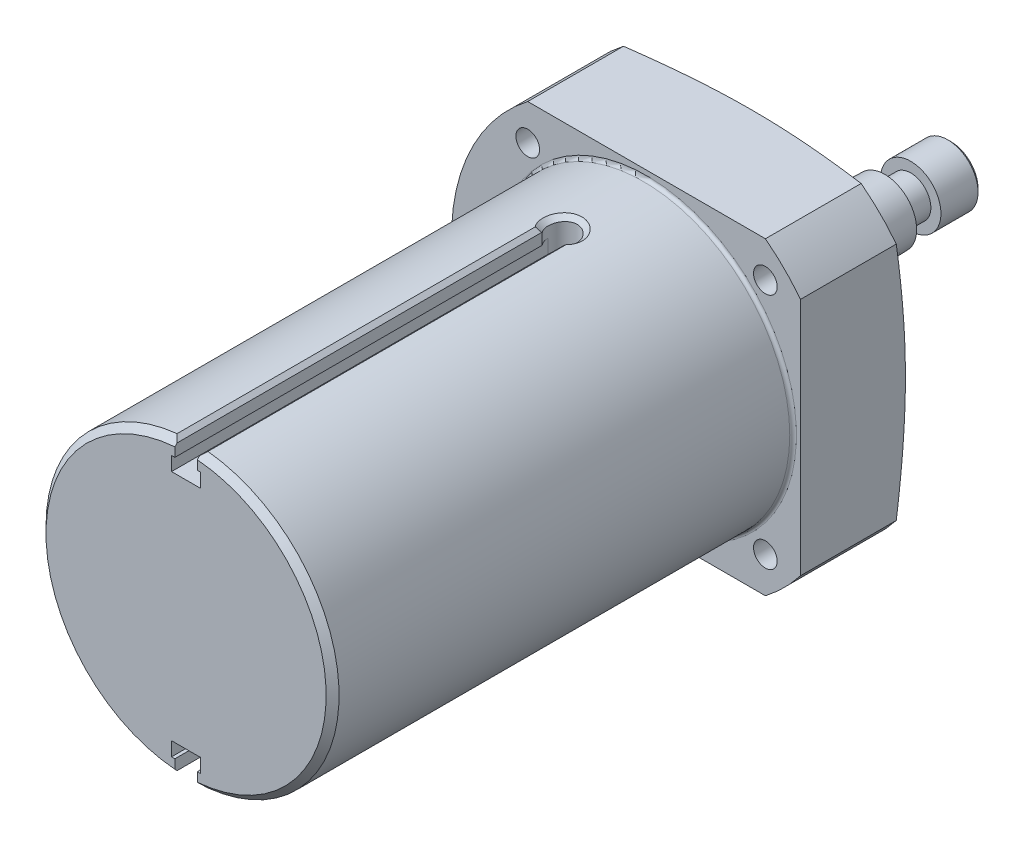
ISO-10303-21;
HEADER;
FILE_DESCRIPTION(('STEP AP214'),'2;1');
FILE_NAME('part.step','',(''),(''),'','','');
FILE_SCHEMA(('AUTOMOTIVE_DESIGN { 1 0 10303 214 1 1 1 1 }'));
ENDSEC;
DATA;
#1=APPLICATION_CONTEXT('core data for automotive mechanical design processes');
#2=APPLICATION_PROTOCOL_DEFINITION('international standard','automotive_design',2000,#1);
#3=PRODUCT_CONTEXT('',#1,'mechanical');
#4=PRODUCT('Part','Part','',(#3));
#5=PRODUCT_RELATED_PRODUCT_CATEGORY('part','',(#4));
#6=PRODUCT_DEFINITION_FORMATION('','',#4);
#7=PRODUCT_DEFINITION_CONTEXT('part definition',#1,'design');
#8=PRODUCT_DEFINITION('design','',#6,#7);
#9=PRODUCT_DEFINITION_SHAPE('','',#8);
#10=(LENGTH_UNIT() NAMED_UNIT(*) SI_UNIT(.MILLI.,.METRE.));
#11=(NAMED_UNIT(*) PLANE_ANGLE_UNIT() SI_UNIT($,.RADIAN.));
#12=(NAMED_UNIT(*) SI_UNIT($,.STERADIAN.) SOLID_ANGLE_UNIT());
#13=UNCERTAINTY_MEASURE_WITH_UNIT(LENGTH_MEASURE(1.E-05),#10,'distance_accuracy_value','');
#14=(GEOMETRIC_REPRESENTATION_CONTEXT(3) GLOBAL_UNCERTAINTY_ASSIGNED_CONTEXT((#13)) GLOBAL_UNIT_ASSIGNED_CONTEXT((#10,
#11,#12)) REPRESENTATION_CONTEXT('',''));
#15=CARTESIAN_POINT('',(0.,0.,0.));
#16=DIRECTION('',(0.,0.,1.));
#17=DIRECTION('',(1.,0.,0.));
#18=AXIS2_PLACEMENT_3D('',#15,#16,#17);
#19=CARTESIAN_POINT('',(7.52475,0.,-26.0128576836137));
#20=DIRECTION('',(0.,0.,1.));
#21=DIRECTION('',(1.,0.,0.));
#22=AXIS2_PLACEMENT_3D('',#19,#20,#21);
#23=PLANE('',#22);
#24=CARTESIAN_POINT('',(0.,0.,-26.0128576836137));
#25=DIRECTION('',(0.,0.,-1.));
#26=DIRECTION('',(-1.,0.,0.));
#27=AXIS2_PLACEMENT_3D('',#24,#25,#26);
#28=CIRCLE('',#27,7.52475);
#29=CARTESIAN_POINT('',(-7.52475,0.,-26.0128576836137));
#30=VERTEX_POINT('',#29);
#31=EDGE_CURVE('E725',#30,#30,#28,.T.);
#32=ORIENTED_EDGE('',*,*,#31,.T.);
#33=EDGE_LOOP('',(#32));
#34=FACE_BOUND('',#33,.T.);
#35=CARTESIAN_POINT('',(0.,0.,-26.0128576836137));
#36=DIRECTION('',(0.,0.,1.));
#37=DIRECTION('',(1.,0.,0.));
#38=AXIS2_PLACEMENT_3D('',#35,#36,#37);
#39=CIRCLE('',#38,4.7625);
#40=CARTESIAN_POINT('',(4.7625,0.,-26.0128576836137));
#41=VERTEX_POINT('',#40);
#42=EDGE_CURVE('E906',#41,#41,#39,.F.);
#43=ORIENTED_EDGE('',*,*,#42,.F.);
#44=EDGE_LOOP('',(#43));
#45=FACE_BOUND('',#44,.T.);
#46=ADVANCED_FACE('F37',(#34,#45),#23,.F.);
#47=CARTESIAN_POINT('',(0.,0.,0.));
#48=DIRECTION('',(0.,0.,1.));
#49=DIRECTION('',(1.,0.,0.));
#50=AXIS2_PLACEMENT_3D('',#47,#48,#49);
#51=PLANE('',#50);
#52=CARTESIAN_POINT('',(0.,0.,0.));
#53=DIRECTION('',(0.,0.,-1.));
#54=DIRECTION('',(-1.,0.,0.));
#55=AXIS2_PLACEMENT_3D('',#52,#53,#54);
#56=CIRCLE('',#55,11.7475);
#57=CARTESIAN_POINT('',(-11.7475,0.,0.));
#58=VERTEX_POINT('',#57);
#59=EDGE_CURVE('E729',#58,#58,#56,.T.);
#60=ORIENTED_EDGE('',*,*,#59,.T.);
#61=EDGE_LOOP('',(#60));
#62=FACE_BOUND('',#61,.T.);
#63=CARTESIAN_POINT('',(0.,0.,0.));
#64=DIRECTION('',(0.,0.,1.));
#65=DIRECTION('',(1.,0.,0.));
#66=AXIS2_PLACEMENT_3D('',#63,#64,#65);
#67=CIRCLE('',#66,7.93115);
#68=CARTESIAN_POINT('',(7.93115,0.,0.));
#69=VERTEX_POINT('',#68);
#70=EDGE_CURVE('E979',#69,#69,#67,.F.);
#71=ORIENTED_EDGE('',*,*,#70,.F.);
#72=EDGE_LOOP('',(#71));
#73=FACE_BOUND('',#72,.T.);
#74=ADVANCED_FACE('F593',(#62,#73),#51,.F.);
#75=CARTESIAN_POINT('',(0.,0.,138.938));
#76=DIRECTION('',(0.,0.,-1.));
#77=DIRECTION('',(-1.,0.,0.));
#78=AXIS2_PLACEMENT_3D('',#75,#76,#77);
#79=CYLINDRICAL_SURFACE('',#78,46.0375);
#80=CARTESIAN_POINT('',(-43.3134518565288,-15.6011632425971,22.3012));
#81=CARTESIAN_POINT('',(-43.313449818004,-15.6011735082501,22.534669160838));
#82=CARTESIAN_POINT('',(-43.3067624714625,-15.6197737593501,22.7682954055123));
#83=CARTESIAN_POINT('',(-43.2800500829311,-15.693634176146,23.2290783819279));
#84=CARTESIAN_POINT('',(-43.2600100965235,-15.7489354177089,23.4562275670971));
#85=CARTESIAN_POINT('',(-43.2067773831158,-15.8943938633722,23.8973163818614));
#86=CARTESIAN_POINT('',(-43.1735923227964,-15.9845307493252,24.1112636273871));
#87=CARTESIAN_POINT('',(-43.0944139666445,-16.1967792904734,24.5200064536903));
#88=CARTESIAN_POINT('',(-43.0484233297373,-16.3188843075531,24.7148059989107));
#89=CARTESIAN_POINT('',(-42.94403377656,-16.5916450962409,25.0803575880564));
#90=CARTESIAN_POINT('',(-42.8856021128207,-16.7423761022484,25.251044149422));
#91=CARTESIAN_POINT('',(-42.7572245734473,-17.0675612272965,25.5629614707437));
#92=CARTESIAN_POINT('',(-42.687278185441,-17.2420164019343,25.7041909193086));
#93=CARTESIAN_POINT('',(-42.5369186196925,-17.6096966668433,25.9534068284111));
#94=CARTESIAN_POINT('',(-42.4564877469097,-17.8029533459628,26.0613360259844));
#95=CARTESIAN_POINT('',(-42.2868572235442,-18.2022005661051,26.2405214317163));
#96=CARTESIAN_POINT('',(-42.1976577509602,-18.4081908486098,26.3117783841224));
#97=CARTESIAN_POINT('',(-42.0128114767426,-18.8262353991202,26.4154064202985));
#98=CARTESIAN_POINT('',(-41.9171831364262,-19.0382713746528,26.4478842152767));
#99=CARTESIAN_POINT('',(-41.7217647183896,-19.462793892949,26.4733620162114));
#100=CARTESIAN_POINT('',(-41.6219747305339,-19.6752804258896,26.4663628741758));
#101=CARTESIAN_POINT('',(-41.4214272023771,-20.0940421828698,26.4131724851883));
#102=CARTESIAN_POINT('',(-41.3206733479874,-20.3003337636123,26.3670959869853));
#103=CARTESIAN_POINT('',(-41.1210744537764,-20.7016642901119,26.2372373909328));
#104=CARTESIAN_POINT('',(-41.0222294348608,-20.8967031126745,26.1534548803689));
#105=CARTESIAN_POINT('',(-40.8296297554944,-21.2705682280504,25.9504354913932));
#106=CARTESIAN_POINT('',(-40.7358826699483,-21.4493706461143,25.83114747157));
#107=CARTESIAN_POINT('',(-40.556969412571,-21.7857750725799,25.5605403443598));
#108=CARTESIAN_POINT('',(-40.4718034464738,-21.9433765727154,25.4092204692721));
#109=CARTESIAN_POINT('',(-40.3129505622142,-22.2338703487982,25.0781988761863));
#110=CARTESIAN_POINT('',(-40.2393058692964,-22.3666720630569,24.8983974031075));
#111=CARTESIAN_POINT('',(-40.1067586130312,-22.6034907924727,24.5158634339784));
#112=CARTESIAN_POINT('',(-40.0478560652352,-22.7075077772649,24.3131309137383));
#113=CARTESIAN_POINT('',(-39.9471895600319,-22.8841394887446,23.8904168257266));
#114=CARTESIAN_POINT('',(-39.9054282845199,-22.9567493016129,23.6704325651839));
#115=CARTESIAN_POINT('',(-39.8408190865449,-23.0686964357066,23.219494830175));
#116=CARTESIAN_POINT('',(-39.8179706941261,-23.1080345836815,22.9885416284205));
#117=CARTESIAN_POINT('',(-39.7922151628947,-23.1523581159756,22.523097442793));
#118=CARTESIAN_POINT('',(-39.7892376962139,-23.1574646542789,22.2886218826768));
#119=CARTESIAN_POINT('',(-39.8031654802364,-23.1335169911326,21.8220199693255));
#120=CARTESIAN_POINT('',(-39.8200705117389,-23.1044631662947,21.5898935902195));
#121=CARTESIAN_POINT('',(-39.8729914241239,-23.0130118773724,21.1349823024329));
#122=CARTESIAN_POINT('',(-39.9089746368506,-22.9506714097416,20.9121821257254));
#123=CARTESIAN_POINT('',(-39.9985195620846,-22.7942517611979,20.4817741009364));
#124=CARTESIAN_POINT('',(-40.0520816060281,-22.7001719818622,20.2741665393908));
#125=CARTESIAN_POINT('',(-40.1747688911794,-22.4823255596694,19.8793995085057));
#126=CARTESIAN_POINT('',(-40.2439372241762,-22.3584766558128,19.6922988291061));
#127=CARTESIAN_POINT('',(-40.3950138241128,-22.0843540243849,19.3444516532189));
#128=CARTESIAN_POINT('',(-40.476922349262,-21.9340797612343,19.1837056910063));
#129=CARTESIAN_POINT('',(-40.6506241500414,-21.610458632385,18.8926526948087));
#130=CARTESIAN_POINT('',(-40.7424457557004,-21.4370452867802,18.7624364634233));
#131=CARTESIAN_POINT('',(-40.9324253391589,-21.0720250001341,18.5367630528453));
#132=CARTESIAN_POINT('',(-41.0305832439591,-20.8804182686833,18.4413054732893));
#133=CARTESIAN_POINT('',(-41.2296930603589,-20.4844529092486,18.2880141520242));
#134=CARTESIAN_POINT('',(-41.3306406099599,-20.2801136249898,18.2301247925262));
#135=CARTESIAN_POINT('',(-41.5321994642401,-19.8640685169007,18.1534315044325));
#136=CARTESIAN_POINT('',(-41.6328107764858,-19.6523628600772,18.1346266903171));
#137=CARTESIAN_POINT('',(-41.8303325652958,-19.2283435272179,18.1366474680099));
#138=CARTESIAN_POINT('',(-41.9272549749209,-19.0160347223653,18.1573317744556));
#139=CARTESIAN_POINT('',(-42.115166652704,-18.596157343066,18.237448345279));
#140=CARTESIAN_POINT('',(-42.2061559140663,-18.388588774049,18.2968806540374));
#141=CARTESIAN_POINT('',(-42.3800195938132,-17.9842656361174,18.4527688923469));
#142=CARTESIAN_POINT('',(-42.4628947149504,-17.7875101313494,18.5492216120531));
#143=CARTESIAN_POINT('',(-42.6188226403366,-17.4106005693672,18.7763971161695));
#144=CARTESIAN_POINT('',(-42.6918755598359,-17.2304463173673,18.9071194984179));
#145=CARTESIAN_POINT('',(-42.8271065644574,-16.8915307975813,19.1996541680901));
#146=CARTESIAN_POINT('',(-42.8892465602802,-16.73284488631,19.3615713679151));
#147=CARTESIAN_POINT('',(-43.0014320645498,-16.4424011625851,19.7117011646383));
#148=CARTESIAN_POINT('',(-43.0514746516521,-16.3106498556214,19.8999200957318));
#149=CARTESIAN_POINT('',(-43.1389131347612,-16.0779697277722,20.2977394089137));
#150=CARTESIAN_POINT('',(-43.1762817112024,-15.977107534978,20.50738472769));
#151=CARTESIAN_POINT('',(-43.2377936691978,-15.8098898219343,20.9416404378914));
#152=CARTESIAN_POINT('',(-43.2619521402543,-15.743494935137,21.1662334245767));
#153=CARTESIAN_POINT('',(-43.290746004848,-15.6640911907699,21.5436418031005));
#154=CARTESIAN_POINT('',(-43.2992560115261,-15.6405280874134,21.6940355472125));
#155=CARTESIAN_POINT('',(-43.3106095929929,-15.6090607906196,21.9966639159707));
#156=CARTESIAN_POINT('',(-43.3134531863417,-15.6011565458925,22.1488985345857));
#157=CARTESIAN_POINT('',(-43.3134518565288,-15.6011632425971,22.3012));
#158=B_SPLINE_CURVE_WITH_KNOTS('',3,(#80,#81,#82,#83,#84,#85,#86,#87,#88,#89,#90,#91,#92,#93,
#94,#95,#96,#97,#98,#99,#100,#101,#102,#103,#104,#105,#106,#107,#108,#109,#110,#111,#112,#113,
#114,#115,#116,#117,#118,#119,#120,#121,#122,#123,#124,#125,#126,#127,#128,#129,#130,#131,#132,
#133,#134,#135,#136,#137,#138,#139,#140,#141,#142,#143,#144,#145,#146,#147,#148,#149,#150,#151,
#152,#153,#154,#155,#156,#157),.UNSPECIFIED.,.T.,.F.,(4,2,2,2,2,2,2,2,2,2,2,2,2,2,2,2,2,2,2,2,2,
2,2,2,2,2,2,2,2,2,2,2,2,2,2,2,2,2,4),(0.,0.699851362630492,1.40048732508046,2.10071525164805,
2.80079789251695,3.50274660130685,4.20472655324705,4.90790698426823,5.61107314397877,
6.31229986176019,7.01351144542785,7.71267105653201,8.41183832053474,9.11201756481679,
9.81221359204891,10.5149185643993,11.2176242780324,11.9204398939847,12.6232380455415,
13.3235475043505,14.0238492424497,14.7229556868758,15.4220753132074,16.1231494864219,
16.8242378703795,17.5273857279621,18.2305254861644,18.932621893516,19.6347023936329,
20.3342756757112,21.0338497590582,21.7333631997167,22.4328684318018,23.1347686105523,
23.8368381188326,24.5404115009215,25.2431795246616,25.6997226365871,26.1562642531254),.UNSPECIFIED.);
#159=CARTESIAN_POINT('',(-43.3134518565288,-15.6011632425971,22.3012));
#160=VERTEX_POINT('',#159);
#161=EDGE_CURVE('E775',#160,#160,#158,.T.);
#162=ORIENTED_EDGE('',*,*,#161,.T.);
#163=EDGE_LOOP('',(#162));
#164=FACE_BOUND('',#163,.T.);
#165=CARTESIAN_POINT('',(-43.3134518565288,15.6011632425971,22.3012));
#166=CARTESIAN_POINT('',(-43.313449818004,15.6011735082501,22.0677308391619));
#167=CARTESIAN_POINT('',(-43.3067624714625,15.6197737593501,21.8341045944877));
#168=CARTESIAN_POINT('',(-43.2800500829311,15.693634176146,21.373321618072));
#169=CARTESIAN_POINT('',(-43.2600100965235,15.7489354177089,21.1461724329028));
#170=CARTESIAN_POINT('',(-43.2067773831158,15.8943938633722,20.7050836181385));
#171=CARTESIAN_POINT('',(-43.1735923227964,15.9845307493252,20.4911363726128));
#172=CARTESIAN_POINT('',(-43.0944139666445,16.1967792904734,20.0823935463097));
#173=CARTESIAN_POINT('',(-43.0484233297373,16.3188843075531,19.8875940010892));
#174=CARTESIAN_POINT('',(-42.94403377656,16.5916450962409,19.5220424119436));
#175=CARTESIAN_POINT('',(-42.8856021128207,16.7423761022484,19.351355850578));
#176=CARTESIAN_POINT('',(-42.7572245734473,17.0675612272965,19.0394385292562));
#177=CARTESIAN_POINT('',(-42.687278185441,17.2420164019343,18.8982090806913));
#178=CARTESIAN_POINT('',(-42.5369186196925,17.6096966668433,18.6489931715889));
#179=CARTESIAN_POINT('',(-42.4564877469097,17.8029533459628,18.5410639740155));
#180=CARTESIAN_POINT('',(-42.2868572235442,18.2022005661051,18.3618785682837));
#181=CARTESIAN_POINT('',(-42.1976577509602,18.4081908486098,18.2906216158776));
#182=CARTESIAN_POINT('',(-42.0128114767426,18.8262353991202,18.1869935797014));
#183=CARTESIAN_POINT('',(-41.9171831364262,19.0382713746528,18.1545157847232));
#184=CARTESIAN_POINT('',(-41.7217647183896,19.462793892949,18.1290379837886));
#185=CARTESIAN_POINT('',(-41.6219747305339,19.6752804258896,18.1360371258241));
#186=CARTESIAN_POINT('',(-41.4214272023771,20.0940421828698,18.1892275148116));
#187=CARTESIAN_POINT('',(-41.3206733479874,20.3003337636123,18.2353040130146));
#188=CARTESIAN_POINT('',(-41.1210744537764,20.7016642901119,18.3651626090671));
#189=CARTESIAN_POINT('',(-41.0222294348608,20.8967031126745,18.4489451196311));
#190=CARTESIAN_POINT('',(-40.8296297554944,21.2705682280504,18.6519645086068));
#191=CARTESIAN_POINT('',(-40.7358826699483,21.4493706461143,18.77125252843));
#192=CARTESIAN_POINT('',(-40.556969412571,21.7857750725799,19.0418596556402));
#193=CARTESIAN_POINT('',(-40.4718034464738,21.9433765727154,19.1931795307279));
#194=CARTESIAN_POINT('',(-40.3129505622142,22.2338703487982,19.5242011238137));
#195=CARTESIAN_POINT('',(-40.2393058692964,22.3666720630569,19.7040025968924));
#196=CARTESIAN_POINT('',(-40.1067586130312,22.6034907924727,20.0865365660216));
#197=CARTESIAN_POINT('',(-40.0478560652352,22.7075077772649,20.2892690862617));
#198=CARTESIAN_POINT('',(-39.9471895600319,22.8841394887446,20.7119831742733));
#199=CARTESIAN_POINT('',(-39.9054282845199,22.9567493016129,20.931967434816));
#200=CARTESIAN_POINT('',(-39.8408190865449,23.0686964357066,21.382905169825));
#201=CARTESIAN_POINT('',(-39.8179706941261,23.1080345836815,21.6138583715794));
#202=CARTESIAN_POINT('',(-39.7922151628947,23.1523581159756,22.079302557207));
#203=CARTESIAN_POINT('',(-39.7892376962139,23.1574646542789,22.3137781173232));
#204=CARTESIAN_POINT('',(-39.8031654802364,23.1335169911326,22.7803800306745));
#205=CARTESIAN_POINT('',(-39.8200705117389,23.1044631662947,23.0125064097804));
#206=CARTESIAN_POINT('',(-39.8729914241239,23.0130118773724,23.467417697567));
#207=CARTESIAN_POINT('',(-39.9089746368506,22.9506714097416,23.6902178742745));
#208=CARTESIAN_POINT('',(-39.9985195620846,22.7942517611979,24.1206258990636));
#209=CARTESIAN_POINT('',(-40.0520816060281,22.7001719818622,24.3282334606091));
#210=CARTESIAN_POINT('',(-40.1747688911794,22.4823255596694,24.7230004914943));
#211=CARTESIAN_POINT('',(-40.2439372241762,22.3584766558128,24.9101011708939));
#212=CARTESIAN_POINT('',(-40.3950138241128,22.0843540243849,25.257948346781));
#213=CARTESIAN_POINT('',(-40.476922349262,21.9340797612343,25.4186943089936));
#214=CARTESIAN_POINT('',(-40.6506241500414,21.610458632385,25.7097473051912));
#215=CARTESIAN_POINT('',(-40.7424457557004,21.4370452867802,25.8399635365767));
#216=CARTESIAN_POINT('',(-40.9324253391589,21.0720250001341,26.0656369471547));
#217=CARTESIAN_POINT('',(-41.0305832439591,20.8804182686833,26.1610945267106));
#218=CARTESIAN_POINT('',(-41.2296930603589,20.4844529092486,26.3143858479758));
#219=CARTESIAN_POINT('',(-41.3306406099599,20.2801136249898,26.3722752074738));
#220=CARTESIAN_POINT('',(-41.5321994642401,19.8640685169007,26.4489684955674));
#221=CARTESIAN_POINT('',(-41.6328107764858,19.6523628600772,26.4677733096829));
#222=CARTESIAN_POINT('',(-41.8303325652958,19.2283435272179,26.4657525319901));
#223=CARTESIAN_POINT('',(-41.9272549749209,19.0160347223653,26.4450682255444));
#224=CARTESIAN_POINT('',(-42.115166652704,18.596157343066,26.364951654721));
#225=CARTESIAN_POINT('',(-42.2061559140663,18.388588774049,26.3055193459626));
#226=CARTESIAN_POINT('',(-42.3800195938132,17.9842656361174,26.1496311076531));
#227=CARTESIAN_POINT('',(-42.4628947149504,17.7875101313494,26.0531783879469));
#228=CARTESIAN_POINT('',(-42.6188226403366,17.4106005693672,25.8260028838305));
#229=CARTESIAN_POINT('',(-42.6918755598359,17.2304463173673,25.6952805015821));
#230=CARTESIAN_POINT('',(-42.8271065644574,16.8915307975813,25.4027458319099));
#231=CARTESIAN_POINT('',(-42.8892465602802,16.73284488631,25.2408286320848));
#232=CARTESIAN_POINT('',(-43.0014320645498,16.4424011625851,24.8906988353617));
#233=CARTESIAN_POINT('',(-43.0514746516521,16.3106498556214,24.7024799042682));
#234=CARTESIAN_POINT('',(-43.1389131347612,16.0779697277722,24.3046605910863));
#235=CARTESIAN_POINT('',(-43.1762817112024,15.977107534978,24.09501527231));
#236=CARTESIAN_POINT('',(-43.2377936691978,15.8098898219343,23.6607595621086));
#237=CARTESIAN_POINT('',(-43.2619521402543,15.743494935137,23.4361665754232));
#238=CARTESIAN_POINT('',(-43.290746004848,15.6640911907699,23.0587581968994));
#239=CARTESIAN_POINT('',(-43.2992560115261,15.6405280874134,22.9083644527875));
#240=CARTESIAN_POINT('',(-43.3106095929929,15.6090607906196,22.6057360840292));
#241=CARTESIAN_POINT('',(-43.3134531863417,15.6011565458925,22.4535014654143));
#242=CARTESIAN_POINT('',(-43.3134518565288,15.6011632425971,22.3012));
#243=B_SPLINE_CURVE_WITH_KNOTS('',3,(#165,#166,#167,#168,#169,#170,#171,#172,#173,#174,#175,
#176,#177,#178,#179,#180,#181,#182,#183,#184,#185,#186,#187,#188,#189,#190,#191,#192,#193,#194,
#195,#196,#197,#198,#199,#200,#201,#202,#203,#204,#205,#206,#207,#208,#209,#210,#211,#212,#213,
#214,#215,#216,#217,#218,#219,#220,#221,#222,#223,#224,#225,#226,#227,#228,#229,#230,#231,#232,
#233,#234,#235,#236,#237,#238,#239,#240,#241,#242),.UNSPECIFIED.,.T.,.F.,(4,2,2,2,2,2,2,2,2,2,2,
2,2,2,2,2,2,2,2,2,2,2,2,2,2,2,2,2,2,2,2,2,2,2,2,2,2,2,4),(0.,0.699851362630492,1.40048732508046,
2.10071525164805,2.80079789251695,3.50274660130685,4.20472655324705,4.90790698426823,
5.61107314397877,6.31229986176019,7.01351144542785,7.71267105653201,8.41183832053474,
9.11201756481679,9.81221359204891,10.5149185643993,11.2176242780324,11.9204398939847,
12.6232380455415,13.3235475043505,14.0238492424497,14.7229556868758,15.4220753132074,
16.1231494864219,16.8242378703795,17.5273857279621,18.2305254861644,18.932621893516,
19.6347023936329,20.3342756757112,21.0338497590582,21.7333631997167,22.4328684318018,
23.1347686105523,23.8368381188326,24.5404115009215,25.2431795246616,25.6997226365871,
26.1562642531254),.UNSPECIFIED.);
#244=CARTESIAN_POINT('',(-43.3134518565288,15.6011632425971,22.3012));
#245=VERTEX_POINT('',#244);
#246=EDGE_CURVE('E771',#245,#245,#243,.T.);
#247=ORIENTED_EDGE('',*,*,#246,.T.);
#248=EDGE_LOOP('',(#247));
#249=FACE_BOUND('',#248,.T.);
#250=DIRECTION('',(0.,0.,-1.));
#251=VECTOR('',#250,1.);
#252=CARTESIAN_POINT('',(-28.0573699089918,36.4998,138.938));
#253=LINE('',#252,#251);
#254=CARTESIAN_POINT('',(-28.0573699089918,36.4998,30.226));
#255=VERTEX_POINT('',#254);
#256=CARTESIAN_POINT('',(-28.0573699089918,36.4998,7.62));
#257=VERTEX_POINT('',#256);
#258=EDGE_CURVE('E1145',#255,#257,#253,.T.);
#259=ORIENTED_EDGE('',*,*,#258,.T.);
#260=CARTESIAN_POINT('',(0.,0.,7.62));
#261=DIRECTION('',(0.,0.,-1.));
#262=DIRECTION('',(-1.,0.,0.));
#263=AXIS2_PLACEMENT_3D('',#260,#261,#262);
#264=CIRCLE('',#263,46.0375);
#265=CARTESIAN_POINT('',(-28.0573699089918,-36.4998,7.62));
#266=VERTEX_POINT('',#265);
#267=EDGE_CURVE('E614',#266,#257,#264,.T.);
#268=ORIENTED_EDGE('',*,*,#267,.F.);
#269=DIRECTION('',(0.,0.,-1.));
#270=VECTOR('',#269,1.);
#271=CARTESIAN_POINT('',(-28.0573699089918,-36.4998,138.938));
#272=LINE('',#271,#270);
#273=CARTESIAN_POINT('',(-28.0573699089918,-36.4998,30.226));
#274=VERTEX_POINT('',#273);
#275=EDGE_CURVE('E1127',#274,#266,#272,.T.);
#276=ORIENTED_EDGE('',*,*,#275,.F.);
#277=CARTESIAN_POINT('',(0.,0.,30.226));
#278=DIRECTION('',(0.,0.,-1.));
#279=DIRECTION('',(-1.,0.,0.));
#280=AXIS2_PLACEMENT_3D('',#277,#278,#279);
#281=CIRCLE('',#280,46.0375);
#282=EDGE_CURVE('E1112',#274,#255,#281,.T.);
#283=ORIENTED_EDGE('',*,*,#282,.T.);
#284=EDGE_LOOP('',(#259,#268,#276,#283));
#285=FACE_BOUND('',#284,.T.);
#286=ADVANCED_FACE('F423',(#164,#249,#285),#79,.T.);
#287=CARTESIAN_POINT('',(-28.0573699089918,-36.4998,138.938));
#288=DIRECTION('',(0.,1.,0.));
#289=DIRECTION('',(0.,0.,1.));
#290=AXIS2_PLACEMENT_3D('',#287,#288,#289);
#291=PLANE('',#290);
#292=ORIENTED_EDGE('',*,*,#275,.T.);
#293=CARTESIAN_POINT('',(-62.7064980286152,-36.4998,13.5129497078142));
#294=CARTESIAN_POINT('',(-61.8342255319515,-36.4998,13.3454271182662));
#295=CARTESIAN_POINT('',(-60.9617903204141,-36.4998,13.1787521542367));
#296=CARTESIAN_POINT('',(-59.2165615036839,-36.4998,12.8472820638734));
#297=CARTESIAN_POINT('',(-58.343767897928,-36.4998,12.6824869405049));
#298=CARTESIAN_POINT('',(-55.7247714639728,-36.4998,12.191192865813));
#299=CARTESIAN_POINT('',(-53.9779856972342,-36.4998,11.8677915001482));
#300=CARTESIAN_POINT('',(-50.4820607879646,-36.4998,11.2310008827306));
#301=CARTESIAN_POINT('',(-48.7329211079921,-36.4998,10.9176145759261));
#302=CARTESIAN_POINT('',(-45.2324516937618,-36.4998,10.3033217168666));
#303=CARTESIAN_POINT('',(-43.4811219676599,-36.4998,10.0024151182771));
#304=CARTESIAN_POINT('',(-39.9842763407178,-36.4998,9.41751580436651));
#305=CARTESIAN_POINT('',(-38.2387729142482,-36.4998,9.13344879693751));
#306=CARTESIAN_POINT('',(-34.7447364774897,-36.4998,8.58447280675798));
#307=CARTESIAN_POINT('',(-32.9962034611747,-36.4998,8.31956386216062));
#308=CARTESIAN_POINT('',(-29.4954143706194,-36.4998,7.81364791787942));
#309=CARTESIAN_POINT('',(-27.7431578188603,-36.4998,7.57264419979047));
#310=CARTESIAN_POINT('',(-24.2347591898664,-36.4998,7.12043772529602));
#311=CARTESIAN_POINT('',(-22.4786170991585,-36.4998,6.90923507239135));
#312=CARTESIAN_POINT('',(-18.9476846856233,-36.4998,6.52187035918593));
#313=CARTESIAN_POINT('',(-17.1728605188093,-36.4998,6.34601352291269));
#314=CARTESIAN_POINT('',(-13.6192668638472,-36.4998,6.03912665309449));
#315=CARTESIAN_POINT('',(-11.8404974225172,-36.4998,5.90809609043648));
#316=CARTESIAN_POINT('',(-9.17057116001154,-36.4998,5.75042852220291));
#317=CARTESIAN_POINT('',(-8.28053867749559,-36.4998,5.70435950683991));
#318=CARTESIAN_POINT('',(-6.49986561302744,-36.4998,5.62583674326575));
#319=CARTESIAN_POINT('',(-5.60922503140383,-36.4998,5.59338298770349));
#320=CARTESIAN_POINT('',(-3.827548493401,-36.4998,5.54262281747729));
#321=CARTESIAN_POINT('',(-2.93651254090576,-36.4998,5.5243162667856));
#322=CARTESIAN_POINT('',(-1.15425970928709,-36.4998,5.5021570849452));
#323=CARTESIAN_POINT('',(-0.263042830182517,-36.4998,5.49830445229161));
#324=CARTESIAN_POINT('',(1.52176392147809,-36.4998,5.50512913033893));
#325=CARTESIAN_POINT('',(2.41535364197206,-36.4998,5.51584606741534));
#326=CARTESIAN_POINT('',(4.20224206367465,-36.4998,5.55169549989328));
#327=CARTESIAN_POINT('',(5.09554076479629,-36.4998,5.57682799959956));
#328=CARTESIAN_POINT('',(6.88164375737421,-36.4998,5.64109085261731));
#329=CARTESIAN_POINT('',(7.77444804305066,-36.4998,5.68022136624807));
#330=CARTESIAN_POINT('',(9.55936087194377,-36.4998,5.77185518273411));
#331=CARTESIAN_POINT('',(10.4514694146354,-36.4998,5.82435849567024));
#332=CARTESIAN_POINT('',(13.1276251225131,-36.4998,6.00085890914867));
#333=CARTESIAN_POINT('',(14.9104526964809,-36.4998,6.14380703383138));
#334=CARTESIAN_POINT('',(17.5815854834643,-36.4998,6.39065294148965));
#335=CARTESIAN_POINT('',(18.4714514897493,-36.4998,6.47833962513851));
#336=CARTESIAN_POINT('',(20.2501654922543,-36.4998,6.6635625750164));
#337=CARTESIAN_POINT('',(21.1390134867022,-36.4998,6.7610988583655));
#338=CARTESIAN_POINT('',(23.105964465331,-36.4998,6.98694369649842));
#339=CARTESIAN_POINT('',(24.1838236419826,-36.4998,7.11736852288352));
#340=CARTESIAN_POINT('',(26.3380830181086,-36.4998,7.38980381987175));
#341=CARTESIAN_POINT('',(27.4144832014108,-36.4998,7.53181441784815));
#342=CARTESIAN_POINT('',(29.5659372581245,-36.4998,7.82599202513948));
#343=CARTESIAN_POINT('',(30.640991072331,-36.4998,7.97815946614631));
#344=CARTESIAN_POINT('',(32.7898096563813,-36.4998,8.29136256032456));
#345=CARTESIAN_POINT('',(33.8635744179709,-36.4998,8.45239826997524));
#346=CARTESIAN_POINT('',(36.0101221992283,-36.4998,8.78223593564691));
#347=CARTESIAN_POINT('',(37.0829049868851,-36.4998,8.95103939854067));
#348=CARTESIAN_POINT('',(39.2273871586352,-36.4998,9.29540238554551));
#349=CARTESIAN_POINT('',(40.2990865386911,-36.4998,9.47096193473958));
#350=CARTESIAN_POINT('',(43.5126587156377,-36.4998,10.0064477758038));
#351=CARTESIAN_POINT('',(45.6530635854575,-36.4998,10.3751902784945));
#352=CARTESIAN_POINT('',(49.9321362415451,-36.4998,11.1309187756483));
#353=CARTESIAN_POINT('',(52.0708018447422,-36.4998,11.5179170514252));
#354=CARTESIAN_POINT('',(56.3455587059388,-36.4998,12.305891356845));
#355=CARTESIAN_POINT('',(58.4816499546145,-36.4998,12.7068674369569));
#356=CARTESIAN_POINT('',(62.7514804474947,-36.4998,13.5197350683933));
#357=CARTESIAN_POINT('',(64.885219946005,-36.4998,13.9316252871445));
#358=CARTESIAN_POINT('',(69.1509927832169,-36.4998,14.7641175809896));
#359=CARTESIAN_POINT('',(71.2830261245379,-36.4998,15.1847196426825));
#360=CARTESIAN_POINT('',(75.5300396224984,-36.4998,16.0298171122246));
#361=CARTESIAN_POINT('',(77.6450299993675,-36.4998,16.4542612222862));
#362=CARTESIAN_POINT('',(81.8738726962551,-36.4998,17.3087788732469));
#363=CARTESIAN_POINT('',(83.9877250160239,-36.4998,17.7388524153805));
#364=CARTESIAN_POINT('',(88.2145549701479,-36.4998,18.6036523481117));
#365=CARTESIAN_POINT('',(90.3275325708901,-36.4998,19.0383789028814));
#366=CARTESIAN_POINT('',(94.5526902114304,-36.4998,19.9116912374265));
#367=CARTESIAN_POINT('',(96.6648702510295,-36.4998,20.3502770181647));
#368=CARTESIAN_POINT('',(100.884566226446,-36.4998,21.2298577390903));
#369=CARTESIAN_POINT('',(102.992083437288,-36.4998,21.6708465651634));
#370=CARTESIAN_POINT('',(107.206543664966,-36.4998,22.5555600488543));
#371=CARTESIAN_POINT('',(109.313486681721,-36.4998,22.9992847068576));
#372=CARTESIAN_POINT('',(113.526784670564,-36.4998,23.8890465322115));
#373=CARTESIAN_POINT('',(115.633139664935,-36.4998,24.3350835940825));
#374=CARTESIAN_POINT('',(119.845420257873,-36.4998,25.2291749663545));
#375=CARTESIAN_POINT('',(121.951345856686,-36.4998,25.6772292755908));
#376=CARTESIAN_POINT('',(124.057089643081,-36.4998,26.1261348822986));
#377=B_SPLINE_CURVE_WITH_KNOTS('',3,(#293,#294,#295,#296,#297,#298,#299,#300,#301,#302,#303,
#304,#305,#306,#307,#308,#309,#310,#311,#312,#313,#314,#315,#316,#317,#318,#319,#320,#321,#322,
#323,#324,#325,#326,#327,#328,#329,#330,#331,#332,#333,#334,#335,#336,#337,#338,#339,#340,#341,
#342,#343,#344,#345,#346,#347,#348,#349,#350,#351,#352,#353,#354,#355,#356,#357,#358,#359,#360,
#361,#362,#363,#364,#365,#366,#367,#368,#369,#370,#371,#372,#373,#374,#375,#376),.UNSPECIFIED.,
.F.,.F.,(4,2,2,2,2,2,2,2,2,2,2,2,2,2,2,2,2,2,2,2,2,2,2,2,2,2,2,2,2,2,2,2,2,2,2,2,2,2,2,2,2,4),
(0.,2.66463955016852,5.32928330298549,10.658670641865,15.989610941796,21.3205314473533,
26.6258489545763,31.9311770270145,37.2372323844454,42.5433061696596,47.8933979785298,
53.2434266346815,55.9170111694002,58.590594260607,61.2641516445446,63.9377087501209,
66.6185519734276,69.2993959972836,71.9802707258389,74.6611474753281,80.0260510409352,
82.7085421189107,85.3910378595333,88.6481301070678,91.9052581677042,95.1625247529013,
98.419812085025,101.677733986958,104.935667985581,111.451359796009,117.971499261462,
124.491662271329,131.011032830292,137.530393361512,144.001862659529,150.473333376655,
156.945033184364,163.41673460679,169.876213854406,176.335694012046,182.794882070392,
189.254066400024),.UNSPECIFIED.);
#378=CARTESIAN_POINT('',(28.0573699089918,-36.4998,7.62));
#379=VERTEX_POINT('',#378);
#380=EDGE_CURVE('E632',#266,#379,#377,.T.);
#381=ORIENTED_EDGE('',*,*,#380,.T.);
#382=DIRECTION('',(0.,0.,-1.));
#383=VECTOR('',#382,1.);
#384=CARTESIAN_POINT('',(28.0573699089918,-36.4998,138.938));
#385=LINE('',#384,#383);
#386=CARTESIAN_POINT('',(28.0573699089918,-36.4998,30.226));
#387=VERTEX_POINT('',#386);
#388=EDGE_CURVE('E1125',#387,#379,#385,.T.);
#389=ORIENTED_EDGE('',*,*,#388,.F.);
#390=DIRECTION('',(-1.,0.,0.));
#391=VECTOR('',#390,1.);
#392=CARTESIAN_POINT('',(-28.0573699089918,-36.4998,30.226));
#393=LINE('',#392,#391);
#394=EDGE_CURVE('E1106',#387,#274,#393,.T.);
#395=ORIENTED_EDGE('',*,*,#394,.T.);
#396=EDGE_LOOP('',(#292,#381,#389,#395));
#397=FACE_BOUND('',#396,.T.);
#398=ADVANCED_FACE('F1158',(#397),#291,.F.);
#399=CARTESIAN_POINT('',(0.,0.,138.938));
#400=DIRECTION('',(0.,0.,-1.));
#401=DIRECTION('',(-1.,0.,0.));
#402=AXIS2_PLACEMENT_3D('',#399,#400,#401);
#403=CYLINDRICAL_SURFACE('',#402,46.0375);
#404=ORIENTED_EDGE('',*,*,#388,.T.);
#405=CARTESIAN_POINT('',(36.3474,-28.2545203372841,7.62));
#406=VERTEX_POINT('',#405);
#407=EDGE_CURVE('E1124',#406,#379,#264,.T.);
#408=ORIENTED_EDGE('',*,*,#407,.F.);
#409=DIRECTION('',(0.,0.,-1.));
#410=VECTOR('',#409,1.);
#411=CARTESIAN_POINT('',(36.3474,-28.2545203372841,138.938));
#412=LINE('',#411,#410);
#413=CARTESIAN_POINT('',(36.3474,-28.2545203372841,30.226));
#414=VERTEX_POINT('',#413);
#415=EDGE_CURVE('E1118',#414,#406,#412,.T.);
#416=ORIENTED_EDGE('',*,*,#415,.F.);
#417=EDGE_CURVE('E1101',#414,#387,#281,.T.);
#418=ORIENTED_EDGE('',*,*,#417,.T.);
#419=EDGE_LOOP('',(#404,#408,#416,#418));
#420=FACE_BOUND('',#419,.T.);
#421=ADVANCED_FACE('F1123',(#420),#403,.T.);
#422=CARTESIAN_POINT('',(36.3474,28.2545203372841,138.938));
#423=DIRECTION('',(-1.,0.,0.));
#424=DIRECTION('',(0.,0.,1.));
#425=AXIS2_PLACEMENT_3D('',#422,#423,#424);
#426=PLANE('',#425);
#427=ORIENTED_EDGE('',*,*,#415,.T.);
#428=CARTESIAN_POINT('',(36.3474,-62.7890499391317,13.5118133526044));
#429=CARTESIAN_POINT('',(36.3474,-61.9180897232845,13.3443107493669));
#430=CARTESIAN_POINT('',(36.3474,-61.0469683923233,13.1776462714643));
#431=CARTESIAN_POINT('',(36.3474,-59.3043708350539,12.8461760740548));
#432=CARTESIAN_POINT('',(36.3474,-58.4328946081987,12.6813703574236));
#433=CARTESIAN_POINT('',(36.3474,-55.8178565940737,12.1900098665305));
#434=CARTESIAN_POINT('',(36.3474,-54.07371747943,11.8665179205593));
#435=CARTESIAN_POINT('',(36.3474,-50.5831331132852,11.2294384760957));
#436=CARTESIAN_POINT('',(36.3474,-48.8366873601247,10.9158537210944));
#437=CARTESIAN_POINT('',(36.3474,-45.3416248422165,10.3010254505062));
#438=CARTESIAN_POINT('',(36.3474,-43.5930080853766,9.99978189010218));
#439=CARTESIAN_POINT('',(36.3474,-40.1015276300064,9.41403074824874));
#440=CARTESIAN_POINT('',(36.3474,-38.3586762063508,9.12945027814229));
#441=CARTESIAN_POINT('',(36.3474,-34.8699641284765,8.57924853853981));
#442=CARTESIAN_POINT('',(36.3474,-33.1241034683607,8.31362730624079));
#443=CARTESIAN_POINT('',(36.3474,-29.6286591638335,7.80605097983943));
#444=CARTESIAN_POINT('',(36.3474,-27.8790750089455,7.56409937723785));
#445=CARTESIAN_POINT('',(36.3474,-24.3760310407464,7.10973589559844));
#446=CARTESIAN_POINT('',(36.3474,-22.622571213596,6.89732412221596));
#447=CARTESIAN_POINT('',(36.3474,-19.0969889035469,6.50725457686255));
#448=CARTESIAN_POINT('',(36.3474,-17.324832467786,6.3299004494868));
#449=CARTESIAN_POINT('',(36.3474,-13.7765486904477,6.01976925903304));
#450=CARTESIAN_POINT('',(36.3474,-12.0004213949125,5.88699168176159));
#451=CARTESIAN_POINT('',(36.3474,-9.33443137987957,5.72657631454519));
#452=CARTESIAN_POINT('',(36.3474,-8.44571128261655,5.67957058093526));
#453=CARTESIAN_POINT('',(36.3474,-6.66764880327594,5.5991463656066));
#454=CARTESIAN_POINT('',(36.3474,-5.77830642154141,5.56572787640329));
#455=CARTESIAN_POINT('',(36.3474,-3.99921088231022,5.51302663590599));
#456=CARTESIAN_POINT('',(36.3474,-3.10945772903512,5.49374374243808));
#457=CARTESIAN_POINT('',(36.3474,-1.3297542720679,5.46963787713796));
#458=CARTESIAN_POINT('',(36.3474,-0.439803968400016,5.46481490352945));
#459=CARTESIAN_POINT('',(36.3474,1.34248471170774,5.46971936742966));
#460=CARTESIAN_POINT('',(36.3474,2.23482297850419,5.47948654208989));
#461=CARTESIAN_POINT('',(36.3474,4.01922244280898,5.51347492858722));
#462=CARTESIAN_POINT('',(36.3474,4.91128364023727,5.53769614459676));
#463=CARTESIAN_POINT('',(36.3474,6.69492312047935,5.60018692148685));
#464=CARTESIAN_POINT('',(36.3474,7.58650139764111,5.63845664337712));
#465=CARTESIAN_POINT('',(36.3474,9.36897073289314,5.72842728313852));
#466=CARTESIAN_POINT('',(36.3474,10.2598617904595,5.78012821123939));
#467=CARTESIAN_POINT('',(36.3474,12.9323856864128,5.95431631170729));
#468=CARTESIAN_POINT('',(36.3474,14.7128078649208,6.09584992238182));
#469=CARTESIAN_POINT('',(36.3474,17.3803337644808,6.34075971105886));
#470=CARTESIAN_POINT('',(36.3474,18.2689977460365,6.42783196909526));
#471=CARTESIAN_POINT('',(36.3474,20.045306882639,6.61188308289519));
#472=CARTESIAN_POINT('',(36.3474,20.9329520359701,6.70886195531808));
#473=CARTESIAN_POINT('',(36.3474,22.9059787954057,6.93452966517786));
#474=CARTESIAN_POINT('',(36.3474,23.9911037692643,7.06545487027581));
#475=CARTESIAN_POINT('',(36.3474,26.1598674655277,7.33913380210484));
#476=CARTESIAN_POINT('',(36.3474,27.2435061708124,7.48188766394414));
#477=CARTESIAN_POINT('',(36.3474,29.4094187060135,7.77775140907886));
#478=CARTESIAN_POINT('',(36.3474,30.4916924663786,7.93086179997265));
#479=CARTESIAN_POINT('',(36.3474,32.6549172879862,8.24610969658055));
#480=CARTESIAN_POINT('',(36.3474,33.7358683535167,8.40824717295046));
#481=CARTESIAN_POINT('',(36.3474,35.896782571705,8.74041852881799));
#482=CARTESIAN_POINT('',(36.3474,36.9767454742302,8.91045403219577));
#483=CARTESIAN_POINT('',(36.3474,39.1355707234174,9.25738299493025));
#484=CARTESIAN_POINT('',(36.3474,40.2144330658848,9.43427648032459));
#485=CARTESIAN_POINT('',(36.3474,43.4494702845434,9.97388306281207));
#486=CARTESIAN_POINT('',(36.3474,45.6041558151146,10.3455316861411));
#487=CARTESIAN_POINT('',(36.3474,49.9118168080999,11.1072774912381));
#488=CARTESIAN_POINT('',(36.3474,52.0647899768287,11.4973875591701));
#489=CARTESIAN_POINT('',(36.3474,56.3681371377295,12.2917027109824));
#490=CARTESIAN_POINT('',(36.3474,58.518511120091,12.6959078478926));
#491=CARTESIAN_POINT('',(36.3474,62.8168803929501,13.5153000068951));
#492=CARTESIAN_POINT('',(36.3474,64.9648759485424,13.9304856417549));
#493=CARTESIAN_POINT('',(36.3474,69.2591510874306,14.7696070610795));
#494=CARTESIAN_POINT('',(36.3474,71.4054306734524,15.1935428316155));
#495=CARTESIAN_POINT('',(36.3474,75.6809087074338,16.0453191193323));
#496=CARTESIAN_POINT('',(36.3474,77.8101173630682,16.4731084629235));
#497=CARTESIAN_POINT('',(36.3474,82.0673937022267,17.3343248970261));
#498=CARTESIAN_POINT('',(36.3474,84.1954613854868,17.7677519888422));
#499=CARTESIAN_POINT('',(36.3474,88.4507241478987,18.6392608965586));
#500=CARTESIAN_POINT('',(36.3474,90.5779191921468,19.0773428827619));
#501=CARTESIAN_POINT('',(36.3474,94.831511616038,19.9573629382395));
#502=CARTESIAN_POINT('',(36.3474,96.9579089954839,20.3993010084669));
#503=CARTESIAN_POINT('',(36.3474,101.205913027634,21.285553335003));
#504=CARTESIAN_POINT('',(36.3474,103.32752098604,21.7298613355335));
#505=CARTESIAN_POINT('',(36.3474,107.57016379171,22.6212058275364));
#506=CARTESIAN_POINT('',(36.3474,109.691198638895,23.0682423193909));
#507=CARTESIAN_POINT('',(36.3474,113.93267834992,23.9646190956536));
#508=CARTESIAN_POINT('',(36.3474,116.053123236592,24.4139592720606));
#509=CARTESIAN_POINT('',(36.3474,120.29358506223,25.3146487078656));
#510=CARTESIAN_POINT('',(36.3474,122.413602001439,25.7659979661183));
#511=CARTESIAN_POINT('',(36.3474,124.533437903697,26.2181943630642));
#512=B_SPLINE_CURVE_WITH_KNOTS('',3,(#428,#429,#430,#431,#432,#433,#434,#435,#436,#437,#438,
#439,#440,#441,#442,#443,#444,#445,#446,#447,#448,#449,#450,#451,#452,#453,#454,#455,#456,#457,
#458,#459,#460,#461,#462,#463,#464,#465,#466,#467,#468,#469,#470,#471,#472,#473,#474,#475,#476,
#477,#478,#479,#480,#481,#482,#483,#484,#485,#486,#487,#488,#489,#490,#491,#492,#493,#494,#495,
#496,#497,#498,#499,#500,#501,#502,#503,#504,#505,#506,#507,#508,#509,#510,#511),.UNSPECIFIED.,
.F.,.F.,(4,2,2,2,2,2,2,2,2,2,2,2,2,2,2,2,2,2,2,2,2,2,2,2,2,2,2,2,2,2,2,2,2,2,2,2,2,2,2,2,2,4),
(0.,2.66076215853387,5.32152843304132,10.6431587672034,15.9662500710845,21.2893220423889,
26.5870366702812,31.8847616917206,37.1832670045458,42.4817912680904,47.824369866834,
53.1668868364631,55.8366866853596,58.5064850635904,61.1762565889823,63.8460277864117,
66.5230835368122,69.2001400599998,71.8772272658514,74.5543165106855,79.9116800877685,
82.5904015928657,85.269127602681,88.5480371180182,91.8269840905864,95.1060918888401,
98.3851890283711,101.664963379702,104.944750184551,111.504140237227,118.068178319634,
124.632241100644,131.195478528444,137.758705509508,144.27397062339,150.789237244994,
157.304743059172,163.820250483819,170.323145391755,176.826041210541,183.328634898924,
189.831224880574),.UNSPECIFIED.);
#513=CARTESIAN_POINT('',(36.3474,28.2545203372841,7.62));
#514=VERTEX_POINT('',#513);
#515=EDGE_CURVE('E612',#406,#514,#512,.T.);
#516=ORIENTED_EDGE('',*,*,#515,.T.);
#517=DIRECTION('',(0.,0.,-1.));
#518=VECTOR('',#517,1.);
#519=CARTESIAN_POINT('',(36.3474,28.2545203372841,138.938));
#520=LINE('',#519,#518);
#521=CARTESIAN_POINT('',(36.3474,28.2545203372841,30.226));
#522=VERTEX_POINT('',#521);
#523=EDGE_CURVE('E1120',#522,#514,#520,.T.);
#524=ORIENTED_EDGE('',*,*,#523,.F.);
#525=DIRECTION('',(0.,-1.,0.));
#526=VECTOR('',#525,1.);
#527=CARTESIAN_POINT('',(36.3474,28.2545203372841,30.226));
#528=LINE('',#527,#526);
#529=EDGE_CURVE('E1103',#522,#414,#528,.T.);
#530=ORIENTED_EDGE('',*,*,#529,.T.);
#531=EDGE_LOOP('',(#427,#516,#524,#530));
#532=FACE_BOUND('',#531,.T.);
#533=ADVANCED_FACE('F1116',(#532),#426,.F.);
#534=CARTESIAN_POINT('',(0.,0.,138.938));
#535=DIRECTION('',(0.,0.,-1.));
#536=DIRECTION('',(-1.,0.,0.));
#537=AXIS2_PLACEMENT_3D('',#534,#535,#536);
#538=CYLINDRICAL_SURFACE('',#537,46.0375);
#539=ORIENTED_EDGE('',*,*,#523,.T.);
#540=CARTESIAN_POINT('',(28.0573699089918,36.4998,7.62));
#541=VERTEX_POINT('',#540);
#542=EDGE_CURVE('E613',#541,#514,#264,.T.);
#543=ORIENTED_EDGE('',*,*,#542,.F.);
#544=DIRECTION('',(0.,0.,-1.));
#545=VECTOR('',#544,1.);
#546=CARTESIAN_POINT('',(28.0573699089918,36.4998,138.938));
#547=LINE('',#546,#545);
#548=CARTESIAN_POINT('',(28.0573699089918,36.4998,30.226));
#549=VERTEX_POINT('',#548);
#550=EDGE_CURVE('E1129',#549,#541,#547,.T.);
#551=ORIENTED_EDGE('',*,*,#550,.F.);
#552=EDGE_CURVE('E1111',#549,#522,#281,.T.);
#553=ORIENTED_EDGE('',*,*,#552,.T.);
#554=EDGE_LOOP('',(#539,#543,#551,#553));
#555=FACE_BOUND('',#554,.T.);
#556=ADVANCED_FACE('F601',(#555),#538,.T.);
#557=CARTESIAN_POINT('',(-28.0573699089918,36.4998,138.938));
#558=DIRECTION('',(0.,-1.,0.));
#559=DIRECTION('',(0.,0.,-1.));
#560=AXIS2_PLACEMENT_3D('',#557,#558,#559);
#561=PLANE('',#560);
#562=ORIENTED_EDGE('',*,*,#550,.T.);
#563=CARTESIAN_POINT('',(-62.7064980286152,36.4998,13.5129497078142));
#564=CARTESIAN_POINT('',(-61.8342255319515,36.4998,13.3454271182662));
#565=CARTESIAN_POINT('',(-60.9617903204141,36.4998,13.1787521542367));
#566=CARTESIAN_POINT('',(-59.2165615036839,36.4998,12.8472820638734));
#567=CARTESIAN_POINT('',(-58.343767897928,36.4998,12.6824869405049));
#568=CARTESIAN_POINT('',(-55.7247714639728,36.4998,12.191192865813));
#569=CARTESIAN_POINT('',(-53.9779856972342,36.4998,11.8677915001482));
#570=CARTESIAN_POINT('',(-50.4820607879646,36.4998,11.2310008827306));
#571=CARTESIAN_POINT('',(-48.7329211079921,36.4998,10.9176145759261));
#572=CARTESIAN_POINT('',(-45.2324516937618,36.4998,10.3033217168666));
#573=CARTESIAN_POINT('',(-43.4811219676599,36.4998,10.0024151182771));
#574=CARTESIAN_POINT('',(-39.9842763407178,36.4998,9.41751580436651));
#575=CARTESIAN_POINT('',(-38.2387729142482,36.4998,9.13344879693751));
#576=CARTESIAN_POINT('',(-34.7447364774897,36.4998,8.58447280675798));
#577=CARTESIAN_POINT('',(-32.9962034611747,36.4998,8.31956386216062));
#578=CARTESIAN_POINT('',(-29.4954143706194,36.4998,7.81364791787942));
#579=CARTESIAN_POINT('',(-27.7431578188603,36.4998,7.57264419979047));
#580=CARTESIAN_POINT('',(-24.2347591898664,36.4998,7.12043772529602));
#581=CARTESIAN_POINT('',(-22.4786170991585,36.4998,6.90923507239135));
#582=CARTESIAN_POINT('',(-18.9476846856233,36.4998,6.52187035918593));
#583=CARTESIAN_POINT('',(-17.1728605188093,36.4998,6.34601352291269));
#584=CARTESIAN_POINT('',(-13.6192668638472,36.4998,6.03912665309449));
#585=CARTESIAN_POINT('',(-11.8404974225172,36.4998,5.90809609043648));
#586=CARTESIAN_POINT('',(-9.17057116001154,36.4998,5.75042852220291));
#587=CARTESIAN_POINT('',(-8.28053867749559,36.4998,5.70435950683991));
#588=CARTESIAN_POINT('',(-6.49986561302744,36.4998,5.62583674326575));
#589=CARTESIAN_POINT('',(-5.60922503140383,36.4998,5.59338298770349));
#590=CARTESIAN_POINT('',(-3.827548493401,36.4998,5.54262281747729));
#591=CARTESIAN_POINT('',(-2.93651254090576,36.4998,5.5243162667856));
#592=CARTESIAN_POINT('',(-1.15425970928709,36.4998,5.5021570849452));
#593=CARTESIAN_POINT('',(-0.263042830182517,36.4998,5.49830445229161));
#594=CARTESIAN_POINT('',(1.52176392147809,36.4998,5.50512913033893));
#595=CARTESIAN_POINT('',(2.41535364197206,36.4998,5.51584606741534));
#596=CARTESIAN_POINT('',(4.20224206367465,36.4998,5.55169549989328));
#597=CARTESIAN_POINT('',(5.09554076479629,36.4998,5.57682799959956));
#598=CARTESIAN_POINT('',(6.88164375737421,36.4998,5.64109085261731));
#599=CARTESIAN_POINT('',(7.77444804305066,36.4998,5.68022136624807));
#600=CARTESIAN_POINT('',(9.55936087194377,36.4998,5.77185518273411));
#601=CARTESIAN_POINT('',(10.4514694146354,36.4998,5.82435849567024));
#602=CARTESIAN_POINT('',(13.1276251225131,36.4998,6.00085890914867));
#603=CARTESIAN_POINT('',(14.9104526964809,36.4998,6.14380703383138));
#604=CARTESIAN_POINT('',(17.5815854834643,36.4998,6.39065294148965));
#605=CARTESIAN_POINT('',(18.4714514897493,36.4998,6.47833962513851));
#606=CARTESIAN_POINT('',(20.2501654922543,36.4998,6.6635625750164));
#607=CARTESIAN_POINT('',(21.1390134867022,36.4998,6.7610988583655));
#608=CARTESIAN_POINT('',(23.105964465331,36.4998,6.98694369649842));
#609=CARTESIAN_POINT('',(24.1838236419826,36.4998,7.11736852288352));
#610=CARTESIAN_POINT('',(26.3380830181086,36.4998,7.38980381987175));
#611=CARTESIAN_POINT('',(27.4144832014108,36.4998,7.53181441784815));
#612=CARTESIAN_POINT('',(29.5659372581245,36.4998,7.82599202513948));
#613=CARTESIAN_POINT('',(30.640991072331,36.4998,7.97815946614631));
#614=CARTESIAN_POINT('',(32.7898096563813,36.4998,8.29136256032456));
#615=CARTESIAN_POINT('',(33.8635744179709,36.4998,8.45239826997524));
#616=CARTESIAN_POINT('',(36.0101221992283,36.4998,8.78223593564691));
#617=CARTESIAN_POINT('',(37.0829049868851,36.4998,8.95103939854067));
#618=CARTESIAN_POINT('',(39.2273871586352,36.4998,9.29540238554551));
#619=CARTESIAN_POINT('',(40.2990865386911,36.4998,9.47096193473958));
#620=CARTESIAN_POINT('',(43.5126587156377,36.4998,10.0064477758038));
#621=CARTESIAN_POINT('',(45.6530635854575,36.4998,10.3751902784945));
#622=CARTESIAN_POINT('',(49.9321362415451,36.4998,11.1309187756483));
#623=CARTESIAN_POINT('',(52.0708018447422,36.4998,11.5179170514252));
#624=CARTESIAN_POINT('',(56.3455587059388,36.4998,12.305891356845));
#625=CARTESIAN_POINT('',(58.4816499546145,36.4998,12.7068674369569));
#626=CARTESIAN_POINT('',(62.7514804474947,36.4998,13.5197350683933));
#627=CARTESIAN_POINT('',(64.885219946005,36.4998,13.9316252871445));
#628=CARTESIAN_POINT('',(69.1509927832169,36.4998,14.7641175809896));
#629=CARTESIAN_POINT('',(71.2830261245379,36.4998,15.1847196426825));
#630=CARTESIAN_POINT('',(75.5300396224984,36.4998,16.0298171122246));
#631=CARTESIAN_POINT('',(77.6450299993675,36.4998,16.4542612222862));
#632=CARTESIAN_POINT('',(81.8738726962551,36.4998,17.3087788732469));
#633=CARTESIAN_POINT('',(83.9877250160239,36.4998,17.7388524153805));
#634=CARTESIAN_POINT('',(88.2145549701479,36.4998,18.6036523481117));
#635=CARTESIAN_POINT('',(90.3275325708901,36.4998,19.0383789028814));
#636=CARTESIAN_POINT('',(94.5526902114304,36.4998,19.9116912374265));
#637=CARTESIAN_POINT('',(96.6648702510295,36.4998,20.3502770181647));
#638=CARTESIAN_POINT('',(100.884566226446,36.4998,21.2298577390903));
#639=CARTESIAN_POINT('',(102.992083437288,36.4998,21.6708465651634));
#640=CARTESIAN_POINT('',(107.206543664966,36.4998,22.5555600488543));
#641=CARTESIAN_POINT('',(109.313486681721,36.4998,22.9992847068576));
#642=CARTESIAN_POINT('',(113.526784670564,36.4998,23.8890465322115));
#643=CARTESIAN_POINT('',(115.633139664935,36.4998,24.3350835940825));
#644=CARTESIAN_POINT('',(119.845420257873,36.4998,25.2291749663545));
#645=CARTESIAN_POINT('',(121.951345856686,36.4998,25.6772292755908));
#646=CARTESIAN_POINT('',(124.057089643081,36.4998,26.1261348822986));
#647=B_SPLINE_CURVE_WITH_KNOTS('',3,(#563,#564,#565,#566,#567,#568,#569,#570,#571,#572,#573,
#574,#575,#576,#577,#578,#579,#580,#581,#582,#583,#584,#585,#586,#587,#588,#589,#590,#591,#592,
#593,#594,#595,#596,#597,#598,#599,#600,#601,#602,#603,#604,#605,#606,#607,#608,#609,#610,#611,
#612,#613,#614,#615,#616,#617,#618,#619,#620,#621,#622,#623,#624,#625,#626,#627,#628,#629,#630,
#631,#632,#633,#634,#635,#636,#637,#638,#639,#640,#641,#642,#643,#644,#645,#646),.UNSPECIFIED.,
.F.,.F.,(4,2,2,2,2,2,2,2,2,2,2,2,2,2,2,2,2,2,2,2,2,2,2,2,2,2,2,2,2,2,2,2,2,2,2,2,2,2,2,2,2,4),
(0.,2.66463955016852,5.32928330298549,10.658670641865,15.989610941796,21.3205314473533,
26.6258489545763,31.9311770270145,37.2372323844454,42.5433061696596,47.8933979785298,
53.2434266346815,55.9170111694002,58.590594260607,61.2641516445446,63.9377087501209,
66.6185519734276,69.2993959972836,71.9802707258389,74.6611474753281,80.0260510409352,
82.7085421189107,85.3910378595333,88.6481301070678,91.9052581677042,95.1625247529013,
98.419812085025,101.677733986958,104.935667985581,111.451359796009,117.971499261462,
124.491662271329,131.011032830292,137.530393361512,144.001862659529,150.473333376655,
156.945033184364,163.41673460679,169.876213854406,176.335694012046,182.794882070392,
189.254066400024),.UNSPECIFIED.);
#648=EDGE_CURVE('E605',#541,#257,#647,.F.);
#649=ORIENTED_EDGE('',*,*,#648,.T.);
#650=ORIENTED_EDGE('',*,*,#258,.F.);
#651=DIRECTION('',(1.,0.,0.));
#652=VECTOR('',#651,1.);
#653=CARTESIAN_POINT('',(-28.0573699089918,36.4998,30.226));
#654=LINE('',#653,#652);
#655=EDGE_CURVE('E1135',#255,#549,#654,.T.);
#656=ORIENTED_EDGE('',*,*,#655,.T.);
#657=EDGE_LOOP('',(#562,#649,#650,#656));
#658=FACE_BOUND('',#657,.T.);
#659=ADVANCED_FACE('F597',(#658),#561,.F.);
#660=CARTESIAN_POINT('',(-46.0375,0.,30.226));
#661=DIRECTION('',(0.,0.,-1.));
#662=DIRECTION('',(-1.,0.,0.));
#663=AXIS2_PLACEMENT_3D('',#660,#661,#662);
#664=PLANE('',#663);
#665=CARTESIAN_POINT('',(0.,0.,30.226));
#666=DIRECTION('',(0.,0.,-1.));
#667=DIRECTION('',(-1.,0.,0.));
#668=AXIS2_PLACEMENT_3D('',#665,#666,#667);
#669=CIRCLE('',#668,35.3822);
#670=CARTESIAN_POINT('',(-35.3822,0.,30.226));
#671=VERTEX_POINT('',#670);
#672=EDGE_CURVE('E889',#671,#671,#669,.T.);
#673=ORIENTED_EDGE('',*,*,#672,.T.);
#674=EDGE_LOOP('',(#673));
#675=FACE_BOUND('',#674,.T.);
#676=CARTESIAN_POINT('',(-28.0453398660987,28.0453398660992,30.226));
#677=DIRECTION('',(0.,0.,-1.));
#678=DIRECTION('',(-1.,0.,0.));
#679=AXIS2_PLACEMENT_3D('',#676,#677,#678);
#680=CIRCLE('',#679,2.79400000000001);
#681=CARTESIAN_POINT('',(-30.8393398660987,28.0453398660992,30.226));
#682=VERTEX_POINT('',#681);
#683=EDGE_CURVE('E762',#682,#682,#680,.T.);
#684=ORIENTED_EDGE('',*,*,#683,.T.);
#685=EDGE_LOOP('',(#684));
#686=FACE_BOUND('',#685,.T.);
#687=CARTESIAN_POINT('',(-28.0453398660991,-28.0453398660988,30.226));
#688=DIRECTION('',(0.,0.,-1.));
#689=DIRECTION('',(-1.,0.,0.));
#690=AXIS2_PLACEMENT_3D('',#687,#688,#689);
#691=CIRCLE('',#690,2.79400000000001);
#692=CARTESIAN_POINT('',(-30.8393398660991,-28.0453398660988,30.226));
#693=VERTEX_POINT('',#692);
#694=EDGE_CURVE('E656',#693,#693,#691,.T.);
#695=ORIENTED_EDGE('',*,*,#694,.T.);
#696=EDGE_LOOP('',(#695));
#697=FACE_BOUND('',#696,.T.);
#698=CARTESIAN_POINT('',(28.0453398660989,-28.045339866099,30.226));
#699=DIRECTION('',(0.,0.,-1.));
#700=DIRECTION('',(-1.,0.,0.));
#701=AXIS2_PLACEMENT_3D('',#698,#699,#700);
#702=CIRCLE('',#701,2.79400000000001);
#703=CARTESIAN_POINT('',(25.2513398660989,-28.045339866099,30.226));
#704=VERTEX_POINT('',#703);
#705=EDGE_CURVE('E746',#704,#704,#702,.T.);
#706=ORIENTED_EDGE('',*,*,#705,.T.);
#707=EDGE_LOOP('',(#706));
#708=FACE_BOUND('',#707,.T.);
#709=CARTESIAN_POINT('',(28.0453398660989,28.045339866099,30.226));
#710=DIRECTION('',(0.,0.,-1.));
#711=DIRECTION('',(-1.,0.,0.));
#712=AXIS2_PLACEMENT_3D('',#709,#710,#711);
#713=CIRCLE('',#712,2.79400000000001);
#714=CARTESIAN_POINT('',(25.2513398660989,28.045339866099,30.226));
#715=VERTEX_POINT('',#714);
#716=EDGE_CURVE('E737',#715,#715,#713,.T.);
#717=ORIENTED_EDGE('',*,*,#716,.T.);
#718=EDGE_LOOP('',(#717));
#719=FACE_BOUND('',#718,.T.);
#720=ORIENTED_EDGE('',*,*,#417,.F.);
#721=ORIENTED_EDGE('',*,*,#529,.F.);
#722=ORIENTED_EDGE('',*,*,#552,.F.);
#723=ORIENTED_EDGE('',*,*,#655,.F.);
#724=ORIENTED_EDGE('',*,*,#282,.F.);
#725=ORIENTED_EDGE('',*,*,#394,.F.);
#726=EDGE_LOOP('',(#720,#721,#722,#723,#724,#725));
#727=FACE_BOUND('',#726,.T.);
#728=ADVANCED_FACE('F585',(#675,#686,#697,#708,#719,#727),#664,.F.);
#729=CARTESIAN_POINT('',(0.,0.,0.));
#730=DIRECTION('',(0.,0.,-1.));
#731=DIRECTION('',(-1.,0.,0.));
#732=AXIS2_PLACEMENT_3D('',#729,#730,#731);
#733=CYLINDRICAL_SURFACE('',#732,34.5948);
#734=CARTESIAN_POINT('',(0.,0.,31.0134));
#735=DIRECTION('',(0.,0.,-1.));
#736=DIRECTION('',(-1.,0.,0.));
#737=AXIS2_PLACEMENT_3D('',#734,#735,#736);
#738=CIRCLE('',#737,34.5948);
#739=CARTESIAN_POINT('',(-34.5948,0.,31.0134));
#740=VERTEX_POINT('',#739);
#741=EDGE_CURVE('E892',#740,#740,#738,.F.);
#742=ORIENTED_EDGE('',*,*,#741,.T.);
#743=EDGE_LOOP('',(#742));
#744=FACE_BOUND('',#743,.T.);
#745=CARTESIAN_POINT('',(0.,0.,137.414));
#746=DIRECTION('',(0.,0.,1.));
#747=DIRECTION('',(1.,0.,0.));
#748=AXIS2_PLACEMENT_3D('',#745,#746,#747);
#749=CIRCLE('',#748,34.5948);
#750=CARTESIAN_POINT('',(3.64154609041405,34.4026064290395,137.414));
#751=VERTEX_POINT('',#750);
#752=CARTESIAN_POINT('',(3.64154609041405,-34.4026064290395,137.414));
#753=VERTEX_POINT('',#752);
#754=EDGE_CURVE('E898',#751,#753,#749,.F.);
#755=ORIENTED_EDGE('',*,*,#754,.T.);
#756=DIRECTION('',(0.,0.,-1.));
#757=VECTOR('',#756,1.);
#758=CARTESIAN_POINT('',(3.64154609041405,-34.4026064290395,0.));
#759=LINE('',#758,#757);
#760=CARTESIAN_POINT('',(3.64152020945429,-34.4027161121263,68.6159865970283));
#761=VERTEX_POINT('',#760);
#762=EDGE_CURVE('E573',#753,#761,#759,.T.);
#763=ORIENTED_EDGE('',*,*,#762,.T.);
#764=CARTESIAN_POINT('',(-2.78813685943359,-34.4822632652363,69.4176682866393));
#765=CARTESIAN_POINT('',(-3.56981508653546,-34.4189540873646,68.8545262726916));
#766=CARTESIAN_POINT('',(-4.15492170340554,-34.3459555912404,68.0494531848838));
#767=CARTESIAN_POINT('',(-4.74107679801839,-34.2693630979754,66.2472708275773));
#768=CARTESIAN_POINT('',(-4.73287868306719,-34.2705757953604,65.256987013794));
#769=CARTESIAN_POINT('',(-4.12076355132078,-34.3502211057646,63.4630854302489));
#770=CARTESIAN_POINT('',(-3.51931400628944,-34.4239177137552,62.6671127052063));
#771=CARTESIAN_POINT('',(-1.94439797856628,-34.5496177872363,61.5612784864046));
#772=CARTESIAN_POINT('',(-0.972556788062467,-34.5946066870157,61.2570915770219));
#773=CARTESIAN_POINT('',(0.969202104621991,-34.5949932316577,61.2542456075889));
#774=CARTESIAN_POINT('',(1.9472632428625,-34.5495486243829,61.5618342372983));
#775=CARTESIAN_POINT('',(3.51613638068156,-34.4240116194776,62.6663376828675));
#776=CARTESIAN_POINT('',(4.1207584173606,-34.3502241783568,63.462872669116));
#777=CARTESIAN_POINT('',(4.73293252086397,-34.270566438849,65.2573424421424));
#778=CARTESIAN_POINT('',(4.74090486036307,-34.2693867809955,66.247837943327));
#779=CARTESIAN_POINT('',(4.15488584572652,-34.3459588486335,68.0495261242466));
#780=CARTESIAN_POINT('',(3.56982939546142,-34.4189536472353,68.8545827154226));
#781=CARTESIAN_POINT('',(2.78812084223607,-34.4822645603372,69.4176798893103));
#782=B_SPLINE_CURVE_WITH_KNOTS('',3,(#764,#765,#766,#767,#768,#769,#770,#771,#772,#773,#774,
#775,#776,#777,#778,#779,#780,#781),.UNSPECIFIED.,.F.,.F.,(4,2,2,2,2,2,2,2,4),
(0.00439770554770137,0.00721864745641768,0.010039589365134,0.0128605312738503,
0.0156814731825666,0.0185024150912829,0.0213233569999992,0.0241442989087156,0.0269652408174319),.UNSPECIFIED.);
#783=CARTESIAN_POINT('',(-3.64147071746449,-34.4026843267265,68.6159318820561));
#784=VERTEX_POINT('',#783);
#785=EDGE_CURVE('E555',#761,#784,#782,.F.);
#786=ORIENTED_EDGE('',*,*,#785,.T.);
#787=DIRECTION('',(0.,0.,-1.));
#788=VECTOR('',#787,1.);
#789=CARTESIAN_POINT('',(-3.64154609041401,-34.4026064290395,0.));
#790=LINE('',#789,#788);
#791=CARTESIAN_POINT('',(-3.64154609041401,-34.4026064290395,137.414));
#792=VERTEX_POINT('',#791);
#793=EDGE_CURVE('E553',#784,#792,#790,.F.);
#794=ORIENTED_EDGE('',*,*,#793,.T.);
#795=CARTESIAN_POINT('',(0.,0.,137.414));
#796=DIRECTION('',(0.,0.,1.));
#797=DIRECTION('',(1.,0.,0.));
#798=AXIS2_PLACEMENT_3D('',#795,#796,#797);
#799=CIRCLE('',#798,34.5948);
#800=CARTESIAN_POINT('',(-3.64154609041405,34.4026064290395,137.414));
#801=VERTEX_POINT('',#800);
#802=EDGE_CURVE('E551',#792,#801,#799,.F.);
#803=ORIENTED_EDGE('',*,*,#802,.T.);
#804=DIRECTION('',(0.,0.,-1.));
#805=VECTOR('',#804,1.);
#806=CARTESIAN_POINT('',(-3.64154609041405,34.4026064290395,0.));
#807=LINE('',#806,#805);
#808=CARTESIAN_POINT('',(-3.64144264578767,34.4027926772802,52.8676216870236));
#809=VERTEX_POINT('',#808);
#810=EDGE_CURVE('E544',#801,#809,#807,.T.);
#811=ORIENTED_EDGE('',*,*,#810,.T.);
#812=CARTESIAN_POINT('',(2.79038418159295,34.4820814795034,53.6680395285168));
#813=CARTESIAN_POINT('',(3.56709662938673,34.4191311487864,53.1065510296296));
#814=CARTESIAN_POINT('',(4.15708374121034,34.3457274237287,52.2986310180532));
#815=CARTESIAN_POINT('',(4.7407407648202,34.2693544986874,50.4964625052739));
#816=CARTESIAN_POINT('',(4.73272966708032,34.2705778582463,49.5070181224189));
#817=CARTESIAN_POINT('',(4.1201726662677,34.3503145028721,47.7148868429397));
#818=CARTESIAN_POINT('',(3.51919169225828,34.4238675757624,46.9195450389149));
#819=CARTESIAN_POINT('',(1.94528578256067,34.5496072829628,45.8133831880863));
#820=CARTESIAN_POINT('',(0.976128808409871,34.5946446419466,45.5089215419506));
#821=CARTESIAN_POINT('',(-0.970927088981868,34.594955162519,45.5064161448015));
#822=CARTESIAN_POINT('',(-1.94642699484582,34.5495543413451,45.8141841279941));
#823=CARTESIAN_POINT('',(-3.51726811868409,34.4239824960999,46.9181948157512));
#824=CARTESIAN_POINT('',(-4.11982899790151,34.3503122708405,47.714810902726));
#825=CARTESIAN_POINT('',(-4.73358369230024,34.2705142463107,49.5085881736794));
#826=CARTESIAN_POINT('',(-4.74058625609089,34.2694125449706,50.4992129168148));
#827=CARTESIAN_POINT('',(-4.15528356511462,34.345922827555,52.30190860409));
#828=CARTESIAN_POINT('',(-3.56808237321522,34.4190911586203,53.1070255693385));
#829=CARTESIAN_POINT('',(-2.78684699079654,34.4823675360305,53.6706025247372));
#830=B_SPLINE_CURVE_WITH_KNOTS('',3,(#812,#813,#814,#815,#816,#817,#818,#819,#820,#821,#822,
#823,#824,#825,#826,#827,#828,#829),.UNSPECIFIED.,.F.,.F.,(4,2,2,2,2,2,2,2,4),
(0.00389816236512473,0.00671947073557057,0.00954077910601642,0.0123620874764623,
0.0151833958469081,0.018004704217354,0.0208260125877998,0.0236473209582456,0.0264686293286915),.UNSPECIFIED.);
#831=CARTESIAN_POINT('',(3.64107911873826,34.4026627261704,52.8669829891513));
#832=VERTEX_POINT('',#831);
#833=EDGE_CURVE('E540',#809,#832,#830,.F.);
#834=ORIENTED_EDGE('',*,*,#833,.T.);
#835=DIRECTION('',(0.,0.,-1.));
#836=VECTOR('',#835,1.);
#837=CARTESIAN_POINT('',(3.64154609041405,34.4026064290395,0.));
#838=LINE('',#837,#836);
#839=EDGE_CURVE('E545',#832,#751,#838,.F.);
#840=ORIENTED_EDGE('',*,*,#839,.T.);
#841=EDGE_LOOP('',(#755,#763,#786,#794,#803,#811,#834,#840));
#842=FACE_BOUND('',#841,.T.);
#843=ADVANCED_FACE('F549',(#744,#842),#733,.T.);
#844=CARTESIAN_POINT('',(0.,0.,138.938));
#845=DIRECTION('',(0.,0.,1.));
#846=DIRECTION('',(1.,0.,0.));
#847=AXIS2_PLACEMENT_3D('',#844,#845,#846);
#848=PLANE('',#847);
#849=DIRECTION('',(0.,-1.,0.));
#850=VECTOR('',#849,1.);
#851=CARTESIAN_POINT('',(-2.64159999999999,0.,138.938));
#852=LINE('',#851,#850);
#853=CARTESIAN_POINT('',(-2.6416,32.9651294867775,138.938));
#854=VERTEX_POINT('',#853);
#855=CARTESIAN_POINT('',(-2.6416,30.8102,138.938));
#856=VERTEX_POINT('',#855);
#857=EDGE_CURVE('E976',#854,#856,#852,.T.);
#858=ORIENTED_EDGE('',*,*,#857,.F.);
#859=CARTESIAN_POINT('',(0.,0.,138.938));
#860=DIRECTION('',(0.,0.,1.));
#861=DIRECTION('',(1.,0.,0.));
#862=AXIS2_PLACEMENT_3D('',#859,#860,#861);
#863=CIRCLE('',#862,33.0708000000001);
#864=CARTESIAN_POINT('',(-2.6416,-32.9651294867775,138.938));
#865=VERTEX_POINT('',#864);
#866=EDGE_CURVE('E411',#854,#865,#863,.T.);
#867=ORIENTED_EDGE('',*,*,#866,.T.);
#868=DIRECTION('',(0.,-1.,0.));
#869=VECTOR('',#868,1.);
#870=CARTESIAN_POINT('',(-2.6416,-30.8102,138.938));
#871=LINE('',#870,#869);
#872=CARTESIAN_POINT('',(-2.6416,-30.8102,138.938));
#873=VERTEX_POINT('',#872);
#874=EDGE_CURVE('E833',#873,#865,#871,.T.);
#875=ORIENTED_EDGE('',*,*,#874,.F.);
#876=DIRECTION('',(1.,0.,0.));
#877=VECTOR('',#876,1.);
#878=CARTESIAN_POINT('',(-3.42899999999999,-30.8102,138.938));
#879=LINE('',#878,#877);
#880=CARTESIAN_POINT('',(-3.42899999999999,-30.8102,138.938));
#881=VERTEX_POINT('',#880);
#882=EDGE_CURVE('E836',#881,#873,#879,.T.);
#883=ORIENTED_EDGE('',*,*,#882,.F.);
#884=DIRECTION('',(0.,-1.,0.));
#885=VECTOR('',#884,1.);
#886=CARTESIAN_POINT('',(-3.42899999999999,-27.5082,138.938));
#887=LINE('',#886,#885);
#888=CARTESIAN_POINT('',(-3.42899999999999,-27.5082,138.938));
#889=VERTEX_POINT('',#888);
#890=EDGE_CURVE('E839',#889,#881,#887,.T.);
#891=ORIENTED_EDGE('',*,*,#890,.F.);
#892=DIRECTION('',(-1.,0.,0.));
#893=VECTOR('',#892,1.);
#894=CARTESIAN_POINT('',(-3.42899999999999,-27.5082,138.938));
#895=LINE('',#894,#893);
#896=CARTESIAN_POINT('',(3.429,-27.5082,138.938));
#897=VERTEX_POINT('',#896);
#898=EDGE_CURVE('E842',#897,#889,#895,.T.);
#899=ORIENTED_EDGE('',*,*,#898,.F.);
#900=DIRECTION('',(0.,1.,0.));
#901=VECTOR('',#900,1.);
#902=CARTESIAN_POINT('',(3.429,-27.5082,138.938));
#903=LINE('',#902,#901);
#904=CARTESIAN_POINT('',(3.429,-30.8102,138.938));
#905=VERTEX_POINT('',#904);
#906=EDGE_CURVE('E845',#905,#897,#903,.T.);
#907=ORIENTED_EDGE('',*,*,#906,.F.);
#908=DIRECTION('',(1.,0.,0.));
#909=VECTOR('',#908,1.);
#910=CARTESIAN_POINT('',(3.429,-30.8102,138.938));
#911=LINE('',#910,#909);
#912=CARTESIAN_POINT('',(2.64160000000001,-30.8102,138.938));
#913=VERTEX_POINT('',#912);
#914=EDGE_CURVE('E829',#913,#905,#911,.T.);
#915=ORIENTED_EDGE('',*,*,#914,.F.);
#916=DIRECTION('',(0.,1.,0.));
#917=VECTOR('',#916,1.);
#918=CARTESIAN_POINT('',(2.64160000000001,0.,138.938));
#919=LINE('',#918,#917);
#920=CARTESIAN_POINT('',(2.64160000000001,-32.9651294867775,138.938));
#921=VERTEX_POINT('',#920);
#922=EDGE_CURVE('E978',#921,#913,#919,.T.);
#923=ORIENTED_EDGE('',*,*,#922,.F.);
#924=CARTESIAN_POINT('',(0.,0.,138.938));
#925=DIRECTION('',(0.,0.,1.));
#926=DIRECTION('',(1.,0.,0.));
#927=AXIS2_PLACEMENT_3D('',#924,#925,#926);
#928=CIRCLE('',#927,33.0708000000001);
#929=CARTESIAN_POINT('',(2.6416,32.9651294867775,138.938));
#930=VERTEX_POINT('',#929);
#931=EDGE_CURVE('E985',#921,#930,#928,.T.);
#932=ORIENTED_EDGE('',*,*,#931,.T.);
#933=DIRECTION('',(0.,1.,0.));
#934=VECTOR('',#933,1.);
#935=CARTESIAN_POINT('',(2.6416,50.8,138.938));
#936=LINE('',#935,#934);
#937=CARTESIAN_POINT('',(2.6416,30.8102,138.938));
#938=VERTEX_POINT('',#937);
#939=EDGE_CURVE('E793',#938,#930,#936,.T.);
#940=ORIENTED_EDGE('',*,*,#939,.F.);
#941=DIRECTION('',(-1.,0.,0.));
#942=VECTOR('',#941,1.);
#943=CARTESIAN_POINT('',(2.6416,30.8102,138.938));
#944=LINE('',#943,#942);
#945=CARTESIAN_POINT('',(3.429,30.8102,138.938));
#946=VERTEX_POINT('',#945);
#947=EDGE_CURVE('E797',#946,#938,#944,.T.);
#948=ORIENTED_EDGE('',*,*,#947,.F.);
#949=DIRECTION('',(0.,1.,0.));
#950=VECTOR('',#949,1.);
#951=CARTESIAN_POINT('',(3.429,30.8102,138.938));
#952=LINE('',#951,#950);
#953=CARTESIAN_POINT('',(3.429,27.5082,138.938));
#954=VERTEX_POINT('',#953);
#955=EDGE_CURVE('E800',#954,#946,#952,.T.);
#956=ORIENTED_EDGE('',*,*,#955,.F.);
#957=DIRECTION('',(1.,0.,0.));
#958=VECTOR('',#957,1.);
#959=CARTESIAN_POINT('',(-3.429,27.5082,138.938));
#960=LINE('',#959,#958);
#961=CARTESIAN_POINT('',(-3.429,27.5082,138.938));
#962=VERTEX_POINT('',#961);
#963=EDGE_CURVE('E803',#962,#954,#960,.T.);
#964=ORIENTED_EDGE('',*,*,#963,.F.);
#965=DIRECTION('',(0.,-1.,0.));
#966=VECTOR('',#965,1.);
#967=CARTESIAN_POINT('',(-3.429,30.8102,138.938));
#968=LINE('',#967,#966);
#969=CARTESIAN_POINT('',(-3.429,30.8102,138.938));
#970=VERTEX_POINT('',#969);
#971=EDGE_CURVE('E806',#970,#962,#968,.T.);
#972=ORIENTED_EDGE('',*,*,#971,.F.);
#973=DIRECTION('',(-1.,0.,0.));
#974=VECTOR('',#973,1.);
#975=CARTESIAN_POINT('',(-2.6416,30.8102,138.938));
#976=LINE('',#975,#974);
#977=EDGE_CURVE('E809',#856,#970,#976,.T.);
#978=ORIENTED_EDGE('',*,*,#977,.F.);
#979=EDGE_LOOP('',(#858,#867,#875,#883,#891,#899,#907,#915,#923,#932,#940,#948,#956,#964,#972,#978));
#980=FACE_BOUND('',#979,.T.);
#981=ADVANCED_FACE('F584',(#980),#848,.T.);
#982=CARTESIAN_POINT('',(0.,0.,7.62));
#983=DIRECTION('',(0.,0.,1.));
#984=DIRECTION('',(1.,0.,0.));
#985=AXIS2_PLACEMENT_3D('',#982,#983,#984);
#986=CONICAL_SURFACE('',#985,46.0375,1.35212738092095);
#987=CARTESIAN_POINT('',(-24.6777438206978,24.6777438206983,5.14491111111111));
#988=CARTESIAN_POINT('',(-24.5851758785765,24.7703103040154,5.14491079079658));
#989=CARTESIAN_POINT('',(-24.4964389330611,24.8666860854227,5.14627532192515));
#990=CARTESIAN_POINT('',(-24.3272098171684,25.0664059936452,5.15171746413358));
#991=CARTESIAN_POINT('',(-24.2467198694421,25.1697519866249,5.15579580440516));
#992=CARTESIAN_POINT('',(-24.0945159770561,25.3827200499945,5.16662417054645));
#993=CARTESIAN_POINT('',(-24.022809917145,25.4923476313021,5.17337657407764));
#994=CARTESIAN_POINT('',(-23.8887161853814,25.7170340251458,5.18947859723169));
#995=CARTESIAN_POINT('',(-23.8263319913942,25.8320948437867,5.19882918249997));
#996=CARTESIAN_POINT('',(-23.7114086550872,26.0665855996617,5.22000510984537));
#997=CARTESIAN_POINT('',(-23.658854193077,26.186008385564,5.23182653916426));
#998=CARTESIAN_POINT('',(-23.5637695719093,26.4285803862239,5.25782951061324));
#999=CARTESIAN_POINT('',(-23.5212431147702,26.5517309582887,5.27201192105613));
#1000=CARTESIAN_POINT('',(-23.446496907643,26.8007749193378,5.30257647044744));
#1001=CARTESIAN_POINT('',(-23.4142712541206,26.9266666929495,5.31895734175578));
#1002=CARTESIAN_POINT('',(-23.3602377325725,27.1804335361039,5.35376603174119));
#1003=CARTESIAN_POINT('',(-23.3384337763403,27.3083093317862,5.37219461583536));
#1004=CARTESIAN_POINT('',(-23.3051112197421,27.5669390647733,5.41118928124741));
#1005=CARTESIAN_POINT('',(-23.2937407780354,27.6977082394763,5.43178165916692));
#1006=CARTESIAN_POINT('',(-23.2818087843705,27.9594707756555,5.47469021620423));
#1007=CARTESIAN_POINT('',(-23.2812511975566,28.0904642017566,5.49700702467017));
#1008=CARTESIAN_POINT('',(-23.2957508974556,28.4823918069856,5.56623591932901));
#1009=CARTESIAN_POINT('',(-23.3269514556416,28.7425033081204,5.61546136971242));
#1010=CARTESIAN_POINT('',(-23.4326207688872,29.260273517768,5.7197730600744));
#1011=CARTESIAN_POINT('',(-23.5082702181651,29.5176622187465,5.7749843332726));
#1012=CARTESIAN_POINT('',(-23.7013053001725,30.0156346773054,5.8883447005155));
#1013=CARTESIAN_POINT('',(-23.8186962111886,30.2562163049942,5.94649416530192));
#1014=CARTESIAN_POINT('',(-24.0948385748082,30.7191291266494,6.06529401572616));
#1015=CARTESIAN_POINT('',(-24.2544311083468,30.9409519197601,6.12597129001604));
#1016=CARTESIAN_POINT('',(-24.6092006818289,31.3541941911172,6.24688365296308));
#1017=CARTESIAN_POINT('',(-24.8043797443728,31.5456119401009,6.30711871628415));
#1018=CARTESIAN_POINT('',(-25.2263844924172,31.8937447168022,6.42593588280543));
#1019=CARTESIAN_POINT('',(-25.4534170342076,32.0502140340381,6.48450390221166));
#1020=CARTESIAN_POINT('',(-25.9317446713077,32.321994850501,6.59801900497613));
#1021=CARTESIAN_POINT('',(-26.1830391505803,32.4373073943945,6.652966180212));
#1022=CARTESIAN_POINT('',(-26.7004825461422,32.6221943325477,6.757378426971));
#1023=CARTESIAN_POINT('',(-26.9664850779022,32.6921536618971,6.80688659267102));
#1024=CARTESIAN_POINT('',(-27.5076119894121,32.7853405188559,6.89971337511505));
#1025=CARTESIAN_POINT('',(-27.7827355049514,32.8085724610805,6.94303257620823));
#1026=CARTESIAN_POINT('',(-28.3288254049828,32.8070857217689,7.02165590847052));
#1027=CARTESIAN_POINT('',(-28.5997749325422,32.7832430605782,7.05709306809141));
#1028=CARTESIAN_POINT('',(-29.1345486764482,32.68955049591,7.1200760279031));
#1029=CARTESIAN_POINT('',(-29.3983737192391,32.619705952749,7.14762274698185));
#1030=CARTESIAN_POINT('',(-29.9057286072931,32.43755449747,7.19366855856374));
#1031=CARTESIAN_POINT('',(-30.1495600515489,32.3261304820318,7.21233858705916));
#1032=CARTESIAN_POINT('',(-30.6154673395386,32.0637117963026,7.24098736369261));
#1033=CARTESIAN_POINT('',(-30.8375452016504,31.9127208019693,7.25096691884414));
#1034=CARTESIAN_POINT('',(-31.2503292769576,31.5779112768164,7.26191157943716));
#1035=CARTESIAN_POINT('',(-31.4414413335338,31.3945969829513,7.26300447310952));
#1036=CARTESIAN_POINT('',(-31.7906226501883,30.9989595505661,7.25648594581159));
#1037=CARTESIAN_POINT('',(-31.9486932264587,30.7866375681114,7.24887487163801));
#1038=CARTESIAN_POINT('',(-32.226805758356,30.3400449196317,7.22517978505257));
#1039=CARTESIAN_POINT('',(-32.3469998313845,30.1058670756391,7.20913037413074));
#1040=CARTESIAN_POINT('',(-32.5470786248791,29.6215413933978,7.16895822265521));
#1041=CARTESIAN_POINT('',(-32.6269625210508,29.3713932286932,7.14483531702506));
#1042=CARTESIAN_POINT('',(-32.7449654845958,28.8603281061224,7.08887281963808));
#1043=CARTESIAN_POINT('',(-32.782774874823,28.5993457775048,7.05697808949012));
#1044=CARTESIAN_POINT('',(-32.8149652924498,28.0756514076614,6.98630746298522));
#1045=CARTESIAN_POINT('',(-32.8093431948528,27.8129392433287,6.94753107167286));
#1046=CARTESIAN_POINT('',(-32.7548484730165,27.288693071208,6.86330380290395));
#1047=CARTESIAN_POINT('',(-32.7052714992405,27.0272482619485,6.81775432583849));
#1048=CARTESIAN_POINT('',(-32.5637373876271,26.5170813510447,6.72153250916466));
#1049=CARTESIAN_POINT('',(-32.4717760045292,26.2683605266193,6.67085965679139));
#1050=CARTESIAN_POINT('',(-32.2461436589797,25.7854409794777,6.56452779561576));
#1051=CARTESIAN_POINT('',(-32.1116697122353,25.5516357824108,6.50878889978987));
#1052=CARTESIAN_POINT('',(-31.805553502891,25.1103385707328,6.39456278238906));
#1053=CARTESIAN_POINT('',(-31.6339073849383,24.9028492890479,6.33607527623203));
#1054=CARTESIAN_POINT('',(-31.3509008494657,24.6141102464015,6.24698135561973));
#1055=CARTESIAN_POINT('',(-31.2513234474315,24.5209005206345,6.21678628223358));
#1056=CARTESIAN_POINT('',(-31.0445772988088,24.343379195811,6.15628947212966));
#1057=CARTESIAN_POINT('',(-30.937411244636,24.2590644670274,6.12598777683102));
#1058=CARTESIAN_POINT('',(-30.7161869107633,24.0998907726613,6.06547598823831));
#1059=CARTESIAN_POINT('',(-30.602125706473,24.0250358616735,6.03526593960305));
#1060=CARTESIAN_POINT('',(-30.3679826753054,23.8853748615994,5.97517822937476));
#1061=CARTESIAN_POINT('',(-30.2479030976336,23.8205650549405,5.94530044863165));
#1062=CARTESIAN_POINT('',(-30.0017222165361,23.7010542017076,5.8858996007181));
#1063=CARTESIAN_POINT('',(-29.8755869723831,23.6464212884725,5.8563800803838));
#1064=CARTESIAN_POINT('',(-29.6189550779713,23.5482286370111,5.79814032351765));
#1065=CARTESIAN_POINT('',(-29.488460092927,23.504664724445,5.7694197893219));
#1066=CARTESIAN_POINT('',(-29.2239383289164,23.4289294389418,5.71299573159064));
#1067=CARTESIAN_POINT('',(-29.0899103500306,23.3967619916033,5.68529256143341));
#1068=CARTESIAN_POINT('',(-28.8193751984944,23.3441424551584,5.6311667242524));
#1069=CARTESIAN_POINT('',(-28.6828690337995,23.3236857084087,5.60474355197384));
#1070=CARTESIAN_POINT('',(-28.4096453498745,23.294826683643,5.55365812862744));
#1071=CARTESIAN_POINT('',(-28.2729427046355,23.286309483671,5.52898129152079));
#1072=CARTESIAN_POINT('',(-27.999066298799,23.2810964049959,5.48135442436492));
#1073=CARTESIAN_POINT('',(-27.8618927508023,23.2843957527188,5.45840370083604));
#1074=CARTESIAN_POINT('',(-27.5879543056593,23.3028657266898,5.41443539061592));
#1075=CARTESIAN_POINT('',(-27.4511896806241,23.3180430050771,5.39341889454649));
#1076=CARTESIAN_POINT('',(-27.179233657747,23.3602365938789,5.35356308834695));
#1077=CARTESIAN_POINT('',(-27.0440416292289,23.3872479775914,5.33472287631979));
#1078=CARTESIAN_POINT('',(-26.7793788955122,23.4522063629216,5.2998345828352));
#1079=CARTESIAN_POINT('',(-26.649848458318,23.4898803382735,5.28373111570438));
#1080=CARTESIAN_POINT('',(-26.3942521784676,23.5761675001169,5.25397184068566));
#1081=CARTESIAN_POINT('',(-26.2681849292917,23.6247761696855,5.24031502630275));
#1082=CARTESIAN_POINT('',(-26.0205568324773,23.7325827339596,5.2156105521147));
#1083=CARTESIAN_POINT('',(-25.8989912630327,23.791769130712,5.20456008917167));
#1084=CARTESIAN_POINT('',(-25.6612080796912,23.9203443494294,5.18518277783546));
#1085=CARTESIAN_POINT('',(-25.5449888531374,23.9897300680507,5.1768551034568));
#1086=CARTESIAN_POINT('',(-25.2962847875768,24.1529889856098,5.16164568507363));
#1087=CARTESIAN_POINT('',(-25.1651509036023,24.248988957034,5.15537914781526));
#1088=CARTESIAN_POINT('',(-24.9132943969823,24.4539534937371,5.14701209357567));
#1089=CARTESIAN_POINT('',(-24.7925716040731,24.5629178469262,5.14491150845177));
#1090=CARTESIAN_POINT('',(-24.6777438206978,24.6777438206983,5.14491111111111));
#1091=B_SPLINE_CURVE_WITH_KNOTS('',3,(#987,#988,#989,#990,#991,#992,#993,#994,#995,#996,#997,
#998,#999,#1000,#1001,#1002,#1003,#1004,#1005,#1006,#1007,#1008,#1009,#1010,#1011,#1012,#1013,
#1014,#1015,#1016,#1017,#1018,#1019,#1020,#1021,#1022,#1023,#1024,#1025,#1026,#1027,#1028,#1029,
#1030,#1031,#1032,#1033,#1034,#1035,#1036,#1037,#1038,#1039,#1040,#1041,#1042,#1043,#1044,#1045,
#1046,#1047,#1048,#1049,#1050,#1051,#1052,#1053,#1054,#1055,#1056,#1057,#1058,#1059,#1060,#1061,
#1062,#1063,#1064,#1065,#1066,#1067,#1068,#1069,#1070,#1071,#1072,#1073,#1074,#1075,#1076,#1077,
#1078,#1079,#1080,#1081,#1082,#1083,#1084,#1085,#1086,#1087,#1088,#1089,#1090),.UNSPECIFIED.,
.T.,.F.,(4,2,2,2,2,2,2,2,2,2,2,2,2,2,2,2,2,2,2,2,2,2,2,2,2,2,2,2,2,2,2,2,2,2,2,2,2,2,2,2,2,2,2,
2,2,2,2,2,2,2,2,4),(0.,0.39258471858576,0.785274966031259,1.17831516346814,1.57150163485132,
1.9640701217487,2.35678330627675,2.74927101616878,3.1419059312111,3.54003377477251,
3.93830761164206,4.73416037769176,5.55217524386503,6.37029358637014,7.2061388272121,
8.04203158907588,8.88362815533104,9.72520335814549,10.5595387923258,11.3937953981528,
12.2126734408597,13.031456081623,13.8337597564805,14.6359889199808,15.4266614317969,
16.2173024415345,17.0047264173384,17.7921664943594,18.5853647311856,19.3786200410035,
20.1848212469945,20.9911032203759,21.8136291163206,22.6362403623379,23.0549291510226,
23.4734701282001,23.8921898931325,24.3107543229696,24.7320275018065,25.153141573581,
25.574400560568,25.9954918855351,26.4125015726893,26.829342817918,27.246417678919,
27.6633190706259,28.0703849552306,28.4772829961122,28.8837414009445,29.2900763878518,
29.777074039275,30.2640637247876),.UNSPECIFIED.);
#1092=CARTESIAN_POINT('',(-24.6777438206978,24.6777438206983,5.14491111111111));
#1093=VERTEX_POINT('',#1092);
#1094=EDGE_CURVE('E657',#1093,#1093,#1091,.T.);
#1095=ORIENTED_EDGE('',*,*,#1094,.T.);
#1096=EDGE_LOOP('',(#1095));
#1097=FACE_BOUND('',#1096,.T.);
#1098=CARTESIAN_POINT('',(-24.6777438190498,-24.6777438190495,5.1449111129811));
#1099=CARTESIAN_POINT('',(-24.770310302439,-24.585175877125,5.14491079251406));
#1100=CARTESIAN_POINT('',(-24.8666860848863,-24.4964389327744,5.14627532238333));
#1101=CARTESIAN_POINT('',(-25.0664059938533,-24.3272098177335,5.15171746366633));
#1102=CARTESIAN_POINT('',(-25.1697519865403,-24.2467198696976,5.15579580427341));
#1103=CARTESIAN_POINT('',(-25.382720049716,-24.09451597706,5.16662417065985));
#1104=CARTESIAN_POINT('',(-25.492347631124,-24.0228099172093,5.17337657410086));
#1105=CARTESIAN_POINT('',(-25.717034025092,-23.8887161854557,5.18947859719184));
#1106=CARTESIAN_POINT('',(-25.8320948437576,-23.8263319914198,5.19882918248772));
#1107=CARTESIAN_POINT('',(-26.0665855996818,-23.711408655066,5.2200051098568));
#1108=CARTESIAN_POINT('',(-26.1860083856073,-23.6588541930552,5.23182653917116));
#1109=CARTESIAN_POINT('',(-26.4285803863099,-23.5637695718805,5.25782951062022));
#1110=CARTESIAN_POINT('',(-26.5517309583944,-23.5212431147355,5.27201192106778));
#1111=CARTESIAN_POINT('',(-26.8007749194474,-23.4464969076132,5.30257647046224));
#1112=CARTESIAN_POINT('',(-26.9266666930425,-23.4142712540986,5.31895734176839));
#1113=CARTESIAN_POINT('',(-27.1804335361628,-23.3602377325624,5.35376603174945));
#1114=CARTESIAN_POINT('',(-27.3083093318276,-23.3384337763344,5.37219461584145));
#1115=CARTESIAN_POINT('',(-27.5669390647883,-23.3051112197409,5.41118928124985));
#1116=CARTESIAN_POINT('',(-27.6977082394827,-23.2937407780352,5.43178165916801));
#1117=CARTESIAN_POINT('',(-27.9594707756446,-23.2818087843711,5.47469021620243));
#1118=CARTESIAN_POINT('',(-28.090464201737,-23.2812511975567,5.49700702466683));
#1119=CARTESIAN_POINT('',(-28.4823918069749,-23.2957508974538,5.56623591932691));
#1120=CARTESIAN_POINT('',(-28.7425033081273,-23.3269514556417,5.61546136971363));
#1121=CARTESIAN_POINT('',(-29.2602735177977,-23.4326207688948,5.7197730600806));
#1122=CARTESIAN_POINT('',(-29.5176622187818,-23.5082702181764,5.7749843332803));
#1123=CARTESIAN_POINT('',(-30.0156346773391,-23.7013053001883,5.88834470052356));
#1124=CARTESIAN_POINT('',(-30.2562163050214,-23.8186962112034,5.9464941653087));
#1125=CARTESIAN_POINT('',(-30.7191291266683,-24.0948385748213,6.06529401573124));
#1126=CARTESIAN_POINT('',(-30.9409519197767,-24.2544311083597,6.12597129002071));
#1127=CARTESIAN_POINT('',(-31.3541941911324,-24.6092006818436,6.24688365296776));
#1128=CARTESIAN_POINT('',(-31.5456119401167,-24.8043797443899,6.30711871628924));
#1129=CARTESIAN_POINT('',(-31.8937447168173,-25.2263844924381,6.42593588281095));
#1130=CARTESIAN_POINT('',(-32.0502140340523,-25.4534170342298,6.4845039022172));
#1131=CARTESIAN_POINT('',(-32.3219948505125,-25.9317446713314,6.59801900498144));
#1132=CARTESIAN_POINT('',(-32.4373073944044,-26.1830391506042,6.65296618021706));
#1133=CARTESIAN_POINT('',(-32.6221943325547,-26.7004825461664,6.75737842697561));
#1134=CARTESIAN_POINT('',(-32.6921536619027,-26.9664850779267,6.80688659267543));
#1135=CARTESIAN_POINT('',(-32.7853405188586,-27.507611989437,6.89971337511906));
#1136=CARTESIAN_POINT('',(-32.8085724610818,-27.7827355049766,6.94303257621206));
#1137=CARTESIAN_POINT('',(-32.8070857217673,-28.328825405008,7.02165590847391));
#1138=CARTESIAN_POINT('',(-32.7832430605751,-28.5997749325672,7.05709306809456));
#1139=CARTESIAN_POINT('',(-32.6895504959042,-29.1345486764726,7.12007602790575));
#1140=CARTESIAN_POINT('',(-32.6197059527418,-29.398373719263,7.14762274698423));
#1141=CARTESIAN_POINT('',(-32.4375544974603,-29.905728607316,7.1936685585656));
#1142=CARTESIAN_POINT('',(-32.3261304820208,-30.1495600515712,7.21233858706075));
#1143=CARTESIAN_POINT('',(-32.0637117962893,-30.6154673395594,7.24098736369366));
#1144=CARTESIAN_POINT('',(-31.9127208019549,-30.8375452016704,7.25096691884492));
#1145=CARTESIAN_POINT('',(-31.5779112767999,-31.2503292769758,7.2619115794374));
#1146=CARTESIAN_POINT('',(-31.3945969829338,-31.441441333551,7.26300447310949));
#1147=CARTESIAN_POINT('',(-30.998959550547,-31.7906226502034,7.25648594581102));
#1148=CARTESIAN_POINT('',(-30.7866375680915,-31.9486932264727,7.24887487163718));
#1149=CARTESIAN_POINT('',(-30.3400449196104,-32.2268057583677,7.22517978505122));
#1150=CARTESIAN_POINT('',(-30.1058670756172,-32.346999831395,7.20913037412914));
#1151=CARTESIAN_POINT('',(-29.621541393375,-32.5470786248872,7.16895822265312));
#1152=CARTESIAN_POINT('',(-29.3713932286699,-32.6269625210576,7.14483531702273));
#1153=CARTESIAN_POINT('',(-28.8603281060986,-32.7449654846,7.08887281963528));
#1154=CARTESIAN_POINT('',(-28.5993457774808,-32.7827748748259,7.0569780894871));
#1155=CARTESIAN_POINT('',(-28.0756514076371,-32.8149652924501,6.98630746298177));
#1156=CARTESIAN_POINT('',(-27.8129392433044,-32.8093431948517,6.9475310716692));
#1157=CARTESIAN_POINT('',(-27.2886930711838,-32.7548484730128,6.86330380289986));
#1158=CARTESIAN_POINT('',(-27.0272482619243,-32.7052714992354,6.81775432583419));
#1159=CARTESIAN_POINT('',(-26.5170813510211,-32.5637373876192,6.72153250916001));
#1160=CARTESIAN_POINT('',(-26.2683605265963,-32.4717760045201,6.67085965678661));
#1161=CARTESIAN_POINT('',(-25.7854409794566,-32.2461436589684,6.56452779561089));
#1162=CARTESIAN_POINT('',(-25.551635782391,-32.1116697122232,6.50878889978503));
#1163=CARTESIAN_POINT('',(-25.1103385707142,-31.8055535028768,6.39456278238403));
#1164=CARTESIAN_POINT('',(-24.9028492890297,-31.6339073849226,6.33607527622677));
#1165=CARTESIAN_POINT('',(-24.6141102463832,-31.3509008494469,6.24698135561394));
#1166=CARTESIAN_POINT('',(-24.5209005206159,-31.2513234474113,6.21678628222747));
#1167=CARTESIAN_POINT('',(-24.3433791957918,-31.0445772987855,6.15628947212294));
#1168=CARTESIAN_POINT('',(-24.2590644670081,-30.937411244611,6.125987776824));
#1169=CARTESIAN_POINT('',(-24.0998907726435,-30.7161869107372,6.06547598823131));
#1170=CARTESIAN_POINT('',(-24.0250358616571,-30.6021257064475,6.03526593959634));
#1171=CARTESIAN_POINT('',(-23.8853748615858,-30.3679826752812,5.97517822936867));
#1172=CARTESIAN_POINT('',(-23.8205650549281,-30.2479030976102,5.94530044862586));
#1173=CARTESIAN_POINT('',(-23.701054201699,-30.001722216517,5.88589960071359));
#1174=CARTESIAN_POINT('',(-23.6464212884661,-29.8755869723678,5.85638008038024));
#1175=CARTESIAN_POINT('',(-23.5482286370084,-29.6189550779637,5.79814032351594));
#1176=CARTESIAN_POINT('',(-23.5046647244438,-29.4884600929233,5.7694197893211));
#1177=CARTESIAN_POINT('',(-23.4289294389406,-29.2239383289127,5.71299573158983));
#1178=CARTESIAN_POINT('',(-23.3967619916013,-29.0899103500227,5.68529256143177));
#1179=CARTESIAN_POINT('',(-23.3441424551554,-28.819375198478,5.63116672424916));
#1180=CARTESIAN_POINT('',(-23.3236857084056,-28.6828690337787,5.60474355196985));
#1181=CARTESIAN_POINT('',(-23.2948266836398,-28.4096453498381,5.55365812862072));
#1182=CARTESIAN_POINT('',(-23.2863094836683,-28.2729427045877,5.52898129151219));
#1183=CARTESIAN_POINT('',(-23.2810964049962,-27.9990662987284,5.4813544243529));
#1184=CARTESIAN_POINT('',(-23.2843957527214,-27.8618927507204,5.4584037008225));
#1185=CARTESIAN_POINT('',(-23.302865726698,-27.5879543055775,5.41443539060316));
#1186=CARTESIAN_POINT('',(-23.3180430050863,-27.4511896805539,5.39341889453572));
#1187=CARTESIAN_POINT('',(-23.3602365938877,-27.1792336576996,5.35356308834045));
#1188=CARTESIAN_POINT('',(-23.3872479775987,-27.0440416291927,5.33472287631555));
#1189=CARTESIAN_POINT('',(-23.4522063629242,-26.7793788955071,5.299834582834));
#1190=CARTESIAN_POINT('',(-23.489880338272,-26.6498484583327,5.28373111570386));
#1191=CARTESIAN_POINT('',(-23.5761675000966,-26.3942521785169,5.25397184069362));
#1192=CARTESIAN_POINT('',(-23.6247761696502,-26.2681849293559,5.24031502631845));
#1193=CARTESIAN_POINT('',(-23.7325827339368,-26.0205568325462,5.21561055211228));
#1194=CARTESIAN_POINT('',(-23.7917691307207,-25.8989912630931,5.20456008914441));
#1195=CARTESIAN_POINT('',(-23.920344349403,-25.6612080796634,5.18518277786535));
#1196=CARTESIAN_POINT('',(-23.9897300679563,-25.5449888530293,5.17685510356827));
#1197=CARTESIAN_POINT('',(-24.1529889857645,-25.296284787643,5.16164568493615));
#1198=CARTESIAN_POINT('',(-24.2489889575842,-25.1651509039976,5.15537914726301));
#1199=CARTESIAN_POINT('',(-24.4539534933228,-24.91329439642,5.14701209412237));
#1200=CARTESIAN_POINT('',(-24.562917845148,-24.792571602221,5.14491151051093));
#1201=CARTESIAN_POINT('',(-24.6777438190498,-24.6777438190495,5.1449111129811));
#1202=B_SPLINE_CURVE_WITH_KNOTS('',3,(#1098,#1099,#1100,#1101,#1102,#1103,#1104,#1105,#1106,
#1107,#1108,#1109,#1110,#1111,#1112,#1113,#1114,#1115,#1116,#1117,#1118,#1119,#1120,#1121,#1122,
#1123,#1124,#1125,#1126,#1127,#1128,#1129,#1130,#1131,#1132,#1133,#1134,#1135,#1136,#1137,#1138,
#1139,#1140,#1141,#1142,#1143,#1144,#1145,#1146,#1147,#1148,#1149,#1150,#1151,#1152,#1153,#1154,
#1155,#1156,#1157,#1158,#1159,#1160,#1161,#1162,#1163,#1164,#1165,#1166,#1167,#1168,#1169,#1170,
#1171,#1172,#1173,#1174,#1175,#1176,#1177,#1178,#1179,#1180,#1181,#1182,#1183,#1184,#1185,#1186,
#1187,#1188,#1189,#1190,#1191,#1192,#1193,#1194,#1195,#1196,#1197,#1198,#1199,#1200,#1201),
.UNSPECIFIED.,.T.,.F.,(4,2,2,2,2,2,2,2,2,2,2,2,2,2,2,2,2,2,2,2,2,2,2,2,2,2,2,2,2,2,2,2,2,2,2,2,
2,2,2,2,2,2,2,2,2,2,2,2,2,2,2,4),(0.,0.392584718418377,0.785274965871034,1.17831516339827,
1.57150163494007,1.96407012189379,2.35678330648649,2.7492710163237,3.14190593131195,
3.54003377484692,3.93830761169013,4.73416037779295,5.5521752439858,6.370293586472,
7.20613882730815,8.04203158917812,8.88362815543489,9.72520335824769,10.5595387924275,
11.3937953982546,12.2126734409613,13.0314560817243,13.8337597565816,14.6359889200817,
15.4266614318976,16.2173024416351,17.004726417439,17.7921664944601,18.5853647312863,
19.3786200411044,20.1848212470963,20.9911032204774,21.8136291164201,22.6362403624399,
23.0549291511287,23.4734701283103,23.8921898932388,24.3107543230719,24.7320275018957,
25.1531415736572,25.5744005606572,25.9954918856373,26.4125015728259,26.829342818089,
27.2464176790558,27.6633190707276,28.0703849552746,28.4772829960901,28.8837414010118,
29.2900763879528,29.7770740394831,30.2640637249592),.UNSPECIFIED.);
#1203=CARTESIAN_POINT('',(-24.6777438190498,-24.6777438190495,5.1449111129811));
#1204=VERTEX_POINT('',#1203);
#1205=EDGE_CURVE('E650',#1204,#1204,#1202,.T.);
#1206=ORIENTED_EDGE('',*,*,#1205,.T.);
#1207=EDGE_LOOP('',(#1206));
#1208=FACE_BOUND('',#1207,.T.);
#1209=CARTESIAN_POINT('',(24.6777438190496,-24.6777438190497,5.1449111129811));
#1210=CARTESIAN_POINT('',(24.5851758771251,-24.7703103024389,5.14491079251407));
#1211=CARTESIAN_POINT('',(24.4964389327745,-24.8666860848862,5.14627532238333));
#1212=CARTESIAN_POINT('',(24.3272098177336,-25.0664059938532,5.15171746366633));
#1213=CARTESIAN_POINT('',(24.2467198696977,-25.1697519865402,5.15579580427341));
#1214=CARTESIAN_POINT('',(24.0945159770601,-25.3827200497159,5.16662417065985));
#1215=CARTESIAN_POINT('',(24.0228099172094,-25.4923476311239,5.17337657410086));
#1216=CARTESIAN_POINT('',(23.8887161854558,-25.7170340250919,5.18947859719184));
#1217=CARTESIAN_POINT('',(23.8263319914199,-25.8320948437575,5.19882918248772));
#1218=CARTESIAN_POINT('',(23.7114086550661,-26.0665855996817,5.2200051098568));
#1219=CARTESIAN_POINT('',(23.6588541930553,-26.1860083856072,5.23182653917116));
#1220=CARTESIAN_POINT('',(23.5637695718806,-26.4285803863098,5.25782951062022));
#1221=CARTESIAN_POINT('',(23.5212431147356,-26.5517309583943,5.27201192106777));
#1222=CARTESIAN_POINT('',(23.4464969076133,-26.8007749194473,5.30257647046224));
#1223=CARTESIAN_POINT('',(23.4142712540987,-26.9266666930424,5.31895734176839));
#1224=CARTESIAN_POINT('',(23.3602377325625,-27.1804335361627,5.35376603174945));
#1225=CARTESIAN_POINT('',(23.3384337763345,-27.3083093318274,5.37219461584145));
#1226=CARTESIAN_POINT('',(23.305111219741,-27.5669390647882,5.41118928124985));
#1227=CARTESIAN_POINT('',(23.2937407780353,-27.6977082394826,5.431781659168));
#1228=CARTESIAN_POINT('',(23.2818087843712,-27.9594707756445,5.47469021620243));
#1229=CARTESIAN_POINT('',(23.2812511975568,-28.0904642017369,5.49700702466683));
#1230=CARTESIAN_POINT('',(23.2957508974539,-28.4823918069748,5.56623591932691));
#1231=CARTESIAN_POINT('',(23.3269514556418,-28.7425033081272,5.61546136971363));
#1232=CARTESIAN_POINT('',(23.4326207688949,-29.2602735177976,5.7197730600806));
#1233=CARTESIAN_POINT('',(23.5082702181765,-29.5176622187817,5.77498433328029));
#1234=CARTESIAN_POINT('',(23.7013053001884,-30.015634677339,5.88834470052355));
#1235=CARTESIAN_POINT('',(23.8186962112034,-30.2562163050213,5.9464941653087));
#1236=CARTESIAN_POINT('',(24.0948385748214,-30.7191291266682,6.06529401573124));
#1237=CARTESIAN_POINT('',(24.2544311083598,-30.9409519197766,6.12597129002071));
#1238=CARTESIAN_POINT('',(24.6092006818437,-31.3541941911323,6.24688365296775));
#1239=CARTESIAN_POINT('',(24.80437974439,-31.5456119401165,6.30711871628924));
#1240=CARTESIAN_POINT('',(25.2263844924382,-31.8937447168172,6.42593588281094));
#1241=CARTESIAN_POINT('',(25.4534170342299,-32.0502140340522,6.4845039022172));
#1242=CARTESIAN_POINT('',(25.9317446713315,-32.3219948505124,6.59801900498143));
#1243=CARTESIAN_POINT('',(26.1830391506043,-32.4373073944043,6.65296618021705));
#1244=CARTESIAN_POINT('',(26.7004825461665,-32.6221943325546,6.75737842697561));
#1245=CARTESIAN_POINT('',(26.9664850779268,-32.6921536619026,6.80688659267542));
#1246=CARTESIAN_POINT('',(27.5076119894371,-32.7853405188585,6.89971337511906));
#1247=CARTESIAN_POINT('',(27.7827355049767,-32.8085724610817,6.94303257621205));
#1248=CARTESIAN_POINT('',(28.3288254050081,-32.8070857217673,7.02165590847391));
#1249=CARTESIAN_POINT('',(28.5997749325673,-32.7832430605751,7.05709306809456));
#1250=CARTESIAN_POINT('',(29.1345486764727,-32.6895504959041,7.12007602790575));
#1251=CARTESIAN_POINT('',(29.3983737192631,-32.6197059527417,7.14762274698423));
#1252=CARTESIAN_POINT('',(29.9057286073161,-32.4375544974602,7.1936685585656));
#1253=CARTESIAN_POINT('',(30.1495600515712,-32.3261304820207,7.21233858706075));
#1254=CARTESIAN_POINT('',(30.6154673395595,-32.0637117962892,7.24098736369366));
#1255=CARTESIAN_POINT('',(30.8375452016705,-31.9127208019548,7.25096691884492));
#1256=CARTESIAN_POINT('',(31.2503292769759,-31.5779112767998,7.2619115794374));
#1257=CARTESIAN_POINT('',(31.4414413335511,-31.3945969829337,7.26300447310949));
#1258=CARTESIAN_POINT('',(31.7906226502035,-30.9989595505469,7.25648594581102));
#1259=CARTESIAN_POINT('',(31.9486932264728,-30.7866375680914,7.24887487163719));
#1260=CARTESIAN_POINT('',(32.2268057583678,-30.3400449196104,7.22517978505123));
#1261=CARTESIAN_POINT('',(32.3469998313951,-30.1058670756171,7.20913037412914));
#1262=CARTESIAN_POINT('',(32.5470786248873,-29.6215413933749,7.16895822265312));
#1263=CARTESIAN_POINT('',(32.6269625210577,-29.3713932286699,7.14483531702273));
#1264=CARTESIAN_POINT('',(32.7449654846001,-28.8603281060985,7.08887281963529));
#1265=CARTESIAN_POINT('',(32.782774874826,-28.5993457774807,7.0569780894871));
#1266=CARTESIAN_POINT('',(32.8149652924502,-28.0756514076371,6.98630746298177));
#1267=CARTESIAN_POINT('',(32.8093431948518,-27.8129392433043,6.9475310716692));
#1268=CARTESIAN_POINT('',(32.7548484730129,-27.2886930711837,6.86330380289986));
#1269=CARTESIAN_POINT('',(32.7052714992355,-27.0272482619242,6.81775432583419));
#1270=CARTESIAN_POINT('',(32.5637373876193,-26.517081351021,6.72153250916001));
#1271=CARTESIAN_POINT('',(32.4717760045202,-26.2683605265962,6.67085965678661));
#1272=CARTESIAN_POINT('',(32.2461436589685,-25.7854409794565,6.56452779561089));
#1273=CARTESIAN_POINT('',(32.1116697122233,-25.5516357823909,6.50878889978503));
#1274=CARTESIAN_POINT('',(31.8055535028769,-25.1103385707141,6.39456278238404));
#1275=CARTESIAN_POINT('',(31.6339073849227,-24.9028492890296,6.33607527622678));
#1276=CARTESIAN_POINT('',(31.350900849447,-24.6141102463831,6.24698135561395));
#1277=CARTESIAN_POINT('',(31.2513234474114,-24.5209005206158,6.21678628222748));
#1278=CARTESIAN_POINT('',(31.0445772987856,-24.3433791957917,6.15628947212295));
#1279=CARTESIAN_POINT('',(30.9374112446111,-24.259064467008,6.12598777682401));
#1280=CARTESIAN_POINT('',(30.7161869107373,-24.0998907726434,6.06547598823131));
#1281=CARTESIAN_POINT('',(30.6021257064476,-24.0250358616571,6.03526593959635));
#1282=CARTESIAN_POINT('',(30.3679826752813,-23.8853748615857,5.97517822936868));
#1283=CARTESIAN_POINT('',(30.2479030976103,-23.820565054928,5.94530044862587));
#1284=CARTESIAN_POINT('',(30.0017222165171,-23.7010542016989,5.8858996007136));
#1285=CARTESIAN_POINT('',(29.8755869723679,-23.646421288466,5.85638008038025));
#1286=CARTESIAN_POINT('',(29.6189550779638,-23.5482286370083,5.79814032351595));
#1287=CARTESIAN_POINT('',(29.4884600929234,-23.5046647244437,5.76941978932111));
#1288=CARTESIAN_POINT('',(29.2239383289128,-23.4289294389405,5.71299573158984));
#1289=CARTESIAN_POINT('',(29.0899103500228,-23.3967619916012,5.68529256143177));
#1290=CARTESIAN_POINT('',(28.8193751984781,-23.3441424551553,5.63116672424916));
#1291=CARTESIAN_POINT('',(28.6828690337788,-23.3236857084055,5.60474355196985));
#1292=CARTESIAN_POINT('',(28.4096453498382,-23.2948266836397,5.55365812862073));
#1293=CARTESIAN_POINT('',(28.2729427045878,-23.2863094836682,5.52898129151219));
#1294=CARTESIAN_POINT('',(27.9990662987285,-23.2810964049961,5.48135442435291));
#1295=CARTESIAN_POINT('',(27.8618927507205,-23.2843957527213,5.4584037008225));
#1296=CARTESIAN_POINT('',(27.5879543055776,-23.3028657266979,5.41443539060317));
#1297=CARTESIAN_POINT('',(27.451189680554,-23.3180430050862,5.39341889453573));
#1298=CARTESIAN_POINT('',(27.1792336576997,-23.3602365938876,5.35356308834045));
#1299=CARTESIAN_POINT('',(27.0440416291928,-23.3872479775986,5.33472287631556));
#1300=CARTESIAN_POINT('',(26.7793788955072,-23.4522063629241,5.299834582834));
#1301=CARTESIAN_POINT('',(26.6498484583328,-23.4898803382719,5.28373111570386));
#1302=CARTESIAN_POINT('',(26.394252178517,-23.5761675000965,5.25397184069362));
#1303=CARTESIAN_POINT('',(26.268184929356,-23.6247761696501,5.24031502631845));
#1304=CARTESIAN_POINT('',(26.0205568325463,-23.7325827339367,5.21561055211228));
#1305=CARTESIAN_POINT('',(25.8989912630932,-23.7917691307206,5.20456008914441));
#1306=CARTESIAN_POINT('',(25.6612080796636,-23.9203443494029,5.18518277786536));
#1307=CARTESIAN_POINT('',(25.5449888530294,-23.9897300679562,5.17685510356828));
#1308=CARTESIAN_POINT('',(25.2962847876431,-24.1529889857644,5.16164568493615));
#1309=CARTESIAN_POINT('',(25.1651509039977,-24.2489889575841,5.155379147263));
#1310=CARTESIAN_POINT('',(24.9132943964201,-24.4539534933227,5.14701209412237));
#1311=CARTESIAN_POINT('',(24.7925716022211,-24.5629178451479,5.14491151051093));
#1312=CARTESIAN_POINT('',(24.6777438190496,-24.6777438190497,5.1449111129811));
#1313=B_SPLINE_CURVE_WITH_KNOTS('',3,(#1209,#1210,#1211,#1212,#1213,#1214,#1215,#1216,#1217,
#1218,#1219,#1220,#1221,#1222,#1223,#1224,#1225,#1226,#1227,#1228,#1229,#1230,#1231,#1232,#1233,
#1234,#1235,#1236,#1237,#1238,#1239,#1240,#1241,#1242,#1243,#1244,#1245,#1246,#1247,#1248,#1249,
#1250,#1251,#1252,#1253,#1254,#1255,#1256,#1257,#1258,#1259,#1260,#1261,#1262,#1263,#1264,#1265,
#1266,#1267,#1268,#1269,#1270,#1271,#1272,#1273,#1274,#1275,#1276,#1277,#1278,#1279,#1280,#1281,
#1282,#1283,#1284,#1285,#1286,#1287,#1288,#1289,#1290,#1291,#1292,#1293,#1294,#1295,#1296,#1297,
#1298,#1299,#1300,#1301,#1302,#1303,#1304,#1305,#1306,#1307,#1308,#1309,#1310,#1311,#1312),
.UNSPECIFIED.,.T.,.F.,(4,2,2,2,2,2,2,2,2,2,2,2,2,2,2,2,2,2,2,2,2,2,2,2,2,2,2,2,2,2,2,2,2,2,2,2,
2,2,2,2,2,2,2,2,2,2,2,2,2,2,2,4),(0.,0.39258471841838,0.785274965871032,1.17831516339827,
1.57150163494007,1.96407012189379,2.35678330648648,2.74927101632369,3.14190593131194,
3.54003377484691,3.93830761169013,4.73416037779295,5.5521752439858,6.370293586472,
7.20613882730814,8.04203158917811,8.88362815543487,9.72520335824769,10.5595387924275,
11.3937953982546,12.2126734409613,13.0314560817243,13.8337597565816,14.6359889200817,
15.4266614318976,16.2173024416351,17.004726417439,17.7921664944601,18.5853647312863,
19.3786200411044,20.1848212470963,20.9911032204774,21.8136291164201,22.6362403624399,
23.0549291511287,23.4734701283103,23.8921898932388,24.3107543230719,24.7320275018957,
25.1531415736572,25.5744005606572,25.9954918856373,26.4125015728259,26.829342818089,
27.2464176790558,27.6633190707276,28.0703849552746,28.4772829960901,28.8837414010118,
29.2900763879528,29.7770740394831,30.2640637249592),.UNSPECIFIED.);
#1314=CARTESIAN_POINT('',(24.6777438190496,-24.6777438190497,5.1449111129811));
#1315=VERTEX_POINT('',#1314);
#1316=EDGE_CURVE('E645',#1315,#1315,#1313,.T.);
#1317=ORIENTED_EDGE('',*,*,#1316,.T.);
#1318=EDGE_LOOP('',(#1317));
#1319=FACE_BOUND('',#1318,.T.);
#1320=CARTESIAN_POINT('',(24.677743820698,24.6777438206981,5.14491111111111));
#1321=CARTESIAN_POINT('',(24.7703103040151,24.5851758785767,5.14491079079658));
#1322=CARTESIAN_POINT('',(24.8666860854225,24.4964389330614,5.14627532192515));
#1323=CARTESIAN_POINT('',(25.0664059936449,24.3272098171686,5.15171746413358));
#1324=CARTESIAN_POINT('',(25.1697519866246,24.2467198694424,5.15579580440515));
#1325=CARTESIAN_POINT('',(25.3827200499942,24.0945159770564,5.16662417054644));
#1326=CARTESIAN_POINT('',(25.4923476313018,24.0228099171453,5.17337657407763));
#1327=CARTESIAN_POINT('',(25.7170340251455,23.8887161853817,5.18947859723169));
#1328=CARTESIAN_POINT('',(25.8320948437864,23.8263319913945,5.19882918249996));
#1329=CARTESIAN_POINT('',(26.0665855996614,23.7114086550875,5.22000510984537));
#1330=CARTESIAN_POINT('',(26.1860083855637,23.6588541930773,5.23182653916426));
#1331=CARTESIAN_POINT('',(26.4285803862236,23.5637695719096,5.25782951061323));
#1332=CARTESIAN_POINT('',(26.5517309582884,23.5212431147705,5.27201192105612));
#1333=CARTESIAN_POINT('',(26.8007749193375,23.4464969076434,5.30257647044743));
#1334=CARTESIAN_POINT('',(26.9266666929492,23.4142712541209,5.31895734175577));
#1335=CARTESIAN_POINT('',(27.1804335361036,23.3602377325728,5.35376603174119));
#1336=CARTESIAN_POINT('',(27.3083093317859,23.3384337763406,5.37219461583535));
#1337=CARTESIAN_POINT('',(27.566939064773,23.3051112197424,5.4111892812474));
#1338=CARTESIAN_POINT('',(27.697708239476,23.2937407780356,5.43178165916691));
#1339=CARTESIAN_POINT('',(27.9594707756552,23.2818087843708,5.47469021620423));
#1340=CARTESIAN_POINT('',(28.0904642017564,23.2812511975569,5.49700702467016));
#1341=CARTESIAN_POINT('',(28.4823918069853,23.2957508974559,5.566235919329));
#1342=CARTESIAN_POINT('',(28.7425033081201,23.3269514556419,5.61546136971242));
#1343=CARTESIAN_POINT('',(29.2602735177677,23.4326207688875,5.71977306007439));
#1344=CARTESIAN_POINT('',(29.5176622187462,23.5082702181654,5.7749843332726));
#1345=CARTESIAN_POINT('',(30.0156346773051,23.7013053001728,5.88834470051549));
#1346=CARTESIAN_POINT('',(30.2562163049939,23.8186962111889,5.94649416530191));
#1347=CARTESIAN_POINT('',(30.7191291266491,24.0948385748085,6.06529401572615));
#1348=CARTESIAN_POINT('',(30.9409519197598,24.2544311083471,6.12597129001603));
#1349=CARTESIAN_POINT('',(31.3541941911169,24.6092006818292,6.24688365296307));
#1350=CARTESIAN_POINT('',(31.5456119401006,24.8043797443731,6.30711871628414));
#1351=CARTESIAN_POINT('',(31.8937447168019,25.2263844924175,6.42593588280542));
#1352=CARTESIAN_POINT('',(32.0502140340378,25.4534170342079,6.48450390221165));
#1353=CARTESIAN_POINT('',(32.3219948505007,25.931744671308,6.59801900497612));
#1354=CARTESIAN_POINT('',(32.4373073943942,26.1830391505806,6.65296618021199));
#1355=CARTESIAN_POINT('',(32.6221943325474,26.7004825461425,6.75737842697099));
#1356=CARTESIAN_POINT('',(32.6921536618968,26.9664850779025,6.80688659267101));
#1357=CARTESIAN_POINT('',(32.7853405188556,27.5076119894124,6.89971337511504));
#1358=CARTESIAN_POINT('',(32.8085724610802,27.7827355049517,6.94303257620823));
#1359=CARTESIAN_POINT('',(32.8070857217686,28.3288254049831,7.02165590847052));
#1360=CARTESIAN_POINT('',(32.7832430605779,28.5997749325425,7.0570930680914));
#1361=CARTESIAN_POINT('',(32.6895504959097,29.1345486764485,7.1200760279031));
#1362=CARTESIAN_POINT('',(32.6197059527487,29.3983737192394,7.14762274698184));
#1363=CARTESIAN_POINT('',(32.4375544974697,29.9057286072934,7.19366855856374));
#1364=CARTESIAN_POINT('',(32.3261304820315,30.1495600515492,7.21233858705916));
#1365=CARTESIAN_POINT('',(32.0637117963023,30.6154673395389,7.24098736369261));
#1366=CARTESIAN_POINT('',(31.912720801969,30.8375452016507,7.25096691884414));
#1367=CARTESIAN_POINT('',(31.5779112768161,31.2503292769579,7.26191157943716));
#1368=CARTESIAN_POINT('',(31.394596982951,31.4414413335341,7.26300447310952));
#1369=CARTESIAN_POINT('',(30.9989595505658,31.7906226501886,7.25648594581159));
#1370=CARTESIAN_POINT('',(30.7866375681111,31.9486932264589,7.24887487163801));
#1371=CARTESIAN_POINT('',(30.3400449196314,32.2268057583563,7.22517978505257));
#1372=CARTESIAN_POINT('',(30.1058670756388,32.3469998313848,7.20913037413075));
#1373=CARTESIAN_POINT('',(29.6215413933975,32.5470786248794,7.16895822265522));
#1374=CARTESIAN_POINT('',(29.3713932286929,32.6269625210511,7.14483531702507));
#1375=CARTESIAN_POINT('',(28.8603281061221,32.744965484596,7.08887281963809));
#1376=CARTESIAN_POINT('',(28.5993457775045,32.7827748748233,7.05697808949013));
#1377=CARTESIAN_POINT('',(28.0756514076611,32.8149652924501,6.98630746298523));
#1378=CARTESIAN_POINT('',(27.8129392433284,32.8093431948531,6.94753107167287));
#1379=CARTESIAN_POINT('',(27.2886930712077,32.7548484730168,6.86330380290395));
#1380=CARTESIAN_POINT('',(27.0272482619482,32.7052714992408,6.8177543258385));
#1381=CARTESIAN_POINT('',(26.5170813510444,32.5637373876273,6.72153250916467));
#1382=CARTESIAN_POINT('',(26.268360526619,32.4717760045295,6.6708596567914));
#1383=CARTESIAN_POINT('',(25.7854409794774,32.24614365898,6.56452779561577));
#1384=CARTESIAN_POINT('',(25.5516357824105,32.1116697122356,6.50878889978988));
#1385=CARTESIAN_POINT('',(25.1103385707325,31.8055535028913,6.39456278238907));
#1386=CARTESIAN_POINT('',(24.9028492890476,31.6339073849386,6.33607527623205));
#1387=CARTESIAN_POINT('',(24.6141102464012,31.350900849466,6.24698135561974));
#1388=CARTESIAN_POINT('',(24.5209005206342,31.2513234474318,6.21678628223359));
#1389=CARTESIAN_POINT('',(24.3433791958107,31.0445772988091,6.15628947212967));
#1390=CARTESIAN_POINT('',(24.2590644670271,30.9374112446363,6.12598777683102));
#1391=CARTESIAN_POINT('',(24.099890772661,30.7161869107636,6.06547598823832));
#1392=CARTESIAN_POINT('',(24.0250358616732,30.6021257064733,6.03526593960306));
#1393=CARTESIAN_POINT('',(23.8853748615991,30.3679826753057,5.97517822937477));
#1394=CARTESIAN_POINT('',(23.8205650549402,30.2479030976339,5.94530044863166));
#1395=CARTESIAN_POINT('',(23.7010542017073,30.0017222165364,5.88589960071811));
#1396=CARTESIAN_POINT('',(23.6464212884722,29.8755869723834,5.85638008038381));
#1397=CARTESIAN_POINT('',(23.5482286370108,29.6189550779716,5.79814032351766));
#1398=CARTESIAN_POINT('',(23.5046647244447,29.4884600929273,5.76941978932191));
#1399=CARTESIAN_POINT('',(23.4289294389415,29.2239383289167,5.71299573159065));
#1400=CARTESIAN_POINT('',(23.396761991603,29.0899103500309,5.68529256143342));
#1401=CARTESIAN_POINT('',(23.3441424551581,28.8193751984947,5.63116672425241));
#1402=CARTESIAN_POINT('',(23.3236857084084,28.6828690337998,5.60474355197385));
#1403=CARTESIAN_POINT('',(23.2948266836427,28.4096453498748,5.55365812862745));
#1404=CARTESIAN_POINT('',(23.2863094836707,28.2729427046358,5.5289812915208));
#1405=CARTESIAN_POINT('',(23.2810964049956,27.9990662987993,5.48135442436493));
#1406=CARTESIAN_POINT('',(23.2843957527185,27.8618927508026,5.45840370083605));
#1407=CARTESIAN_POINT('',(23.3028657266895,27.5879543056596,5.41443539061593));
#1408=CARTESIAN_POINT('',(23.3180430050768,27.4511896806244,5.39341889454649));
#1409=CARTESIAN_POINT('',(23.3602365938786,27.1792336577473,5.35356308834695));
#1410=CARTESIAN_POINT('',(23.3872479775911,27.0440416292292,5.3347228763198));
#1411=CARTESIAN_POINT('',(23.4522063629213,26.7793788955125,5.29983458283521));
#1412=CARTESIAN_POINT('',(23.4898803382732,26.6498484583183,5.28373111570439));
#1413=CARTESIAN_POINT('',(23.5761675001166,26.3942521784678,5.25397184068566));
#1414=CARTESIAN_POINT('',(23.6247761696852,26.268184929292,5.24031502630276));
#1415=CARTESIAN_POINT('',(23.7325827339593,26.0205568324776,5.21561055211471));
#1416=CARTESIAN_POINT('',(23.7917691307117,25.898991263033,5.20456008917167));
#1417=CARTESIAN_POINT('',(23.9203443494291,25.6612080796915,5.18518277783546));
#1418=CARTESIAN_POINT('',(23.9897300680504,25.5449888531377,5.17685510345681));
#1419=CARTESIAN_POINT('',(24.1529889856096,25.2962847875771,5.16164568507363));
#1420=CARTESIAN_POINT('',(24.2489889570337,25.1651509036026,5.15537914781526));
#1421=CARTESIAN_POINT('',(24.4539534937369,24.9132943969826,5.14701209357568));
#1422=CARTESIAN_POINT('',(24.5629178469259,24.7925716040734,5.14491150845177));
#1423=CARTESIAN_POINT('',(24.677743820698,24.6777438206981,5.14491111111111));
#1424=B_SPLINE_CURVE_WITH_KNOTS('',3,(#1320,#1321,#1322,#1323,#1324,#1325,#1326,#1327,#1328,
#1329,#1330,#1331,#1332,#1333,#1334,#1335,#1336,#1337,#1338,#1339,#1340,#1341,#1342,#1343,#1344,
#1345,#1346,#1347,#1348,#1349,#1350,#1351,#1352,#1353,#1354,#1355,#1356,#1357,#1358,#1359,#1360,
#1361,#1362,#1363,#1364,#1365,#1366,#1367,#1368,#1369,#1370,#1371,#1372,#1373,#1374,#1375,#1376,
#1377,#1378,#1379,#1380,#1381,#1382,#1383,#1384,#1385,#1386,#1387,#1388,#1389,#1390,#1391,#1392,
#1393,#1394,#1395,#1396,#1397,#1398,#1399,#1400,#1401,#1402,#1403,#1404,#1405,#1406,#1407,#1408,
#1409,#1410,#1411,#1412,#1413,#1414,#1415,#1416,#1417,#1418,#1419,#1420,#1421,#1422,#1423),
.UNSPECIFIED.,.T.,.F.,(4,2,2,2,2,2,2,2,2,2,2,2,2,2,2,2,2,2,2,2,2,2,2,2,2,2,2,2,2,2,2,2,2,2,2,2,
2,2,2,2,2,2,2,2,2,2,2,2,2,2,2,4),(0.,0.39258471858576,0.785274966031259,1.17831516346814,
1.57150163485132,1.9640701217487,2.35678330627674,2.74927101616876,3.1419059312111,
3.5400337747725,3.93830761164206,4.73416037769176,5.55217524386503,6.37029358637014,
7.2061388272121,8.04203158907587,8.88362815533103,9.72520335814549,10.5595387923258,
11.3937953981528,12.2126734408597,13.031456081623,13.8337597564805,14.6359889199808,
15.4266614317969,16.2173024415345,17.0047264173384,17.7921664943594,18.5853647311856,
19.3786200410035,20.1848212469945,20.9911032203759,21.8136291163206,22.6362403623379,
23.0549291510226,23.4734701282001,23.8921898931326,24.3107543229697,24.7320275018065,
25.153141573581,25.574400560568,25.9954918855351,26.4125015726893,26.8293428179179,
27.246417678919,27.6633190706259,28.0703849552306,28.4772829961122,28.8837414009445,
29.2900763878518,29.777074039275,30.2640637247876),.UNSPECIFIED.);
#1425=CARTESIAN_POINT('',(24.677743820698,24.6777438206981,5.14491111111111));
#1426=VERTEX_POINT('',#1425);
#1427=EDGE_CURVE('E639',#1426,#1426,#1424,.T.);
#1428=ORIENTED_EDGE('',*,*,#1427,.T.);
#1429=EDGE_LOOP('',(#1428));
#1430=FACE_BOUND('',#1429,.T.);
#1431=ORIENTED_EDGE('',*,*,#59,.F.);
#1432=EDGE_LOOP('',(#1431));
#1433=FACE_BOUND('',#1432,.T.);
#1434=ORIENTED_EDGE('',*,*,#267,.T.);
#1435=ORIENTED_EDGE('',*,*,#648,.F.);
#1436=ORIENTED_EDGE('',*,*,#542,.T.);
#1437=ORIENTED_EDGE('',*,*,#515,.F.);
#1438=ORIENTED_EDGE('',*,*,#407,.T.);
#1439=ORIENTED_EDGE('',*,*,#380,.F.);
#1440=EDGE_LOOP('',(#1434,#1435,#1436,#1437,#1438,#1439));
#1441=FACE_BOUND('',#1440,.T.);
#1442=ADVANCED_FACE('F591',(#1097,#1208,#1319,#1430,#1433,#1441),#986,.T.);
#1443=CARTESIAN_POINT('',(0.,0.,0.));
#1444=DIRECTION('',(0.,0.,-1.));
#1445=DIRECTION('',(-1.,0.,0.));
#1446=AXIS2_PLACEMENT_3D('',#1443,#1444,#1445);
#1447=CYLINDRICAL_SURFACE('',#1446,7.93115);
#1448=CARTESIAN_POINT('',(0.,0.,-13.081));
#1449=DIRECTION('',(0.,0.,-1.));
#1450=DIRECTION('',(-1.,0.,0.));
#1451=AXIS2_PLACEMENT_3D('',#1448,#1449,#1450);
#1452=CIRCLE('',#1451,7.93115);
#1453=CARTESIAN_POINT('',(-7.93115,0.,-13.081));
#1454=VERTEX_POINT('',#1453);
#1455=EDGE_CURVE('E728',#1454,#1454,#1452,.T.);
#1456=ORIENTED_EDGE('',*,*,#1455,.F.);
#1457=EDGE_LOOP('',(#1456));
#1458=FACE_BOUND('',#1457,.T.);
#1459=ORIENTED_EDGE('',*,*,#70,.T.);
#1460=EDGE_LOOP('',(#1459));
#1461=FACE_BOUND('',#1460,.T.);
#1462=ADVANCED_FACE('F623',(#1458,#1461),#1447,.T.);
#1463=CARTESIAN_POINT('',(0.,0.,-13.081));
#1464=DIRECTION('',(0.,0.,1.));
#1465=DIRECTION('',(1.,0.,0.));
#1466=AXIS2_PLACEMENT_3D('',#1463,#1464,#1465);
#1467=CONICAL_SURFACE('',#1466,7.93115,0.0314159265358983);
#1468=ORIENTED_EDGE('',*,*,#31,.F.);
#1469=EDGE_LOOP('',(#1468));
#1470=FACE_BOUND('',#1469,.T.);
#1471=ORIENTED_EDGE('',*,*,#1455,.T.);
#1472=EDGE_LOOP('',(#1471));
#1473=FACE_BOUND('',#1472,.T.);
#1474=ADVANCED_FACE('F696',(#1470,#1473),#1467,.T.);
#1475=CARTESIAN_POINT('',(28.0453398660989,28.045339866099,0.));
#1476=DIRECTION('',(0.,0.,-1.));
#1477=DIRECTION('',(-1.,0.,0.));
#1478=AXIS2_PLACEMENT_3D('',#1475,#1476,#1477);
#1479=CYLINDRICAL_SURFACE('',#1478,4.76250000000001);
#1480=CARTESIAN_POINT('',(28.0453398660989,28.045339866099,10.1092));
#1481=DIRECTION('',(0.,0.,-1.));
#1482=DIRECTION('',(-1.,0.,0.));
#1483=AXIS2_PLACEMENT_3D('',#1480,#1481,#1482);
#1484=CIRCLE('',#1483,4.76250000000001);
#1485=CARTESIAN_POINT('',(23.2828398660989,28.045339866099,10.1092));
#1486=VERTEX_POINT('',#1485);
#1487=EDGE_CURVE('E743',#1486,#1486,#1484,.T.);
#1488=ORIENTED_EDGE('',*,*,#1487,.F.);
#1489=EDGE_LOOP('',(#1488));
#1490=FACE_BOUND('',#1489,.T.);
#1491=ORIENTED_EDGE('',*,*,#1427,.F.);
#1492=EDGE_LOOP('',(#1491));
#1493=FACE_BOUND('',#1492,.T.);
#1494=ADVANCED_FACE('F691',(#1490,#1493),#1479,.F.);
#1495=CARTESIAN_POINT('',(28.0453398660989,28.045339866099,0.));
#1496=DIRECTION('',(0.,0.,-1.));
#1497=DIRECTION('',(-1.,0.,0.));
#1498=AXIS2_PLACEMENT_3D('',#1495,#1496,#1497);
#1499=CYLINDRICAL_SURFACE('',#1498,2.79400000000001);
#1500=ORIENTED_EDGE('',*,*,#716,.F.);
#1501=EDGE_LOOP('',(#1500));
#1502=FACE_BOUND('',#1501,.T.);
#1503=CARTESIAN_POINT('',(28.0453398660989,28.045339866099,10.1092));
#1504=DIRECTION('',(0.,0.,-1.));
#1505=DIRECTION('',(-1.,0.,0.));
#1506=AXIS2_PLACEMENT_3D('',#1503,#1504,#1505);
#1507=CIRCLE('',#1506,2.79400000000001);
#1508=CARTESIAN_POINT('',(25.2513398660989,28.045339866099,10.1092));
#1509=VERTEX_POINT('',#1508);
#1510=EDGE_CURVE('E740',#1509,#1509,#1507,.T.);
#1511=ORIENTED_EDGE('',*,*,#1510,.T.);
#1512=EDGE_LOOP('',(#1511));
#1513=FACE_BOUND('',#1512,.T.);
#1514=ADVANCED_FACE('F695',(#1502,#1513),#1499,.F.);
#1515=CARTESIAN_POINT('',(30.8393398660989,28.045339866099,10.1092));
#1516=DIRECTION('',(0.,0.,1.));
#1517=DIRECTION('',(1.,0.,0.));
#1518=AXIS2_PLACEMENT_3D('',#1515,#1516,#1517);
#1519=PLANE('',#1518);
#1520=ORIENTED_EDGE('',*,*,#1510,.F.);
#1521=EDGE_LOOP('',(#1520));
#1522=FACE_BOUND('',#1521,.T.);
#1523=ORIENTED_EDGE('',*,*,#1487,.T.);
#1524=EDGE_LOOP('',(#1523));
#1525=FACE_BOUND('',#1524,.T.);
#1526=ADVANCED_FACE('F684',(#1522,#1525),#1519,.F.);
#1527=CARTESIAN_POINT('',(28.0453398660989,-28.045339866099,0.));
#1528=DIRECTION('',(0.,0.,-1.));
#1529=DIRECTION('',(-1.,0.,0.));
#1530=AXIS2_PLACEMENT_3D('',#1527,#1528,#1529);
#1531=CYLINDRICAL_SURFACE('',#1530,4.76250000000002);
#1532=CARTESIAN_POINT('',(28.0453398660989,-28.045339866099,10.1092));
#1533=DIRECTION('',(0.,0.,-1.));
#1534=DIRECTION('',(-1.,0.,0.));
#1535=AXIS2_PLACEMENT_3D('',#1532,#1533,#1534);
#1536=CIRCLE('',#1535,4.76250000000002);
#1537=CARTESIAN_POINT('',(23.2828398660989,-28.045339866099,10.1092));
#1538=VERTEX_POINT('',#1537);
#1539=EDGE_CURVE('E655',#1538,#1538,#1536,.T.);
#1540=ORIENTED_EDGE('',*,*,#1539,.F.);
#1541=EDGE_LOOP('',(#1540));
#1542=FACE_BOUND('',#1541,.T.);
#1543=ORIENTED_EDGE('',*,*,#1316,.F.);
#1544=EDGE_LOOP('',(#1543));
#1545=FACE_BOUND('',#1544,.T.);
#1546=ADVANCED_FACE('F679',(#1542,#1545),#1531,.F.);
#1547=CARTESIAN_POINT('',(28.0453398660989,-28.045339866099,0.));
#1548=DIRECTION('',(0.,0.,-1.));
#1549=DIRECTION('',(-1.,0.,0.));
#1550=AXIS2_PLACEMENT_3D('',#1547,#1548,#1549);
#1551=CYLINDRICAL_SURFACE('',#1550,2.79400000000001);
#1552=ORIENTED_EDGE('',*,*,#705,.F.);
#1553=EDGE_LOOP('',(#1552));
#1554=FACE_BOUND('',#1553,.T.);
#1555=CARTESIAN_POINT('',(28.0453398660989,-28.045339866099,10.1092));
#1556=DIRECTION('',(0.,0.,-1.));
#1557=DIRECTION('',(-1.,0.,0.));
#1558=AXIS2_PLACEMENT_3D('',#1555,#1556,#1557);
#1559=CIRCLE('',#1558,2.79400000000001);
#1560=CARTESIAN_POINT('',(25.2513398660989,-28.045339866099,10.1092));
#1561=VERTEX_POINT('',#1560);
#1562=EDGE_CURVE('E749',#1561,#1561,#1559,.T.);
#1563=ORIENTED_EDGE('',*,*,#1562,.T.);
#1564=EDGE_LOOP('',(#1563));
#1565=FACE_BOUND('',#1564,.T.);
#1566=ADVANCED_FACE('F683',(#1554,#1565),#1551,.F.);
#1567=CARTESIAN_POINT('',(30.8393398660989,-28.045339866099,10.1092));
#1568=DIRECTION('',(0.,0.,1.));
#1569=DIRECTION('',(1.,0.,0.));
#1570=AXIS2_PLACEMENT_3D('',#1567,#1568,#1569);
#1571=PLANE('',#1570);
#1572=ORIENTED_EDGE('',*,*,#1562,.F.);
#1573=EDGE_LOOP('',(#1572));
#1574=FACE_BOUND('',#1573,.T.);
#1575=ORIENTED_EDGE('',*,*,#1539,.T.);
#1576=EDGE_LOOP('',(#1575));
#1577=FACE_BOUND('',#1576,.T.);
#1578=ADVANCED_FACE('F668',(#1574,#1577),#1571,.F.);
#1579=CARTESIAN_POINT('',(-28.0453398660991,-28.0453398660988,0.));
#1580=DIRECTION('',(0.,0.,-1.));
#1581=DIRECTION('',(-1.,0.,0.));
#1582=AXIS2_PLACEMENT_3D('',#1579,#1580,#1581);
#1583=CYLINDRICAL_SURFACE('',#1582,4.76250000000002);
#1584=CARTESIAN_POINT('',(-28.0453398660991,-28.0453398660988,10.1092));
#1585=DIRECTION('',(0.,0.,-1.));
#1586=DIRECTION('',(-1.,0.,0.));
#1587=AXIS2_PLACEMENT_3D('',#1584,#1585,#1586);
#1588=CIRCLE('',#1587,4.76250000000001);
#1589=CARTESIAN_POINT('',(-32.8078398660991,-28.0453398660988,10.1092));
#1590=VERTEX_POINT('',#1589);
#1591=EDGE_CURVE('E759',#1590,#1590,#1588,.T.);
#1592=ORIENTED_EDGE('',*,*,#1591,.F.);
#1593=EDGE_LOOP('',(#1592));
#1594=FACE_BOUND('',#1593,.T.);
#1595=ORIENTED_EDGE('',*,*,#1205,.F.);
#1596=EDGE_LOOP('',(#1595));
#1597=FACE_BOUND('',#1596,.T.);
#1598=ADVANCED_FACE('F662',(#1594,#1597),#1583,.F.);
#1599=CARTESIAN_POINT('',(-28.0453398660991,-28.0453398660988,0.));
#1600=DIRECTION('',(0.,0.,-1.));
#1601=DIRECTION('',(-1.,0.,0.));
#1602=AXIS2_PLACEMENT_3D('',#1599,#1600,#1601);
#1603=CYLINDRICAL_SURFACE('',#1602,2.79400000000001);
#1604=ORIENTED_EDGE('',*,*,#694,.F.);
#1605=EDGE_LOOP('',(#1604));
#1606=FACE_BOUND('',#1605,.T.);
#1607=CARTESIAN_POINT('',(-28.0453398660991,-28.0453398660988,10.1092));
#1608=DIRECTION('',(0.,0.,-1.));
#1609=DIRECTION('',(-1.,0.,0.));
#1610=AXIS2_PLACEMENT_3D('',#1607,#1608,#1609);
#1611=CIRCLE('',#1610,2.79400000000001);
#1612=CARTESIAN_POINT('',(-30.8393398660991,-28.0453398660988,10.1092));
#1613=VERTEX_POINT('',#1612);
#1614=EDGE_CURVE('E756',#1613,#1613,#1611,.T.);
#1615=ORIENTED_EDGE('',*,*,#1614,.T.);
#1616=EDGE_LOOP('',(#1615));
#1617=FACE_BOUND('',#1616,.T.);
#1618=ADVANCED_FACE('F667',(#1606,#1617),#1603,.F.);
#1619=CARTESIAN_POINT('',(-25.2513398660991,-28.0453398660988,10.1092));
#1620=DIRECTION('',(0.,0.,1.));
#1621=DIRECTION('',(1.,0.,0.));
#1622=AXIS2_PLACEMENT_3D('',#1619,#1620,#1621);
#1623=PLANE('',#1622);
#1624=ORIENTED_EDGE('',*,*,#1614,.F.);
#1625=EDGE_LOOP('',(#1624));
#1626=FACE_BOUND('',#1625,.T.);
#1627=ORIENTED_EDGE('',*,*,#1591,.T.);
#1628=EDGE_LOOP('',(#1627));
#1629=FACE_BOUND('',#1628,.T.);
#1630=ADVANCED_FACE('F672',(#1626,#1629),#1623,.F.);
#1631=CARTESIAN_POINT('',(-28.0453398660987,28.0453398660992,0.));
#1632=DIRECTION('',(0.,0.,-1.));
#1633=DIRECTION('',(-1.,0.,0.));
#1634=AXIS2_PLACEMENT_3D('',#1631,#1632,#1633);
#1635=CYLINDRICAL_SURFACE('',#1634,4.76250000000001);
#1636=CARTESIAN_POINT('',(-28.0453398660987,28.0453398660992,10.1092));
#1637=DIRECTION('',(0.,0.,-1.));
#1638=DIRECTION('',(-1.,0.,0.));
#1639=AXIS2_PLACEMENT_3D('',#1636,#1637,#1638);
#1640=CIRCLE('',#1639,4.76250000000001);
#1641=CARTESIAN_POINT('',(-32.8078398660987,28.0453398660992,10.1092));
#1642=VERTEX_POINT('',#1641);
#1643=EDGE_CURVE('E768',#1642,#1642,#1640,.T.);
#1644=ORIENTED_EDGE('',*,*,#1643,.F.);
#1645=EDGE_LOOP('',(#1644));
#1646=FACE_BOUND('',#1645,.T.);
#1647=ORIENTED_EDGE('',*,*,#1094,.F.);
#1648=EDGE_LOOP('',(#1647));
#1649=FACE_BOUND('',#1648,.T.);
#1650=ADVANCED_FACE('F675',(#1646,#1649),#1635,.F.);
#1651=CARTESIAN_POINT('',(-28.0453398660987,28.0453398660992,0.));
#1652=DIRECTION('',(0.,0.,-1.));
#1653=DIRECTION('',(-1.,0.,0.));
#1654=AXIS2_PLACEMENT_3D('',#1651,#1652,#1653);
#1655=CYLINDRICAL_SURFACE('',#1654,2.79400000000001);
#1656=ORIENTED_EDGE('',*,*,#683,.F.);
#1657=EDGE_LOOP('',(#1656));
#1658=FACE_BOUND('',#1657,.T.);
#1659=CARTESIAN_POINT('',(-28.0453398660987,28.0453398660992,10.1092));
#1660=DIRECTION('',(0.,0.,-1.));
#1661=DIRECTION('',(-1.,0.,0.));
#1662=AXIS2_PLACEMENT_3D('',#1659,#1660,#1661);
#1663=CIRCLE('',#1662,2.79400000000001);
#1664=CARTESIAN_POINT('',(-30.8393398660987,28.0453398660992,10.1092));
#1665=VERTEX_POINT('',#1664);
#1666=EDGE_CURVE('E765',#1665,#1665,#1663,.T.);
#1667=ORIENTED_EDGE('',*,*,#1666,.T.);
#1668=EDGE_LOOP('',(#1667));
#1669=FACE_BOUND('',#1668,.T.);
#1670=ADVANCED_FACE('F670',(#1658,#1669),#1655,.F.);
#1671=CARTESIAN_POINT('',(-25.2513398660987,28.0453398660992,10.1092));
#1672=DIRECTION('',(0.,0.,1.));
#1673=DIRECTION('',(1.,0.,0.));
#1674=AXIS2_PLACEMENT_3D('',#1671,#1672,#1673);
#1675=PLANE('',#1674);
#1676=ORIENTED_EDGE('',*,*,#1666,.F.);
#1677=EDGE_LOOP('',(#1676));
#1678=FACE_BOUND('',#1677,.T.);
#1679=ORIENTED_EDGE('',*,*,#1643,.T.);
#1680=EDGE_LOOP('',(#1679));
#1681=FACE_BOUND('',#1680,.T.);
#1682=ADVANCED_FACE('F1170',(#1678,#1681),#1675,.F.);
#1683=CARTESIAN_POINT('',(0.,0.,22.3012));
#1684=DIRECTION('',(-0.90630778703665,0.4226182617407,0.));
#1685=DIRECTION('',(-0.4226182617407,-0.90630778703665,0.));
#1686=AXIS2_PLACEMENT_3D('',#1683,#1684,#1685);
#1687=CYLINDRICAL_SURFACE('',#1686,4.1656);
#1688=CARTESIAN_POINT('',(-33.1606237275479,15.463052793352,22.3012));
#1689=DIRECTION('',(-0.90630778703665,0.4226182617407,0.));
#1690=DIRECTION('',(-0.4226182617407,-0.90630778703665,0.));
#1691=AXIS2_PLACEMENT_3D('',#1688,#1689,#1690);
#1692=CIRCLE('',#1691,4.1656);
#1693=CARTESIAN_POINT('',(-34.9210823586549,11.6877370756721,22.3012));
#1694=VERTEX_POINT('',#1693);
#1695=EDGE_CURVE('E772',#1694,#1694,#1692,.T.);
#1696=ORIENTED_EDGE('',*,*,#1695,.F.);
#1697=EDGE_LOOP('',(#1696));
#1698=FACE_BOUND('',#1697,.T.);
#1699=ORIENTED_EDGE('',*,*,#246,.F.);
#1700=EDGE_LOOP('',(#1699));
#1701=FACE_BOUND('',#1700,.T.);
#1702=ADVANCED_FACE('F1168',(#1698,#1701),#1687,.F.);
#1703=CARTESIAN_POINT('',(-34.9210823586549,11.6877370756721,22.3012));
#1704=DIRECTION('',(0.90630778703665,-0.4226182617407,0.));
#1705=DIRECTION('',(0.4226182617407,0.90630778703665,0.));
#1706=AXIS2_PLACEMENT_3D('',#1703,#1704,#1705);
#1707=PLANE('',#1706);
#1708=ORIENTED_EDGE('',*,*,#1695,.T.);
#1709=EDGE_LOOP('',(#1708));
#1710=FACE_BOUND('',#1709,.T.);
#1711=ADVANCED_FACE('F966',(#1710),#1707,.F.);
#1712=CARTESIAN_POINT('',(0.,0.,22.3012));
#1713=DIRECTION('',(-0.90630778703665,-0.4226182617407,0.));
#1714=DIRECTION('',(-0.4226182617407,0.90630778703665,0.));
#1715=AXIS2_PLACEMENT_3D('',#1712,#1713,#1714);
#1716=CYLINDRICAL_SURFACE('',#1715,4.1656);
#1717=CARTESIAN_POINT('',(-33.1606237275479,-15.463052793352,22.3012));
#1718=DIRECTION('',(0.90630778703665,0.4226182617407,0.));
#1719=DIRECTION('',(-0.4226182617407,0.90630778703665,0.));
#1720=AXIS2_PLACEMENT_3D('',#1717,#1718,#1719);
#1721=CIRCLE('',#1720,4.1656);
#1722=CARTESIAN_POINT('',(-34.9210823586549,-11.6877370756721,22.3012));
#1723=VERTEX_POINT('',#1722);
#1724=EDGE_CURVE('E776',#1723,#1723,#1721,.T.);
#1725=ORIENTED_EDGE('',*,*,#1724,.T.);
#1726=EDGE_LOOP('',(#1725));
#1727=FACE_BOUND('',#1726,.T.);
#1728=ORIENTED_EDGE('',*,*,#161,.F.);
#1729=EDGE_LOOP('',(#1728));
#1730=FACE_BOUND('',#1729,.T.);
#1731=ADVANCED_FACE('F961',(#1727,#1730),#1716,.F.);
#1732=CARTESIAN_POINT('',(-34.9210823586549,-11.6877370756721,22.3012));
#1733=DIRECTION('',(0.90630778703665,0.4226182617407,0.));
#1734=DIRECTION('',(0.4226182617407,-0.90630778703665,0.));
#1735=AXIS2_PLACEMENT_3D('',#1732,#1733,#1734);
#1736=PLANE('',#1735);
#1737=ORIENTED_EDGE('',*,*,#1724,.F.);
#1738=EDGE_LOOP('',(#1737));
#1739=FACE_BOUND('',#1738,.T.);
#1740=ADVANCED_FACE('F879',(#1739),#1736,.F.);
#1741=CARTESIAN_POINT('',(2.6416,50.8,50.038));
#1742=DIRECTION('',(1.,0.,0.));
#1743=DIRECTION('',(0.,1.,0.));
#1744=AXIS2_PLACEMENT_3D('',#1741,#1742,#1743);
#1745=PLANE('',#1744);
#1746=DIRECTION('',(0.,0.,-1.));
#1747=VECTOR('',#1746,1.);
#1748=CARTESIAN_POINT('',(2.6416,33.5031985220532,50.038));
#1749=LINE('',#1748,#1747);
#1750=CARTESIAN_POINT('',(2.6416,33.5031985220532,138.401622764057));
#1751=VERTEX_POINT('',#1750);
#1752=CARTESIAN_POINT('',(2.6416,33.5031985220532,52.3547881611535));
#1753=VERTEX_POINT('',#1752);
#1754=EDGE_CURVE('E57',#1751,#1753,#1749,.T.);
#1755=ORIENTED_EDGE('',*,*,#1754,.T.);
#1756=CARTESIAN_POINT('',(2.6416,33.4229832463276,52.2236095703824));
#1757=CARTESIAN_POINT('',(2.64172121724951,33.426324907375,52.2290444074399));
#1758=CARTESIAN_POINT('',(2.64182731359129,33.4296649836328,52.2344805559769));
#1759=CARTESIAN_POINT('',(2.64200939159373,33.4363458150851,52.2453616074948));
#1760=CARTESIAN_POINT('',(2.64208533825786,33.4396865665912,52.250806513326));
#1761=CARTESIAN_POINT('',(2.64220703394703,33.4463687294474,52.2617049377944));
#1762=CARTESIAN_POINT('',(2.6422527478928,33.4497101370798,52.2671584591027));
#1763=CARTESIAN_POINT('',(2.64231389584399,33.4563935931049,52.2780739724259));
#1764=CARTESIAN_POINT('',(2.64232929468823,33.4597356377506,52.283535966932));
#1765=CARTESIAN_POINT('',(2.64232973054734,33.4664203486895,52.2944682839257));
#1766=CARTESIAN_POINT('',(2.64231473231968,33.4697630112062,52.2999386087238));
#1767=CARTESIAN_POINT('',(2.6422542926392,33.476448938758,52.3108874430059));
#1768=CARTESIAN_POINT('',(2.64220881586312,33.4797921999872,52.3163659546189));
#1769=CARTESIAN_POINT('',(2.64208733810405,33.4864793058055,52.3273310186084));
#1770=CARTESIAN_POINT('',(2.64201130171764,33.4898231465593,52.3328175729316));
#1771=CARTESIAN_POINT('',(2.64182862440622,33.4965113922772,52.3437985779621));
#1772=CARTESIAN_POINT('',(2.64172194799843,33.4998557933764,52.3492930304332));
#1773=CARTESIAN_POINT('',(2.64159999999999,33.5031985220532,52.3547881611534));
#1774=B_SPLINE_CURVE_WITH_KNOTS('',3,(#1756,#1757,#1758,#1759,#1760,#1761,#1762,#1763,#1764,
#1765,#1766,#1767,#1768,#1769,#1770,#1771,#1772,#1773),.UNSPECIFIED.,.F.,.F.,(4,2,2,2,2,2,2,2,
4),(0.,0.0191433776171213,0.038308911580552,0.0574966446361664,0.0767066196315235,
0.0959388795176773,0.115193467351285,0.134470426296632,0.153769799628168),.UNSPECIFIED.);
#1775=CARTESIAN_POINT('',(2.6416,33.4227102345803,52.2243189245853));
#1776=VERTEX_POINT('',#1775);
#1777=EDGE_CURVE('E50',#1753,#1776,#1774,.F.);
#1778=ORIENTED_EDGE('',*,*,#1777,.T.);
#1779=DIRECTION('',(0.,1.,0.));
#1780=VECTOR('',#1779,1.);
#1781=CARTESIAN_POINT('',(2.6416,17.8095233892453,52.2243189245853));
#1782=LINE('',#1781,#1780);
#1783=CARTESIAN_POINT('',(2.6416,30.8102,52.2243189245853));
#1784=VERTEX_POINT('',#1783);
#1785=EDGE_CURVE('E852',#1776,#1784,#1782,.F.);
#1786=ORIENTED_EDGE('',*,*,#1785,.T.);
#1787=DIRECTION('',(0.,0.,1.));
#1788=VECTOR('',#1787,1.);
#1789=CARTESIAN_POINT('',(2.6416,30.8102,50.038));
#1790=LINE('',#1789,#1788);
#1791=EDGE_CURVE('E779',#1784,#938,#1790,.T.);
#1792=ORIENTED_EDGE('',*,*,#1791,.T.);
#1793=ORIENTED_EDGE('',*,*,#939,.T.);
#1794=CARTESIAN_POINT('',(2.6416,32.9651294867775,138.938));
#1795=CARTESIAN_POINT('',(2.6416,33.2199252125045,138.684017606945));
#1796=CARTESIAN_POINT('',(2.6416,33.4747121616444,138.430026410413));
#1797=CARTESIAN_POINT('',(2.6416,33.9842685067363,137.922026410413));
#1798=CARTESIAN_POINT('',(2.6416,34.2390379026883,137.668017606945));
#1799=CARTESIAN_POINT('',(2.6416,34.4937985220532,137.414));
#1800=B_SPLINE_CURVE_WITH_KNOTS('',3,(#1794,#1795,#1796,#1797,#1798,#1799),.UNSPECIFIED.,.F.,
.F.,(4,2,4),(0.,1.07928275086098,2.15856550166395),.UNSPECIFIED.);
#1801=EDGE_CURVE('E884',#930,#1751,#1800,.T.);
#1802=ORIENTED_EDGE('',*,*,#1801,.T.);
#1803=EDGE_LOOP('',(#1755,#1778,#1786,#1792,#1793,#1802));
#1804=FACE_BOUND('',#1803,.T.);
#1805=ADVANCED_FACE('F868',(#1804),#1745,.F.);
#1806=CARTESIAN_POINT('',(-2.6416,50.8,50.038));
#1807=DIRECTION('',(-1.,0.,0.));
#1808=DIRECTION('',(0.,-1.,0.));
#1809=AXIS2_PLACEMENT_3D('',#1806,#1807,#1808);
#1810=PLANE('',#1809);
#1811=CARTESIAN_POINT('',(-2.64159999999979,33.5031985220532,52.3552803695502));
#1812=CARTESIAN_POINT('',(-2.64172312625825,33.4998495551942,52.3497769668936));
#1813=CARTESIAN_POINT('',(-2.64183082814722,33.4964988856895,52.3442742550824));
#1814=CARTESIAN_POINT('',(-2.64201525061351,33.489798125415,52.3332768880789));
#1815=CARTESIAN_POINT('',(-2.64209200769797,33.4864480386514,52.3277822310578));
#1816=CARTESIAN_POINT('',(-2.64221462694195,33.4797484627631,52.3168011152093));
#1817=CARTESIAN_POINT('',(-2.6422605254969,33.4763989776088,52.311314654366));
#1818=CARTESIAN_POINT('',(-2.6423215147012,33.4697006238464,52.3003500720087));
#1819=CARTESIAN_POINT('',(-2.64233664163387,33.4663517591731,52.2948719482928));
#1820=CARTESIAN_POINT('',(-2.64233617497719,33.4596546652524,52.2839241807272));
#1821=CARTESIAN_POINT('',(-2.64232061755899,33.4563064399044,52.2784545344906));
#1822=CARTESIAN_POINT('',(-2.64225887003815,33.449610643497,52.267523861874));
#1823=CARTESIAN_POINT('',(-2.64221271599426,33.4462630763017,52.2620628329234));
#1824=CARTESIAN_POINT('',(-2.64208986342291,33.4395686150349,52.2511495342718));
#1825=CARTESIAN_POINT('',(-2.64201320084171,33.4362217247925,52.2456972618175));
#1826=CARTESIAN_POINT('',(-2.64182942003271,33.4295286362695,52.2348016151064));
#1827=CARTESIAN_POINT('',(-2.64172233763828,33.4261824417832,52.2293582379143));
#1828=CARTESIAN_POINT('',(-2.6416,33.4228346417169,52.2239161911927));
#1829=B_SPLINE_CURVE_WITH_KNOTS('',3,(#1811,#1812,#1813,#1814,#1815,#1816,#1817,#1818,#1819,
#1820,#1821,#1822,#1823,#1824,#1825,#1826,#1827,#1828),.UNSPECIFIED.,.F.,.F.,(4,2,2,2,2,2,2,2,
4),(0.,0.0193303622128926,0.0386378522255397,0.0579225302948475,0.0771844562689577,
0.0964236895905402,0.115640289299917,0.134834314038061,0.154005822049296),.UNSPECIFIED.);
#1830=CARTESIAN_POINT('',(-2.6416,33.4226831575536,52.2243189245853));
#1831=VERTEX_POINT('',#1830);
#1832=CARTESIAN_POINT('',(-2.6416,33.5031985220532,52.3552803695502));
#1833=VERTEX_POINT('',#1832);
#1834=EDGE_CURVE('E492',#1831,#1833,#1829,.F.);
#1835=ORIENTED_EDGE('',*,*,#1834,.T.);
#1836=DIRECTION('',(0.,0.,1.));
#1837=VECTOR('',#1836,1.);
#1838=CARTESIAN_POINT('',(-2.6416,33.5031985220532,50.038));
#1839=LINE('',#1838,#1837);
#1840=CARTESIAN_POINT('',(-2.6416,33.5031985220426,138.401622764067));
#1841=VERTEX_POINT('',#1840);
#1842=EDGE_CURVE('E949',#1833,#1841,#1839,.T.);
#1843=ORIENTED_EDGE('',*,*,#1842,.T.);
#1844=CARTESIAN_POINT('',(-2.6416,34.4937985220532,137.414));
#1845=CARTESIAN_POINT('',(-2.6416,34.2390379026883,137.668017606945));
#1846=CARTESIAN_POINT('',(-2.6416,33.9842685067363,137.922026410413));
#1847=CARTESIAN_POINT('',(-2.6416,33.4747121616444,138.430026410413));
#1848=CARTESIAN_POINT('',(-2.6416,33.2199252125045,138.684017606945));
#1849=CARTESIAN_POINT('',(-2.6416,32.9651294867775,138.938));
#1850=B_SPLINE_CURVE_WITH_KNOTS('',3,(#1844,#1845,#1846,#1847,#1848,#1849),.UNSPECIFIED.,.F.,
.F.,(4,2,4),(0.,1.07928275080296,2.15856550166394),.UNSPECIFIED.);
#1851=EDGE_CURVE('E431',#1841,#854,#1850,.T.);
#1852=ORIENTED_EDGE('',*,*,#1851,.T.);
#1853=ORIENTED_EDGE('',*,*,#857,.T.);
#1854=DIRECTION('',(0.,0.,1.));
#1855=VECTOR('',#1854,1.);
#1856=CARTESIAN_POINT('',(-2.6416,30.8102,50.038));
#1857=LINE('',#1856,#1855);
#1858=CARTESIAN_POINT('',(-2.6416,30.8102,52.2243189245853));
#1859=VERTEX_POINT('',#1858);
#1860=EDGE_CURVE('E780',#1859,#856,#1857,.T.);
#1861=ORIENTED_EDGE('',*,*,#1860,.F.);
#1862=DIRECTION('',(0.,1.,0.));
#1863=VECTOR('',#1862,1.);
#1864=CARTESIAN_POINT('',(-2.6416,17.8095233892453,52.2243189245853));
#1865=LINE('',#1864,#1863);
#1866=EDGE_CURVE('E859',#1859,#1831,#1865,.T.);
#1867=ORIENTED_EDGE('',*,*,#1866,.T.);
#1868=EDGE_LOOP('',(#1835,#1843,#1852,#1853,#1861,#1867));
#1869=FACE_BOUND('',#1868,.T.);
#1870=ADVANCED_FACE('F878',(#1869),#1810,.F.);
#1871=CARTESIAN_POINT('',(2.6416,30.8102,50.038));
#1872=DIRECTION('',(0.,1.,0.));
#1873=DIRECTION('',(0.,0.,1.));
#1874=AXIS2_PLACEMENT_3D('',#1871,#1872,#1873);
#1875=PLANE('',#1874);
#1876=ORIENTED_EDGE('',*,*,#1791,.F.);
#1877=CARTESIAN_POINT('',(0.,30.8102,50.038));
#1878=DIRECTION('',(0.,1.,0.));
#1879=DIRECTION('',(0.,0.,1.));
#1880=AXIS2_PLACEMENT_3D('',#1877,#1878,#1879);
#1881=CIRCLE('',#1880,3.429);
#1882=CARTESIAN_POINT('',(3.429,30.8102,50.038));
#1883=VERTEX_POINT('',#1882);
#1884=EDGE_CURVE('E847',#1784,#1883,#1881,.T.);
#1885=ORIENTED_EDGE('',*,*,#1884,.T.);
#1886=DIRECTION('',(0.,0.,1.));
#1887=VECTOR('',#1886,1.);
#1888=CARTESIAN_POINT('',(3.429,30.8102,50.038));
#1889=LINE('',#1888,#1887);
#1890=EDGE_CURVE('E790',#1883,#946,#1889,.T.);
#1891=ORIENTED_EDGE('',*,*,#1890,.T.);
#1892=ORIENTED_EDGE('',*,*,#947,.T.);
#1893=EDGE_LOOP('',(#1876,#1885,#1891,#1892));
#1894=FACE_BOUND('',#1893,.T.);
#1895=ADVANCED_FACE('F881',(#1894),#1875,.F.);
#1896=CARTESIAN_POINT('',(3.429,30.8102,50.038));
#1897=DIRECTION('',(1.,0.,0.));
#1898=DIRECTION('',(0.,0.,-1.));
#1899=AXIS2_PLACEMENT_3D('',#1896,#1897,#1898);
#1900=PLANE('',#1899);
#1901=ORIENTED_EDGE('',*,*,#955,.T.);
#1902=ORIENTED_EDGE('',*,*,#1890,.F.);
#1903=DIRECTION('',(0.,1.,0.));
#1904=VECTOR('',#1903,1.);
#1905=CARTESIAN_POINT('',(3.429,30.8102,50.038));
#1906=LINE('',#1905,#1904);
#1907=CARTESIAN_POINT('',(3.429,27.5082,50.038));
#1908=VERTEX_POINT('',#1907);
#1909=EDGE_CURVE('E784',#1908,#1883,#1906,.T.);
#1910=ORIENTED_EDGE('',*,*,#1909,.F.);
#1911=DIRECTION('',(0.,0.,1.));
#1912=VECTOR('',#1911,1.);
#1913=CARTESIAN_POINT('',(3.429,27.5082,50.038));
#1914=LINE('',#1913,#1912);
#1915=EDGE_CURVE('E788',#1908,#954,#1914,.T.);
#1916=ORIENTED_EDGE('',*,*,#1915,.T.);
#1917=EDGE_LOOP('',(#1901,#1902,#1910,#1916));
#1918=FACE_BOUND('',#1917,.T.);
#1919=ADVANCED_FACE('F1599',(#1918),#1900,.F.);
#1920=CARTESIAN_POINT('',(-3.429,27.5082,50.038));
#1921=DIRECTION('',(0.,-1.,0.));
#1922=DIRECTION('',(0.,0.,-1.));
#1923=AXIS2_PLACEMENT_3D('',#1920,#1921,#1922);
#1924=PLANE('',#1923);
#1925=ORIENTED_EDGE('',*,*,#1915,.F.);
#1926=CARTESIAN_POINT('',(0.,27.5082,50.038));
#1927=DIRECTION('',(0.,-1.,0.));
#1928=DIRECTION('',(0.,0.,-1.));
#1929=AXIS2_PLACEMENT_3D('',#1926,#1927,#1928);
#1930=CIRCLE('',#1929,3.429);
#1931=CARTESIAN_POINT('',(-3.429,27.5082,50.038));
#1932=VERTEX_POINT('',#1931);
#1933=EDGE_CURVE('E934',#1908,#1932,#1930,.F.);
#1934=ORIENTED_EDGE('',*,*,#1933,.T.);
#1935=DIRECTION('',(0.,0.,1.));
#1936=VECTOR('',#1935,1.);
#1937=CARTESIAN_POINT('',(-3.429,27.5082,50.038));
#1938=LINE('',#1937,#1936);
#1939=EDGE_CURVE('E786',#1932,#962,#1938,.T.);
#1940=ORIENTED_EDGE('',*,*,#1939,.T.);
#1941=ORIENTED_EDGE('',*,*,#963,.T.);
#1942=EDGE_LOOP('',(#1925,#1934,#1940,#1941));
#1943=FACE_BOUND('',#1942,.T.);
#1944=ADVANCED_FACE('F1600',(#1943),#1924,.F.);
#1945=CARTESIAN_POINT('',(-3.429,30.8102,50.038));
#1946=DIRECTION('',(-1.,0.,0.));
#1947=DIRECTION('',(0.,0.,1.));
#1948=AXIS2_PLACEMENT_3D('',#1945,#1946,#1947);
#1949=PLANE('',#1948);
#1950=ORIENTED_EDGE('',*,*,#971,.T.);
#1951=ORIENTED_EDGE('',*,*,#1939,.F.);
#1952=DIRECTION('',(0.,-1.,0.));
#1953=VECTOR('',#1952,1.);
#1954=CARTESIAN_POINT('',(-3.429,30.8102,50.038));
#1955=LINE('',#1954,#1953);
#1956=CARTESIAN_POINT('',(-3.429,30.8102,50.038));
#1957=VERTEX_POINT('',#1956);
#1958=EDGE_CURVE('E796',#1957,#1932,#1955,.T.);
#1959=ORIENTED_EDGE('',*,*,#1958,.F.);
#1960=DIRECTION('',(0.,0.,1.));
#1961=VECTOR('',#1960,1.);
#1962=CARTESIAN_POINT('',(-3.429,30.8102,50.038));
#1963=LINE('',#1962,#1961);
#1964=EDGE_CURVE('E783',#1957,#970,#1963,.T.);
#1965=ORIENTED_EDGE('',*,*,#1964,.T.);
#1966=EDGE_LOOP('',(#1950,#1951,#1959,#1965));
#1967=FACE_BOUND('',#1966,.T.);
#1968=ADVANCED_FACE('F1603',(#1967),#1949,.F.);
#1969=CARTESIAN_POINT('',(-2.6416,30.8102,50.038));
#1970=DIRECTION('',(0.,1.,0.));
#1971=DIRECTION('',(0.,0.,1.));
#1972=AXIS2_PLACEMENT_3D('',#1969,#1970,#1971);
#1973=PLANE('',#1972);
#1974=ORIENTED_EDGE('',*,*,#1964,.F.);
#1975=CARTESIAN_POINT('',(0.,30.8102,50.038));
#1976=DIRECTION('',(0.,1.,0.));
#1977=DIRECTION('',(0.,0.,1.));
#1978=AXIS2_PLACEMENT_3D('',#1975,#1976,#1977);
#1979=CIRCLE('',#1978,3.429);
#1980=EDGE_CURVE('E981',#1957,#1859,#1979,.T.);
#1981=ORIENTED_EDGE('',*,*,#1980,.T.);
#1982=ORIENTED_EDGE('',*,*,#1860,.T.);
#1983=ORIENTED_EDGE('',*,*,#977,.T.);
#1984=EDGE_LOOP('',(#1974,#1981,#1982,#1983));
#1985=FACE_BOUND('',#1984,.T.);
#1986=ADVANCED_FACE('F959',(#1985),#1973,.F.);
#1987=CARTESIAN_POINT('',(2.64160000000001,-30.8102,65.786));
#1988=DIRECTION('',(1.,0.,0.));
#1989=DIRECTION('',(0.,1.,0.));
#1990=AXIS2_PLACEMENT_3D('',#1987,#1988,#1989);
#1991=PLANE('',#1990);
#1992=CARTESIAN_POINT('',(2.6415999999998,-33.5031985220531,68.1037273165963));
#1993=CARTESIAN_POINT('',(2.64172371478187,-33.4998451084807,68.0982156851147));
#1994=CARTESIAN_POINT('',(2.64183192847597,-33.4964899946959,68.0927047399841));
#1995=CARTESIAN_POINT('',(2.64201722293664,-33.4897803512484,68.081690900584));
#1996=CARTESIAN_POINT('',(2.64209434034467,-33.4864258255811,68.0761880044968));
#1997=CARTESIAN_POINT('',(2.64221753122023,-33.4797173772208,68.0651904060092));
#1998=CARTESIAN_POINT('',(2.64226364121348,-33.4763634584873,68.0596957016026));
#1999=CARTESIAN_POINT('',(2.64232490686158,-33.4696562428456,68.0487146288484));
#2000=CARTESIAN_POINT('',(2.64234009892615,-33.4663029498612,68.0432282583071));
#2001=CARTESIAN_POINT('',(2.64233961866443,-33.4595970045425,68.0322639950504));
#2002=CARTESIAN_POINT('',(2.64232398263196,-33.4562443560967,68.0267860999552));
#2003=CARTESIAN_POINT('',(2.64226193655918,-33.4495397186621,68.0158389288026));
#2004=CARTESIAN_POINT('',(2.64221556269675,-33.4461877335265,68.0103696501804));
#2005=CARTESIAN_POINT('',(2.64209213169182,-33.4394844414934,67.9994398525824));
#2006=CARTESIAN_POINT('',(2.64201511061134,-33.436133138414,67.9939793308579));
#2007=CARTESIAN_POINT('',(2.64183047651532,-33.4294312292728,67.9830671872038));
#2008=CARTESIAN_POINT('',(2.64172289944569,-33.4260806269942,67.9776155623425));
#2009=CARTESIAN_POINT('',(2.64160000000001,-33.4227284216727,67.9721652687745));
#2010=B_SPLINE_CURVE_WITH_KNOTS('',3,(#1992,#1993,#1994,#1995,#1996,#1997,#1998,#1999,#2000,
#2001,#2002,#2003,#2004,#2005,#2006,#2007,#2008,#2009),.UNSPECIFIED.,.F.,.F.,(4,2,2,2,2,2,2,2,
4),(0.,0.0193584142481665,0.0386939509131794,0.0580066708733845,0.0772966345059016,
0.0965639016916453,0.115808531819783,0.135030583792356,0.154230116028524),.UNSPECIFIED.);
#2011=CARTESIAN_POINT('',(2.64160000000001,-33.4226760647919,67.9723189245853));
#2012=VERTEX_POINT('',#2011);
#2013=CARTESIAN_POINT('',(2.64160000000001,-33.5031985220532,68.1037273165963));
#2014=VERTEX_POINT('',#2013);
#2015=EDGE_CURVE('E909',#2012,#2014,#2010,.F.);
#2016=ORIENTED_EDGE('',*,*,#2015,.T.);
#2017=DIRECTION('',(0.,0.,1.));
#2018=VECTOR('',#2017,1.);
#2019=CARTESIAN_POINT('',(2.64160000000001,-33.5031985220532,65.786));
#2020=LINE('',#2019,#2018);
#2021=CARTESIAN_POINT('',(2.64160000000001,-33.5031985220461,138.401622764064));
#2022=VERTEX_POINT('',#2021);
#2023=EDGE_CURVE('E908',#2014,#2022,#2020,.T.);
#2024=ORIENTED_EDGE('',*,*,#2023,.T.);
#2025=CARTESIAN_POINT('',(2.64160000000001,-34.4937985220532,137.414));
#2026=CARTESIAN_POINT('',(2.64160000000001,-34.2390379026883,137.668017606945));
#2027=CARTESIAN_POINT('',(2.64160000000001,-33.9842685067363,137.922026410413));
#2028=CARTESIAN_POINT('',(2.64160000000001,-33.4747121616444,138.430026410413));
#2029=CARTESIAN_POINT('',(2.64160000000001,-33.2199252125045,138.684017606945));
#2030=CARTESIAN_POINT('',(2.64160000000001,-32.9651294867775,138.938));
#2031=B_SPLINE_CURVE_WITH_KNOTS('',3,(#2025,#2026,#2027,#2028,#2029,#2030),.UNSPECIFIED.,.F.,
.F.,(4,2,4),(0.,1.07928275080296,2.15856550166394),.UNSPECIFIED.);
#2032=EDGE_CURVE('E410',#2022,#921,#2031,.T.);
#2033=ORIENTED_EDGE('',*,*,#2032,.T.);
#2034=ORIENTED_EDGE('',*,*,#922,.T.);
#2035=DIRECTION('',(0.,0.,1.));
#2036=VECTOR('',#2035,1.);
#2037=CARTESIAN_POINT('',(2.64160000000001,-30.8102,65.786));
#2038=LINE('',#2037,#2036);
#2039=CARTESIAN_POINT('',(2.64160000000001,-30.8102,67.9723189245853));
#2040=VERTEX_POINT('',#2039);
#2041=EDGE_CURVE('E825',#2040,#913,#2038,.T.);
#2042=ORIENTED_EDGE('',*,*,#2041,.F.);
#2043=DIRECTION('',(0.,-1.,0.));
#2044=VECTOR('',#2043,1.);
#2045=CARTESIAN_POINT('',(2.64160000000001,-17.8095233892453,67.9723189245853));
#2046=LINE('',#2045,#2044);
#2047=EDGE_CURVE('E365',#2040,#2012,#2046,.T.);
#2048=ORIENTED_EDGE('',*,*,#2047,.T.);
#2049=EDGE_LOOP('',(#2016,#2024,#2033,#2034,#2042,#2048));
#2050=FACE_BOUND('',#2049,.T.);
#2051=ADVANCED_FACE('F395',(#2050),#1991,.F.);
#2052=CARTESIAN_POINT('',(-2.6416,-30.8102,65.786));
#2053=DIRECTION('',(-1.,0.,0.));
#2054=DIRECTION('',(0.,-1.,0.));
#2055=AXIS2_PLACEMENT_3D('',#2052,#2053,#2054);
#2056=PLANE('',#2055);
#2057=DIRECTION('',(0.,0.,-1.));
#2058=VECTOR('',#2057,1.);
#2059=CARTESIAN_POINT('',(-2.6416,-33.5031985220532,65.786));
#2060=LINE('',#2059,#2058);
#2061=CARTESIAN_POINT('',(-2.6416,-33.5031985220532,138.401622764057));
#2062=VERTEX_POINT('',#2061);
#2063=CARTESIAN_POINT('',(-2.6416,-33.5031985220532,68.1036927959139));
#2064=VERTEX_POINT('',#2063);
#2065=EDGE_CURVE('E382',#2062,#2064,#2060,.T.);
#2066=ORIENTED_EDGE('',*,*,#2065,.T.);
#2067=CARTESIAN_POINT('',(-2.6416,-33.422738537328,67.972145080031));
#2068=CARTESIAN_POINT('',(-2.64172285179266,-33.426090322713,67.9775947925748));
#2069=CARTESIAN_POINT('',(-2.6418303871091,-33.4294405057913,67.9830458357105));
#2070=CARTESIAN_POINT('',(-2.64201494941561,-33.4361415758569,67.9939568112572));
#2071=CARTESIAN_POINT('',(-2.64209194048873,-33.4394924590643,67.9994167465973));
#2072=CARTESIAN_POINT('',(-2.64221532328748,-33.4461949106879,68.0103453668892));
#2073=CARTESIAN_POINT('',(-2.6422616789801,-33.4495464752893,68.0158140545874));
#2074=CARTESIAN_POINT('',(-2.64232370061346,-33.4562502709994,68.0267600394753));
#2075=CARTESIAN_POINT('',(-2.64233933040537,-33.4596024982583,68.0322373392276));
#2076=CARTESIAN_POINT('',(-2.64233981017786,-33.4663076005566,68.0432004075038));
#2077=CARTESIAN_POINT('',(-2.64232462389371,-33.4696604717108,68.0486861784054));
#2078=CARTESIAN_POINT('',(-2.64226338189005,-33.4763668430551,68.0596660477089));
#2079=CARTESIAN_POINT('',(-2.64221728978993,-33.4797203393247,68.0651601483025));
#2080=CARTESIAN_POINT('',(-2.64209414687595,-33.4864279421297,68.0761565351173));
#2081=CARTESIAN_POINT('',(-2.64201705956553,-33.4897820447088,68.0816588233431));
#2082=CARTESIAN_POINT('',(-2.64183183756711,-33.496490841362,68.0926714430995));
#2083=CARTESIAN_POINT('',(-2.64172366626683,-33.499845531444,68.0981817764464));
#2084=CARTESIAN_POINT('',(-2.6416,-33.5031985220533,68.1036927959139));
#2085=B_SPLINE_CURVE_WITH_KNOTS('',3,(#2067,#2068,#2069,#2070,#2071,#2072,#2073,#2074,#2075,
#2076,#2077,#2078,#2079,#2080,#2081,#2082,#2083,#2084),.UNSPECIFIED.,.F.,.F.,(4,2,2,2,2,2,2,2,
4),(0.,0.019197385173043,0.0384172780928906,0.0576597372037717,0.076924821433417,
0.0962125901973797,0.115523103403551,0.134856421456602,0.154212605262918),.UNSPECIFIED.);
#2086=CARTESIAN_POINT('',(-2.64159999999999,-33.4226782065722,67.9723189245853));
#2087=VERTEX_POINT('',#2086);
#2088=EDGE_CURVE('E376',#2064,#2087,#2085,.F.);
#2089=ORIENTED_EDGE('',*,*,#2088,.T.);
#2090=DIRECTION('',(0.,-1.,0.));
#2091=VECTOR('',#2090,1.);
#2092=CARTESIAN_POINT('',(-2.64159999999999,-17.8095233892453,67.9723189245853));
#2093=LINE('',#2092,#2091);
#2094=CARTESIAN_POINT('',(-2.6416,-30.8102,67.9723189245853));
#2095=VERTEX_POINT('',#2094);
#2096=EDGE_CURVE('E357',#2087,#2095,#2093,.F.);
#2097=ORIENTED_EDGE('',*,*,#2096,.T.);
#2098=DIRECTION('',(0.,0.,1.));
#2099=VECTOR('',#2098,1.);
#2100=CARTESIAN_POINT('',(-2.6416,-30.8102,65.786));
#2101=LINE('',#2100,#2099);
#2102=EDGE_CURVE('E823',#2095,#873,#2101,.T.);
#2103=ORIENTED_EDGE('',*,*,#2102,.T.);
#2104=ORIENTED_EDGE('',*,*,#874,.T.);
#2105=CARTESIAN_POINT('',(-2.6416,-32.9651294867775,138.938));
#2106=CARTESIAN_POINT('',(-2.6416,-33.2199252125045,138.684017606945));
#2107=CARTESIAN_POINT('',(-2.6416,-33.4747121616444,138.430026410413));
#2108=CARTESIAN_POINT('',(-2.6416,-33.9842685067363,137.922026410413));
#2109=CARTESIAN_POINT('',(-2.6416,-34.2390379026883,137.668017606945));
#2110=CARTESIAN_POINT('',(-2.6416,-34.4937985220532,137.414));
#2111=B_SPLINE_CURVE_WITH_KNOTS('',3,(#2105,#2106,#2107,#2108,#2109,#2110),.UNSPECIFIED.,.F.,
.F.,(4,2,4),(0.,1.07928275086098,2.15856550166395),.UNSPECIFIED.);
#2112=EDGE_CURVE('E402',#865,#2062,#2111,.T.);
#2113=ORIENTED_EDGE('',*,*,#2112,.T.);
#2114=EDGE_LOOP('',(#2066,#2089,#2097,#2103,#2104,#2113));
#2115=FACE_BOUND('',#2114,.T.);
#2116=ADVANCED_FACE('F384',(#2115),#2056,.F.);
#2117=CARTESIAN_POINT('',(3.429,-27.5082,65.786));
#2118=DIRECTION('',(1.,0.,0.));
#2119=DIRECTION('',(0.,0.,-1.));
#2120=AXIS2_PLACEMENT_3D('',#2117,#2118,#2119);
#2121=PLANE('',#2120);
#2122=ORIENTED_EDGE('',*,*,#906,.T.);
#2123=DIRECTION('',(0.,0.,1.));
#2124=VECTOR('',#2123,1.);
#2125=CARTESIAN_POINT('',(3.429,-27.5082,65.786));
#2126=LINE('',#2125,#2124);
#2127=CARTESIAN_POINT('',(3.429,-27.5082,65.786));
#2128=VERTEX_POINT('',#2127);
#2129=EDGE_CURVE('E815',#2128,#897,#2126,.T.);
#2130=ORIENTED_EDGE('',*,*,#2129,.F.);
#2131=DIRECTION('',(0.,1.,0.));
#2132=VECTOR('',#2131,1.);
#2133=CARTESIAN_POINT('',(3.429,-27.5082,65.786));
#2134=LINE('',#2133,#2132);
#2135=CARTESIAN_POINT('',(3.429,-30.8102,65.786));
#2136=VERTEX_POINT('',#2135);
#2137=EDGE_CURVE('E832',#2136,#2128,#2134,.T.);
#2138=ORIENTED_EDGE('',*,*,#2137,.F.);
#2139=DIRECTION('',(0.,0.,1.));
#2140=VECTOR('',#2139,1.);
#2141=CARTESIAN_POINT('',(3.429,-30.8102,65.786));
#2142=LINE('',#2141,#2140);
#2143=EDGE_CURVE('E812',#2136,#905,#2142,.T.);
#2144=ORIENTED_EDGE('',*,*,#2143,.T.);
#2145=EDGE_LOOP('',(#2122,#2130,#2138,#2144));
#2146=FACE_BOUND('',#2145,.T.);
#2147=ADVANCED_FACE('F394',(#2146),#2121,.F.);
#2148=CARTESIAN_POINT('',(3.429,-30.8102,65.786));
#2149=DIRECTION('',(0.,-1.,0.));
#2150=DIRECTION('',(0.,0.,-1.));
#2151=AXIS2_PLACEMENT_3D('',#2148,#2149,#2150);
#2152=PLANE('',#2151);
#2153=ORIENTED_EDGE('',*,*,#2143,.F.);
#2154=CARTESIAN_POINT('',(0.,-30.8102,65.786));
#2155=DIRECTION('',(0.,-1.,0.));
#2156=DIRECTION('',(0.,0.,-1.));
#2157=AXIS2_PLACEMENT_3D('',#2154,#2155,#2156);
#2158=CIRCLE('',#2157,3.429);
#2159=EDGE_CURVE('E930',#2136,#2040,#2158,.T.);
#2160=ORIENTED_EDGE('',*,*,#2159,.T.);
#2161=ORIENTED_EDGE('',*,*,#2041,.T.);
#2162=ORIENTED_EDGE('',*,*,#914,.T.);
#2163=EDGE_LOOP('',(#2153,#2160,#2161,#2162));
#2164=FACE_BOUND('',#2163,.T.);
#2165=ADVANCED_FACE('F1569',(#2164),#2152,.F.);
#2166=CARTESIAN_POINT('',(-3.42899999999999,-30.8102,65.786));
#2167=DIRECTION('',(0.,-1.,0.));
#2168=DIRECTION('',(0.,0.,-1.));
#2169=AXIS2_PLACEMENT_3D('',#2166,#2167,#2168);
#2170=PLANE('',#2169);
#2171=ORIENTED_EDGE('',*,*,#2102,.F.);
#2172=CARTESIAN_POINT('',(0.,-30.8102,65.786));
#2173=DIRECTION('',(0.,-1.,0.));
#2174=DIRECTION('',(0.,0.,-1.));
#2175=AXIS2_PLACEMENT_3D('',#2172,#2173,#2174);
#2176=CIRCLE('',#2175,3.429);
#2177=CARTESIAN_POINT('',(-3.429,-30.8102,65.786));
#2178=VERTEX_POINT('',#2177);
#2179=EDGE_CURVE('E354',#2095,#2178,#2176,.T.);
#2180=ORIENTED_EDGE('',*,*,#2179,.T.);
#2181=DIRECTION('',(0.,0.,1.));
#2182=VECTOR('',#2181,1.);
#2183=CARTESIAN_POINT('',(-3.42899999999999,-30.8102,65.786));
#2184=LINE('',#2183,#2182);
#2185=EDGE_CURVE('E821',#2178,#881,#2184,.T.);
#2186=ORIENTED_EDGE('',*,*,#2185,.T.);
#2187=ORIENTED_EDGE('',*,*,#882,.T.);
#2188=EDGE_LOOP('',(#2171,#2180,#2186,#2187));
#2189=FACE_BOUND('',#2188,.T.);
#2190=ADVANCED_FACE('F398',(#2189),#2170,.F.);
#2191=CARTESIAN_POINT('',(-3.42899999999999,-27.5082,65.786));
#2192=DIRECTION('',(-1.,0.,0.));
#2193=DIRECTION('',(0.,-1.,0.));
#2194=AXIS2_PLACEMENT_3D('',#2191,#2192,#2193);
#2195=PLANE('',#2194);
#2196=ORIENTED_EDGE('',*,*,#890,.T.);
#2197=ORIENTED_EDGE('',*,*,#2185,.F.);
#2198=DIRECTION('',(0.,-1.,0.));
#2199=VECTOR('',#2198,1.);
#2200=CARTESIAN_POINT('',(-3.42899999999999,-27.5082,65.786));
#2201=LINE('',#2200,#2199);
#2202=CARTESIAN_POINT('',(-3.42899999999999,-27.5082,65.786));
#2203=VERTEX_POINT('',#2202);
#2204=EDGE_CURVE('E819',#2203,#2178,#2201,.T.);
#2205=ORIENTED_EDGE('',*,*,#2204,.F.);
#2206=DIRECTION('',(0.,0.,1.));
#2207=VECTOR('',#2206,1.);
#2208=CARTESIAN_POINT('',(-3.42899999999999,-27.5082,65.786));
#2209=LINE('',#2208,#2207);
#2210=EDGE_CURVE('E818',#2203,#889,#2209,.T.);
#2211=ORIENTED_EDGE('',*,*,#2210,.T.);
#2212=EDGE_LOOP('',(#2196,#2197,#2205,#2211));
#2213=FACE_BOUND('',#2212,.T.);
#2214=ADVANCED_FACE('F1575',(#2213),#2195,.F.);
#2215=CARTESIAN_POINT('',(-3.42899999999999,-27.5082,65.786));
#2216=DIRECTION('',(0.,1.,0.));
#2217=DIRECTION('',(0.,0.,1.));
#2218=AXIS2_PLACEMENT_3D('',#2215,#2216,#2217);
#2219=PLANE('',#2218);
#2220=ORIENTED_EDGE('',*,*,#2210,.F.);
#2221=CARTESIAN_POINT('',(0.,-27.5082,65.786));
#2222=DIRECTION('',(0.,1.,0.));
#2223=DIRECTION('',(0.,0.,1.));
#2224=AXIS2_PLACEMENT_3D('',#2221,#2222,#2223);
#2225=CIRCLE('',#2224,3.429);
#2226=EDGE_CURVE('E351',#2203,#2128,#2225,.F.);
#2227=ORIENTED_EDGE('',*,*,#2226,.T.);
#2228=ORIENTED_EDGE('',*,*,#2129,.T.);
#2229=ORIENTED_EDGE('',*,*,#898,.T.);
#2230=EDGE_LOOP('',(#2220,#2227,#2228,#2229));
#2231=FACE_BOUND('',#2230,.T.);
#2232=ADVANCED_FACE('F1566',(#2231),#2219,.F.);
#2233=CARTESIAN_POINT('',(0.,17.8095233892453,50.038));
#2234=DIRECTION('',(0.,1.,0.));
#2235=DIRECTION('',(0.,0.,1.));
#2236=AXIS2_PLACEMENT_3D('',#2233,#2234,#2235);
#2237=CYLINDRICAL_SURFACE('',#2236,3.429);
#2238=ORIENTED_EDGE('',*,*,#1785,.F.);
#2239=CARTESIAN_POINT('',(-2.04895929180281,33.4949869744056,52.787510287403));
#2240=CARTESIAN_POINT('',(-2.62334299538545,33.4335224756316,52.3609399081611));
#2241=CARTESIAN_POINT('',(-3.05506790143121,33.3624492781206,51.751548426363));
#2242=CARTESIAN_POINT('',(-3.48539707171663,33.2881298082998,50.387091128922));
#2243=CARTESIAN_POINT('',(-3.48024861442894,33.289199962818,49.6372892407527));
#2244=CARTESIAN_POINT('',(-3.02900081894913,33.3667130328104,48.2795822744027));
#2245=CARTESIAN_POINT('',(-2.58598315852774,33.4382737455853,47.6766251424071));
#2246=CARTESIAN_POINT('',(-1.43106151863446,33.5602499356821,46.841001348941));
#2247=CARTESIAN_POINT('',(-0.71385013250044,33.6043507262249,46.6080523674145));
#2248=CARTESIAN_POINT('',(0.717674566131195,33.6040490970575,46.6099486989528));
#2249=CARTESIAN_POINT('',(1.43022248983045,33.5603013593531,46.840395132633));
#2250=CARTESIAN_POINT('',(2.5873973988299,33.4381621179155,47.6776471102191));
#2251=CARTESIAN_POINT('',(3.02925350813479,33.3667151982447,48.27963980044));
#2252=CARTESIAN_POINT('',(3.47962069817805,33.2892617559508,49.6361008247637));
#2253=CARTESIAN_POINT('',(3.48551065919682,33.2880734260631,50.3850093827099));
#2254=CARTESIAN_POINT('',(3.05639144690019,33.3622594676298,51.7490675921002));
#2255=CARTESIAN_POINT('',(2.62261825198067,33.4335613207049,52.3605807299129));
#2256=CARTESIAN_POINT('',(2.05155992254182,33.4947091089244,52.7855703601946));
#2257=B_SPLINE_CURVE_WITH_KNOTS('',3,(#2239,#2240,#2241,#2242,#2243,#2244,#2245,#2246,#2247,
#2248,#2249,#2250,#2251,#2252,#2253,#2254,#2255,#2256),.UNSPECIFIED.,.F.,.F.,(4,2,2,2,2,2,2,2,
4),(0.00389816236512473,0.00671947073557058,0.00954077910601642,0.0123620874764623,
0.0151833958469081,0.018004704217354,0.0208260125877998,0.0236473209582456,0.0264686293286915),.UNSPECIFIED.);
#2258=EDGE_CURVE('E12',#1776,#1831,#2257,.F.);
#2259=ORIENTED_EDGE('',*,*,#2258,.T.);
#2260=ORIENTED_EDGE('',*,*,#1866,.F.);
#2261=ORIENTED_EDGE('',*,*,#1980,.F.);
#2262=ORIENTED_EDGE('',*,*,#1958,.T.);
#2263=ORIENTED_EDGE('',*,*,#1933,.F.);
#2264=ORIENTED_EDGE('',*,*,#1909,.T.);
#2265=ORIENTED_EDGE('',*,*,#1884,.F.);
#2266=EDGE_LOOP('',(#2238,#2259,#2260,#2261,#2262,#2263,#2264,#2265));
#2267=FACE_BOUND('',#2266,.T.);
#2268=ADVANCED_FACE('F1558',(#2267),#2237,.F.);
#2269=CARTESIAN_POINT('',(0.,-17.8095233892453,65.786));
#2270=DIRECTION('',(0.,-1.,0.));
#2271=DIRECTION('',(0.,0.,-1.));
#2272=AXIS2_PLACEMENT_3D('',#2269,#2270,#2271);
#2273=CYLINDRICAL_SURFACE('',#2272,3.429);
#2274=ORIENTED_EDGE('',*,*,#2096,.F.);
#2275=CARTESIAN_POINT('',(2.04989593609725,-33.4948870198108,68.5348120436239));
#2276=CARTESIAN_POINT('',(2.62462754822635,-33.4333889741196,68.108604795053));
#2277=CARTESIAN_POINT('',(3.05477560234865,-33.3624843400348,67.499258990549));
#2278=CARTESIAN_POINT('',(3.48563144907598,-33.2881048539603,66.1355642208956));
#2279=CARTESIAN_POINT('',(3.47976998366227,-33.2892507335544,65.3858601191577));
#2280=CARTESIAN_POINT('',(3.02968426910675,-33.3666275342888,64.0276289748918));
#2281=CARTESIAN_POINT('',(2.5851511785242,-33.4383021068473,63.424733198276));
#2282=CARTESIAN_POINT('',(1.43167639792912,-33.5602444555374,62.5887364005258));
#2283=CARTESIAN_POINT('',(0.712582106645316,-33.6043877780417,62.355923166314));
#2284=CARTESIAN_POINT('',(-0.715048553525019,-33.6040123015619,62.3580772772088));
#2285=CARTESIAN_POINT('',(-1.4295698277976,-33.5603116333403,62.5883157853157));
#2286=CARTESIAN_POINT('',(-2.58748740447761,-33.4382108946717,63.4253197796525));
#2287=CARTESIAN_POINT('',(-3.02968804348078,-33.3666245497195,64.0277900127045));
#2288=CARTESIAN_POINT('',(-3.4797304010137,-33.289259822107,65.3855910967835));
#2289=CARTESIAN_POINT('',(-3.4857578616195,-33.288081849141,66.1351349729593));
#2290=CARTESIAN_POINT('',(-3.0548019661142,-33.3624811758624,67.4992037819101));
#2291=CARTESIAN_POINT('',(-2.6246170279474,-33.433389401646,68.1085620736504));
#2292=CARTESIAN_POINT('',(-2.0499077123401,-33.4948857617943,68.5348032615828));
#2293=B_SPLINE_CURVE_WITH_KNOTS('',3,(#2275,#2276,#2277,#2278,#2279,#2280,#2281,#2282,#2283,
#2284,#2285,#2286,#2287,#2288,#2289,#2290,#2291,#2292),.UNSPECIFIED.,.F.,.F.,(4,2,2,2,2,2,2,2,
4),(0.00439770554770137,0.00721864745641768,0.010039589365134,0.0128605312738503,
0.0156814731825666,0.0185024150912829,0.0213233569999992,0.0241442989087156,0.0269652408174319),.UNSPECIFIED.);
#2294=EDGE_CURVE('E446',#2087,#2012,#2293,.F.);
#2295=ORIENTED_EDGE('',*,*,#2294,.T.);
#2296=ORIENTED_EDGE('',*,*,#2047,.F.);
#2297=ORIENTED_EDGE('',*,*,#2159,.F.);
#2298=ORIENTED_EDGE('',*,*,#2137,.T.);
#2299=ORIENTED_EDGE('',*,*,#2226,.F.);
#2300=ORIENTED_EDGE('',*,*,#2204,.T.);
#2301=ORIENTED_EDGE('',*,*,#2179,.F.);
#2302=EDGE_LOOP('',(#2274,#2295,#2296,#2297,#2298,#2299,#2300,#2301));
#2303=FACE_BOUND('',#2302,.T.);
#2304=ADVANCED_FACE('F1425',(#2303),#2273,.F.);
#2305=CARTESIAN_POINT('',(6.37539999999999,0.,-41.656));
#2306=DIRECTION('',(0.,0.,1.));
#2307=DIRECTION('',(1.,0.,0.));
#2308=AXIS2_PLACEMENT_3D('',#2305,#2306,#2307);
#2309=PLANE('',#2308);
#2310=DIRECTION('',(0.,1.,0.));
#2311=VECTOR('',#2310,1.);
#2312=CARTESIAN_POINT('',(-3.9624,-2.28769270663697,-41.656));
#2313=LINE('',#2312,#2311);
#2314=CARTESIAN_POINT('',(-3.9624,-2.28769270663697,-41.656));
#2315=VERTEX_POINT('',#2314);
#2316=CARTESIAN_POINT('',(-3.9624,2.28769270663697,-41.656));
#2317=VERTEX_POINT('',#2316);
#2318=EDGE_CURVE('E316',#2315,#2317,#2313,.T.);
#2319=ORIENTED_EDGE('',*,*,#2318,.F.);
#2320=DIRECTION('',(-0.866025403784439,0.5,0.));
#2321=VECTOR('',#2320,1.);
#2322=CARTESIAN_POINT('',(0.,-4.57538541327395,-41.656));
#2323=LINE('',#2322,#2321);
#2324=CARTESIAN_POINT('',(0.,-4.57538541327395,-41.656));
#2325=VERTEX_POINT('',#2324);
#2326=EDGE_CURVE('E284',#2325,#2315,#2323,.T.);
#2327=ORIENTED_EDGE('',*,*,#2326,.F.);
#2328=DIRECTION('',(-0.866025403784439,-0.5,0.));
#2329=VECTOR('',#2328,1.);
#2330=CARTESIAN_POINT('',(3.9624,-2.28769270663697,-41.656));
#2331=LINE('',#2330,#2329);
#2332=CARTESIAN_POINT('',(3.9624,-2.28769270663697,-41.656));
#2333=VERTEX_POINT('',#2332);
#2334=EDGE_CURVE('E302',#2333,#2325,#2331,.T.);
#2335=ORIENTED_EDGE('',*,*,#2334,.F.);
#2336=DIRECTION('',(0.,-1.,0.));
#2337=VECTOR('',#2336,1.);
#2338=CARTESIAN_POINT('',(3.9624,2.28769270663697,-41.656));
#2339=LINE('',#2338,#2337);
#2340=CARTESIAN_POINT('',(3.9624,2.28769270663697,-41.656));
#2341=VERTEX_POINT('',#2340);
#2342=EDGE_CURVE('E305',#2341,#2333,#2339,.T.);
#2343=ORIENTED_EDGE('',*,*,#2342,.F.);
#2344=DIRECTION('',(0.866025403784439,-0.5,0.));
#2345=VECTOR('',#2344,1.);
#2346=CARTESIAN_POINT('',(0.,4.57538541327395,-41.656));
#2347=LINE('',#2346,#2345);
#2348=CARTESIAN_POINT('',(0.,4.57538541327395,-41.656));
#2349=VERTEX_POINT('',#2348);
#2350=EDGE_CURVE('E322',#2349,#2341,#2347,.T.);
#2351=ORIENTED_EDGE('',*,*,#2350,.F.);
#2352=DIRECTION('',(0.866025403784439,0.5,0.));
#2353=VECTOR('',#2352,1.);
#2354=CARTESIAN_POINT('',(-3.9624,2.28769270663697,-41.656));
#2355=LINE('',#2354,#2353);
#2356=EDGE_CURVE('E319',#2317,#2349,#2355,.T.);
#2357=ORIENTED_EDGE('',*,*,#2356,.F.);
#2358=EDGE_LOOP('',(#2319,#2327,#2335,#2343,#2351,#2357));
#2359=FACE_BOUND('',#2358,.T.);
#2360=CARTESIAN_POINT('',(0.,0.,-41.656));
#2361=DIRECTION('',(0.,0.,-1.));
#2362=DIRECTION('',(-1.,0.,0.));
#2363=AXIS2_PLACEMENT_3D('',#2360,#2361,#2362);
#2364=CIRCLE('',#2363,6.37539999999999);
#2365=CARTESIAN_POINT('',(-6.37539999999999,0.,-41.656));
#2366=VERTEX_POINT('',#2365);
#2367=EDGE_CURVE('E345',#2366,#2366,#2364,.T.);
#2368=ORIENTED_EDGE('',*,*,#2367,.T.);
#2369=EDGE_LOOP('',(#2368));
#2370=FACE_BOUND('',#2369,.T.);
#2371=ADVANCED_FACE('F1419',(#2359,#2370),#2309,.F.);
#2372=CARTESIAN_POINT('',(0.,0.,-40.894));
#2373=DIRECTION('',(0.,0.,1.));
#2374=DIRECTION('',(1.,0.,0.));
#2375=AXIS2_PLACEMENT_3D('',#2372,#2373,#2374);
#2376=CONICAL_SURFACE('',#2375,7.13739999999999,0.785398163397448);
#2377=ORIENTED_EDGE('',*,*,#2367,.F.);
#2378=EDGE_LOOP('',(#2377));
#2379=FACE_BOUND('',#2378,.T.);
#2380=CARTESIAN_POINT('',(0.,0.,-40.894));
#2381=DIRECTION('',(0.,0.,-1.));
#2382=DIRECTION('',(-1.,0.,0.));
#2383=AXIS2_PLACEMENT_3D('',#2380,#2381,#2382);
#2384=CIRCLE('',#2383,7.13739999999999);
#2385=CARTESIAN_POINT('',(-7.13739999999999,0.,-40.894));
#2386=VERTEX_POINT('',#2385);
#2387=EDGE_CURVE('E342',#2386,#2386,#2384,.T.);
#2388=ORIENTED_EDGE('',*,*,#2387,.T.);
#2389=EDGE_LOOP('',(#2388));
#2390=FACE_BOUND('',#2389,.T.);
#2391=ADVANCED_FACE('F1424',(#2379,#2390),#2376,.T.);
#2392=CARTESIAN_POINT('',(0.,0.,0.));
#2393=DIRECTION('',(0.,0.,-1.));
#2394=DIRECTION('',(-1.,0.,0.));
#2395=AXIS2_PLACEMENT_3D('',#2392,#2393,#2394);
#2396=CYLINDRICAL_SURFACE('',#2395,7.1374);
#2397=ORIENTED_EDGE('',*,*,#2387,.F.);
#2398=EDGE_LOOP('',(#2397));
#2399=FACE_BOUND('',#2398,.T.);
#2400=CARTESIAN_POINT('',(0.,0.,-32.131));
#2401=DIRECTION('',(0.,0.,-1.));
#2402=DIRECTION('',(-1.,0.,0.));
#2403=AXIS2_PLACEMENT_3D('',#2400,#2401,#2402);
#2404=CIRCLE('',#2403,7.1374);
#2405=CARTESIAN_POINT('',(-7.1374,0.,-32.131));
#2406=VERTEX_POINT('',#2405);
#2407=EDGE_CURVE('E339',#2406,#2406,#2404,.T.);
#2408=ORIENTED_EDGE('',*,*,#2407,.T.);
#2409=EDGE_LOOP('',(#2408));
#2410=FACE_BOUND('',#2409,.T.);
#2411=ADVANCED_FACE('F1712',(#2399,#2410),#2396,.T.);
#2412=CARTESIAN_POINT('',(4.76249999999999,0.,-32.131));
#2413=DIRECTION('',(0.,0.,-1.));
#2414=DIRECTION('',(-1.,0.,0.));
#2415=AXIS2_PLACEMENT_3D('',#2412,#2413,#2414);
#2416=PLANE('',#2415);
#2417=ORIENTED_EDGE('',*,*,#2407,.F.);
#2418=EDGE_LOOP('',(#2417));
#2419=FACE_BOUND('',#2418,.T.);
#2420=CARTESIAN_POINT('',(0.,0.,-32.131));
#2421=DIRECTION('',(0.,0.,-1.));
#2422=DIRECTION('',(-1.,0.,0.));
#2423=AXIS2_PLACEMENT_3D('',#2420,#2421,#2422);
#2424=CIRCLE('',#2423,4.76249999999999);
#2425=CARTESIAN_POINT('',(-4.76249999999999,0.,-32.131));
#2426=VERTEX_POINT('',#2425);
#2427=EDGE_CURVE('E329',#2426,#2426,#2424,.T.);
#2428=ORIENTED_EDGE('',*,*,#2427,.T.);
#2429=EDGE_LOOP('',(#2428));
#2430=FACE_BOUND('',#2429,.T.);
#2431=ADVANCED_FACE('F1721',(#2419,#2430),#2416,.F.);
#2432=CARTESIAN_POINT('',(0.,0.,0.));
#2433=DIRECTION('',(0.,0.,-1.));
#2434=DIRECTION('',(-1.,0.,0.));
#2435=AXIS2_PLACEMENT_3D('',#2432,#2433,#2434);
#2436=CYLINDRICAL_SURFACE('',#2435,4.7625);
#2437=ORIENTED_EDGE('',*,*,#2427,.F.);
#2438=EDGE_LOOP('',(#2437));
#2439=FACE_BOUND('',#2438,.T.);
#2440=ORIENTED_EDGE('',*,*,#42,.T.);
#2441=EDGE_LOOP('',(#2440));
#2442=FACE_BOUND('',#2441,.T.);
#2443=ADVANCED_FACE('F1415',(#2439,#2442),#2436,.T.);
#2444=CARTESIAN_POINT('',(0.,-4.57538541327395,-35.306));
#2445=DIRECTION('',(-0.5,-0.866025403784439,0.));
#2446=DIRECTION('',(0.866025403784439,-0.5,0.));
#2447=AXIS2_PLACEMENT_3D('',#2444,#2445,#2446);
#2448=PLANE('',#2447);
#2449=ORIENTED_EDGE('',*,*,#2326,.T.);
#2450=DIRECTION('',(0.,0.,-1.));
#2451=VECTOR('',#2450,1.);
#2452=CARTESIAN_POINT('',(-3.9624,-2.28769270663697,-35.306));
#2453=LINE('',#2452,#2451);
#2454=CARTESIAN_POINT('',(-3.9624,-2.28769270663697,-35.306));
#2455=VERTEX_POINT('',#2454);
#2456=EDGE_CURVE('E277',#2455,#2315,#2453,.T.);
#2457=ORIENTED_EDGE('',*,*,#2456,.F.);
#2458=DIRECTION('',(-0.866025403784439,0.5,0.));
#2459=VECTOR('',#2458,1.);
#2460=CARTESIAN_POINT('',(0.,-4.57538541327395,-35.306));
#2461=LINE('',#2460,#2459);
#2462=CARTESIAN_POINT('',(0.,-4.57538541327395,-35.306));
#2463=VERTEX_POINT('',#2462);
#2464=EDGE_CURVE('E281',#2463,#2455,#2461,.T.);
#2465=ORIENTED_EDGE('',*,*,#2464,.F.);
#2466=DIRECTION('',(0.,0.,-1.));
#2467=VECTOR('',#2466,1.);
#2468=CARTESIAN_POINT('',(0.,-4.57538541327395,-35.306));
#2469=LINE('',#2468,#2467);
#2470=EDGE_CURVE('E327',#2463,#2325,#2469,.T.);
#2471=ORIENTED_EDGE('',*,*,#2470,.T.);
#2472=EDGE_LOOP('',(#2449,#2457,#2465,#2471));
#2473=FACE_BOUND('',#2472,.T.);
#2474=ADVANCED_FACE('F279',(#2473),#2448,.F.);
#2475=CARTESIAN_POINT('',(3.9624,-2.28769270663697,-35.306));
#2476=DIRECTION('',(0.5,-0.866025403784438,0.));
#2477=DIRECTION('',(0.866025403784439,0.5,0.));
#2478=AXIS2_PLACEMENT_3D('',#2475,#2476,#2477);
#2479=PLANE('',#2478);
#2480=ORIENTED_EDGE('',*,*,#2334,.T.);
#2481=ORIENTED_EDGE('',*,*,#2470,.F.);
#2482=DIRECTION('',(-0.866025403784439,-0.5,0.));
#2483=VECTOR('',#2482,1.);
#2484=CARTESIAN_POINT('',(3.9624,-2.28769270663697,-35.306));
#2485=LINE('',#2484,#2483);
#2486=CARTESIAN_POINT('',(3.9624,-2.28769270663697,-35.306));
#2487=VERTEX_POINT('',#2486);
#2488=EDGE_CURVE('E289',#2487,#2463,#2485,.T.);
#2489=ORIENTED_EDGE('',*,*,#2488,.F.);
#2490=DIRECTION('',(0.,0.,-1.));
#2491=VECTOR('',#2490,1.);
#2492=CARTESIAN_POINT('',(3.9624,-2.28769270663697,-35.306));
#2493=LINE('',#2492,#2491);
#2494=EDGE_CURVE('E330',#2487,#2333,#2493,.T.);
#2495=ORIENTED_EDGE('',*,*,#2494,.T.);
#2496=EDGE_LOOP('',(#2480,#2481,#2489,#2495));
#2497=FACE_BOUND('',#2496,.T.);
#2498=ADVANCED_FACE('F1438',(#2497),#2479,.F.);
#2499=CARTESIAN_POINT('',(3.9624,2.28769270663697,-35.306));
#2500=DIRECTION('',(1.,0.,0.));
#2501=DIRECTION('',(0.,1.,0.));
#2502=AXIS2_PLACEMENT_3D('',#2499,#2500,#2501);
#2503=PLANE('',#2502);
#2504=ORIENTED_EDGE('',*,*,#2342,.T.);
#2505=ORIENTED_EDGE('',*,*,#2494,.F.);
#2506=DIRECTION('',(0.,-1.,0.));
#2507=VECTOR('',#2506,1.);
#2508=CARTESIAN_POINT('',(3.9624,2.28769270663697,-35.306));
#2509=LINE('',#2508,#2507);
#2510=CARTESIAN_POINT('',(3.9624,2.28769270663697,-35.306));
#2511=VERTEX_POINT('',#2510);
#2512=EDGE_CURVE('E312',#2511,#2487,#2509,.T.);
#2513=ORIENTED_EDGE('',*,*,#2512,.F.);
#2514=DIRECTION('',(0.,0.,-1.));
#2515=VECTOR('',#2514,1.);
#2516=CARTESIAN_POINT('',(3.9624,2.28769270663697,-35.306));
#2517=LINE('',#2516,#2515);
#2518=EDGE_CURVE('E332',#2511,#2341,#2517,.T.);
#2519=ORIENTED_EDGE('',*,*,#2518,.T.);
#2520=EDGE_LOOP('',(#2504,#2505,#2513,#2519));
#2521=FACE_BOUND('',#2520,.T.);
#2522=ADVANCED_FACE('F1447',(#2521),#2503,.F.);
#2523=CARTESIAN_POINT('',(0.,4.57538541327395,-35.306));
#2524=DIRECTION('',(0.5,0.866025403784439,0.));
#2525=DIRECTION('',(-0.866025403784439,0.5,0.));
#2526=AXIS2_PLACEMENT_3D('',#2523,#2524,#2525);
#2527=PLANE('',#2526);
#2528=ORIENTED_EDGE('',*,*,#2350,.T.);
#2529=ORIENTED_EDGE('',*,*,#2518,.F.);
#2530=DIRECTION('',(0.866025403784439,-0.5,0.));
#2531=VECTOR('',#2530,1.);
#2532=CARTESIAN_POINT('',(0.,4.57538541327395,-35.306));
#2533=LINE('',#2532,#2531);
#2534=CARTESIAN_POINT('',(0.,4.57538541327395,-35.306));
#2535=VERTEX_POINT('',#2534);
#2536=EDGE_CURVE('E309',#2535,#2511,#2533,.T.);
#2537=ORIENTED_EDGE('',*,*,#2536,.F.);
#2538=DIRECTION('',(0.,0.,-1.));
#2539=VECTOR('',#2538,1.);
#2540=CARTESIAN_POINT('',(0.,4.57538541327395,-35.306));
#2541=LINE('',#2540,#2539);
#2542=EDGE_CURVE('E334',#2535,#2349,#2541,.T.);
#2543=ORIENTED_EDGE('',*,*,#2542,.T.);
#2544=EDGE_LOOP('',(#2528,#2529,#2537,#2543));
#2545=FACE_BOUND('',#2544,.T.);
#2546=ADVANCED_FACE('F1457',(#2545),#2527,.F.);
#2547=CARTESIAN_POINT('',(-3.9624,2.28769270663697,-35.306));
#2548=DIRECTION('',(-0.5,0.866025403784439,0.));
#2549=DIRECTION('',(-0.866025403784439,-0.5,0.));
#2550=AXIS2_PLACEMENT_3D('',#2547,#2548,#2549);
#2551=PLANE('',#2550);
#2552=ORIENTED_EDGE('',*,*,#2356,.T.);
#2553=ORIENTED_EDGE('',*,*,#2542,.F.);
#2554=DIRECTION('',(0.866025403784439,0.5,0.));
#2555=VECTOR('',#2554,1.);
#2556=CARTESIAN_POINT('',(-3.9624,2.28769270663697,-35.306));
#2557=LINE('',#2556,#2555);
#2558=CARTESIAN_POINT('',(-3.9624,2.28769270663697,-35.306));
#2559=VERTEX_POINT('',#2558);
#2560=EDGE_CURVE('E297',#2559,#2535,#2557,.T.);
#2561=ORIENTED_EDGE('',*,*,#2560,.F.);
#2562=DIRECTION('',(0.,0.,-1.));
#2563=VECTOR('',#2562,1.);
#2564=CARTESIAN_POINT('',(-3.9624,2.28769270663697,-35.306));
#2565=LINE('',#2564,#2563);
#2566=EDGE_CURVE('E288',#2559,#2317,#2565,.T.);
#2567=ORIENTED_EDGE('',*,*,#2566,.T.);
#2568=EDGE_LOOP('',(#2552,#2553,#2561,#2567));
#2569=FACE_BOUND('',#2568,.T.);
#2570=ADVANCED_FACE('F1467',(#2569),#2551,.F.);
#2571=CARTESIAN_POINT('',(-3.9624,-2.28769270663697,-35.306));
#2572=DIRECTION('',(-1.,0.,0.));
#2573=DIRECTION('',(0.,0.,1.));
#2574=AXIS2_PLACEMENT_3D('',#2571,#2572,#2573);
#2575=PLANE('',#2574);
#2576=ORIENTED_EDGE('',*,*,#2318,.T.);
#2577=ORIENTED_EDGE('',*,*,#2566,.F.);
#2578=DIRECTION('',(0.,1.,0.));
#2579=VECTOR('',#2578,1.);
#2580=CARTESIAN_POINT('',(-3.9624,-2.28769270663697,-35.306));
#2581=LINE('',#2580,#2579);
#2582=EDGE_CURVE('E292',#2455,#2559,#2581,.T.);
#2583=ORIENTED_EDGE('',*,*,#2582,.F.);
#2584=ORIENTED_EDGE('',*,*,#2456,.T.);
#2585=EDGE_LOOP('',(#2576,#2577,#2583,#2584));
#2586=FACE_BOUND('',#2585,.T.);
#2587=ADVANCED_FACE('F293',(#2586),#2575,.F.);
#2588=CARTESIAN_POINT('',(0.,-4.57538541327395,-35.306));
#2589=DIRECTION('',(0.,0.,1.));
#2590=DIRECTION('',(1.,0.,0.));
#2591=AXIS2_PLACEMENT_3D('',#2588,#2589,#2590);
#2592=PLANE('',#2591);
#2593=ORIENTED_EDGE('',*,*,#2464,.T.);
#2594=ORIENTED_EDGE('',*,*,#2582,.T.);
#2595=ORIENTED_EDGE('',*,*,#2560,.T.);
#2596=ORIENTED_EDGE('',*,*,#2536,.T.);
#2597=ORIENTED_EDGE('',*,*,#2512,.T.);
#2598=ORIENTED_EDGE('',*,*,#2488,.T.);
#2599=EDGE_LOOP('',(#2593,#2594,#2595,#2596,#2597,#2598));
#2600=FACE_BOUND('',#2599,.T.);
#2601=ADVANCED_FACE('F299',(#2600),#2592,.F.);
#2602=CARTESIAN_POINT('',(0.,0.,137.414));
#2603=DIRECTION('',(0.,0.,-1.));
#2604=DIRECTION('',(-1.,0.,0.));
#2605=AXIS2_PLACEMENT_3D('',#2602,#2603,#2604);
#2606=CONICAL_SURFACE('',#2605,34.5948,0.785398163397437);
#2607=ORIENTED_EDGE('',*,*,#802,.F.);
#2608=CARTESIAN_POINT('',(-3.64154609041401,-34.4026064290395,137.414));
#2609=CARTESIAN_POINT('',(-3.47561084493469,-34.2533549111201,137.579926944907));
#2610=CARTESIAN_POINT('',(-3.30931439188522,-34.1037785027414,137.745192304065));
#2611=CARTESIAN_POINT('',(-2.97599902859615,-33.8039758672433,138.074399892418));
#2612=CARTESIAN_POINT('',(-2.80898011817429,-33.6537496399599,138.238342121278));
#2613=CARTESIAN_POINT('',(-2.64160000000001,-33.5031985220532,138.401622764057));
#2614=B_SPLINE_CURVE_WITH_KNOTS('',3,(#2608,#2609,#2610,#2611,#2612,#2613),.UNSPECIFIED.,.F.,
.F.,(4,2,4),(0.,0.83430345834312,1.66860712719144),.UNSPECIFIED.);
#2615=EDGE_CURVE('E445',#792,#2062,#2614,.T.);
#2616=ORIENTED_EDGE('',*,*,#2615,.T.);
#2617=ORIENTED_EDGE('',*,*,#2112,.F.);
#2618=ORIENTED_EDGE('',*,*,#866,.F.);
#2619=ORIENTED_EDGE('',*,*,#1851,.F.);
#2620=CARTESIAN_POINT('',(-2.6416,33.5031985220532,138.401622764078));
#2621=CARTESIAN_POINT('',(-2.80898011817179,33.6537496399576,138.238342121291));
#2622=CARTESIAN_POINT('',(-2.9759990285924,33.8039758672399,138.074399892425));
#2623=CARTESIAN_POINT('',(-3.30931439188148,34.103778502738,137.745192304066));
#2624=CARTESIAN_POINT('',(-3.47561084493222,34.2533549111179,137.579926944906));
#2625=CARTESIAN_POINT('',(-3.64154609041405,34.4026064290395,137.414));
#2626=B_SPLINE_CURVE_WITH_KNOTS('',3,(#2620,#2621,#2622,#2623,#2624,#2625),.UNSPECIFIED.,.F.,
.F.,(4,2,4),(0.,0.834303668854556,1.668607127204),.UNSPECIFIED.);
#2627=EDGE_CURVE('E440',#1841,#801,#2626,.T.);
#2628=ORIENTED_EDGE('',*,*,#2627,.T.);
#2629=EDGE_LOOP('',(#2607,#2616,#2617,#2618,#2619,#2628));
#2630=FACE_BOUND('',#2629,.T.);
#2631=ADVANCED_FACE('F417',(#2630),#2606,.T.);
#2632=CARTESIAN_POINT('',(0.,0.,137.414));
#2633=DIRECTION('',(0.,0.,-1.));
#2634=DIRECTION('',(-1.,0.,0.));
#2635=AXIS2_PLACEMENT_3D('',#2632,#2633,#2634);
#2636=CONICAL_SURFACE('',#2635,34.5948,0.785398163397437);
#2637=ORIENTED_EDGE('',*,*,#2032,.F.);
#2638=CARTESIAN_POINT('',(2.64160000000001,-33.5031985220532,138.401622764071));
#2639=CARTESIAN_POINT('',(2.80898011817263,-33.6537496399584,138.238342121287));
#2640=CARTESIAN_POINT('',(2.97599902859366,-33.803975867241,138.074399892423));
#2641=CARTESIAN_POINT('',(3.30931439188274,-34.1037785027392,137.745192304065));
#2642=CARTESIAN_POINT('',(3.47561084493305,-34.2533549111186,137.579926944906));
#2643=CARTESIAN_POINT('',(3.64154609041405,-34.4026064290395,137.414));
#2644=B_SPLINE_CURVE_WITH_KNOTS('',3,(#2638,#2639,#2640,#2641,#2642,#2643),.UNSPECIFIED.,.F.,
.F.,(4,2,4),(0.,0.834303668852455,1.66860712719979),.UNSPECIFIED.);
#2645=EDGE_CURVE('E366',#2022,#753,#2644,.T.);
#2646=ORIENTED_EDGE('',*,*,#2645,.T.);
#2647=ORIENTED_EDGE('',*,*,#754,.F.);
#2648=CARTESIAN_POINT('',(3.64154609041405,34.4026064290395,137.414));
#2649=CARTESIAN_POINT('',(3.47561084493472,34.2533549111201,137.579926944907));
#2650=CARTESIAN_POINT('',(3.30931439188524,34.1037785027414,137.745192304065));
#2651=CARTESIAN_POINT('',(2.97599902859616,33.8039758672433,138.074399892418));
#2652=CARTESIAN_POINT('',(2.80898011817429,33.6537496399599,138.238342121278));
#2653=CARTESIAN_POINT('',(2.6416,33.5031985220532,138.401622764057));
#2654=B_SPLINE_CURVE_WITH_KNOTS('',3,(#2648,#2649,#2650,#2651,#2652,#2653),.UNSPECIFIED.,.F.,
.F.,(4,2,4),(0.,0.834303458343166,1.6686071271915),.UNSPECIFIED.);
#2655=EDGE_CURVE('E904',#751,#1751,#2654,.T.);
#2656=ORIENTED_EDGE('',*,*,#2655,.T.);
#2657=ORIENTED_EDGE('',*,*,#1801,.F.);
#2658=ORIENTED_EDGE('',*,*,#931,.F.);
#2659=EDGE_LOOP('',(#2637,#2646,#2647,#2656,#2657,#2658));
#2660=FACE_BOUND('',#2659,.T.);
#2661=ADVANCED_FACE('F421',(#2660),#2636,.T.);
#2662=CARTESIAN_POINT('',(0.,0.,31.0134));
#2663=DIRECTION('',(0.,0.,-1.));
#2664=DIRECTION('',(-1.,0.,0.));
#2665=AXIS2_PLACEMENT_3D('',#2662,#2663,#2664);
#2666=TOROIDAL_SURFACE('',#2665,35.3822,0.7874);
#2667=ORIENTED_EDGE('',*,*,#741,.F.);
#2668=EDGE_LOOP('',(#2667));
#2669=FACE_BOUND('',#2668,.T.);
#2670=ORIENTED_EDGE('',*,*,#672,.F.);
#2671=EDGE_LOOP('',(#2670));
#2672=FACE_BOUND('',#2671,.T.);
#2673=ADVANCED_FACE('F1032',(#2669,#2672),#2666,.F.);
#2674=CARTESIAN_POINT('',(-3.64154609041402,-34.4026064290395,0.));
#2675=DIRECTION('',(0.668741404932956,-0.743495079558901,0.));
#2676=DIRECTION('',(0.743495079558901,0.668741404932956,0.));
#2677=AXIS2_PLACEMENT_3D('',#2674,#2675,#2676);
#2678=PLANE('',#2677);
#2679=ORIENTED_EDGE('',*,*,#2615,.F.);
#2680=ORIENTED_EDGE('',*,*,#793,.F.);
#2681=CARTESIAN_POINT('',(-2.64159999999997,-33.5031985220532,68.1036927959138));
#2682=CARTESIAN_POINT('',(-2.67889711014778,-33.5367458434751,68.1231416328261));
#2683=CARTESIAN_POINT('',(-2.71620521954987,-33.570304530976,68.1425497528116));
#2684=CARTESIAN_POINT('',(-2.79206524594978,-33.6385419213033,68.1819224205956));
#2685=CARTESIAN_POINT('',(-2.83061788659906,-33.673221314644,68.2018843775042));
#2686=CARTESIAN_POINT('',(-2.9089689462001,-33.7437000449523,68.2423609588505));
#2687=CARTESIAN_POINT('',(-2.94876810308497,-33.7795000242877,68.2628730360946));
#2688=CARTESIAN_POINT('',(-3.02961323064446,-33.8522199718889,68.3044471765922));
#2689=CARTESIAN_POINT('',(-3.07065992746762,-33.889140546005,68.3255067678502));
#2690=CARTESIAN_POINT('',(-3.15400048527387,-33.9641016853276,68.3681741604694));
#2691=CARTESIAN_POINT('',(-3.19629504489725,-34.0021428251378,68.3897795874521));
#2692=CARTESIAN_POINT('',(-3.28213094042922,-34.0793451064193,68.4335378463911));
#2693=CARTESIAN_POINT('',(-3.32567293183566,-34.1185067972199,68.4556884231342));
#2694=CARTESIAN_POINT('',(-3.41400260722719,-34.1979501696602,68.5005371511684));
#2695=CARTESIAN_POINT('',(-3.4587908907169,-34.2382323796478,68.5232331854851));
#2696=CARTESIAN_POINT('',(-3.54961134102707,-34.3199168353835,68.5691739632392));
#2697=CARTESIAN_POINT('',(-3.59564403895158,-34.3613195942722,68.5924167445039));
#2698=CARTESIAN_POINT('',(-3.6416851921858,-34.4027315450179,68.6156263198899));
#2699=B_SPLINE_CURVE_WITH_KNOTS('',3,(#2681,#2682,#2683,#2684,#2685,#2686,#2687,#2688,#2689,
#2690,#2691,#2692,#2693,#2694,#2695,#2696,#2697,#2698),.UNSPECIFIED.,.F.,.F.,(4,2,2,2,2,2,2,2,
4),(0.,0.161408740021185,0.328103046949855,0.500083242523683,0.677349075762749,
0.859899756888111,1.04773398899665,1.24084999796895,1.43924556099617),.UNSPECIFIED.);
#2700=EDGE_CURVE('E317',#2064,#784,#2699,.T.);
#2701=ORIENTED_EDGE('',*,*,#2700,.F.);
#2702=ORIENTED_EDGE('',*,*,#2065,.F.);
#2703=EDGE_LOOP('',(#2679,#2680,#2701,#2702));
#2704=FACE_BOUND('',#2703,.T.);
#2705=ADVANCED_FACE('F1031',(#2704),#2678,.T.);
#2706=CARTESIAN_POINT('',(2.78812084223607,-34.4822645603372,69.4176798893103));
#2707=CARTESIAN_POINT('',(3.56982939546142,-34.4189536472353,68.8545827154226));
#2708=CARTESIAN_POINT('',(4.15488584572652,-34.3459588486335,68.0495261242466));
#2709=CARTESIAN_POINT('',(4.74090486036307,-34.2693867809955,66.247837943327));
#2710=CARTESIAN_POINT('',(4.73293252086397,-34.270566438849,65.2573424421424));
#2711=CARTESIAN_POINT('',(4.1207584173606,-34.3502241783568,63.462872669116));
#2712=CARTESIAN_POINT('',(3.51613638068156,-34.4240116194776,62.6663376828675));
#2713=CARTESIAN_POINT('',(1.9472632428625,-34.5495486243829,61.5618342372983));
#2714=CARTESIAN_POINT('',(0.969202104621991,-34.5949932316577,61.2542456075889));
#2715=CARTESIAN_POINT('',(-0.972556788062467,-34.5946066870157,61.2570915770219));
#2716=CARTESIAN_POINT('',(-1.94439797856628,-34.5496177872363,61.5612784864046));
#2717=CARTESIAN_POINT('',(-3.51931400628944,-34.4239177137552,62.6671127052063));
#2718=CARTESIAN_POINT('',(-4.12076355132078,-34.3502211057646,63.4630854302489));
#2719=CARTESIAN_POINT('',(-4.73287868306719,-34.2705757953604,65.256987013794));
#2720=CARTESIAN_POINT('',(-4.74107679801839,-34.2693630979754,66.2472708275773));
#2721=CARTESIAN_POINT('',(-4.15492170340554,-34.3459555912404,68.0494531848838));
#2722=CARTESIAN_POINT('',(-3.56981508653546,-34.4189540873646,68.8545262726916));
#2723=CARTESIAN_POINT('',(-2.78813685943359,-34.4822632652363,69.4176682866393));
#2724=CARTESIAN_POINT('',(2.04989593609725,-33.4948870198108,68.5348120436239));
#2725=CARTESIAN_POINT('',(2.62462754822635,-33.4333889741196,68.108604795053));
#2726=CARTESIAN_POINT('',(3.05477560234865,-33.3624843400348,67.499258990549));
#2727=CARTESIAN_POINT('',(3.48563144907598,-33.2881048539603,66.1355642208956));
#2728=CARTESIAN_POINT('',(3.47976998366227,-33.2892507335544,65.3858601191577));
#2729=CARTESIAN_POINT('',(3.02968426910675,-33.3666275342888,64.0276289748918));
#2730=CARTESIAN_POINT('',(2.5851511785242,-33.4383021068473,63.424733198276));
#2731=CARTESIAN_POINT('',(1.43167639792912,-33.5602444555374,62.5887364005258));
#2732=CARTESIAN_POINT('',(0.712582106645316,-33.6043877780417,62.355923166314));
#2733=CARTESIAN_POINT('',(-0.715048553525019,-33.6040123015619,62.3580772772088));
#2734=CARTESIAN_POINT('',(-1.4295698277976,-33.5603116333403,62.5883157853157));
#2735=CARTESIAN_POINT('',(-2.58748740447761,-33.4382108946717,63.4253197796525));
#2736=CARTESIAN_POINT('',(-3.02968804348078,-33.3666245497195,64.0277900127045));
#2737=CARTESIAN_POINT('',(-3.4797304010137,-33.289259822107,65.3855910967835));
#2738=CARTESIAN_POINT('',(-3.4857578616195,-33.288081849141,66.1351349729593));
#2739=CARTESIAN_POINT('',(-3.0548019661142,-33.3624811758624,67.4992037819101));
#2740=CARTESIAN_POINT('',(-2.6246170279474,-33.433389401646,68.1085620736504));
#2741=CARTESIAN_POINT('',(-2.0499077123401,-33.4948857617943,68.5348032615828));
#2742=B_SPLINE_SURFACE_WITH_KNOTS('',1,3,((#2706,#2707,#2708,#2709,#2710,#2711,#2712,#2713,
#2714,#2715,#2716,#2717,#2718,#2719,#2720,#2721,#2722,#2723),(#2724,#2725,#2726,#2727,#2728,
#2729,#2730,#2731,#2732,#2733,#2734,#2735,#2736,#2737,#2738,#2739,#2740,#2741)),.UNSPECIFIED.,
.F.,.F.,.F.,(2,2),(4,2,2,2,2,2,2,2,4),(0.,1.),(0.00439770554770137,0.00721864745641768,
0.010039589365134,0.0128605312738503,0.0156814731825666,0.0185024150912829,0.0213233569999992,
0.0241442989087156,0.0269652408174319),.UNSPECIFIED.);
#2743=CARTESIAN_POINT('',(3.64175327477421,-34.4027921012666,68.6157107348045));
#2744=CARTESIAN_POINT('',(3.59570976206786,-34.3613780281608,68.5924992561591));
#2745=CARTESIAN_POINT('',(3.54967469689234,-34.3199731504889,68.5692545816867));
#2746=CARTESIAN_POINT('',(3.45884936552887,-34.2382843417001,68.5233099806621));
#2747=CARTESIAN_POINT('',(3.41405856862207,-34.1979998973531,68.5006120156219));
#2748=CARTESIAN_POINT('',(3.32572372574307,-34.1185519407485,68.4557593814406));
#2749=CARTESIAN_POINT('',(3.28217908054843,-34.0793879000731,68.4336068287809));
#2750=CARTESIAN_POINT('',(3.19633774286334,-34.0021808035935,68.3898445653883));
#2751=CARTESIAN_POINT('',(3.15404039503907,-33.9641371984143,68.3682371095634));
#2752=CARTESIAN_POINT('',(3.07069413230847,-33.8891710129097,68.3255655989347));
#2753=CARTESIAN_POINT('',(3.02964451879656,-33.8522478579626,68.304503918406));
#2754=CARTESIAN_POINT('',(2.94879343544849,-33.779522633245,68.2629255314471));
#2755=CARTESIAN_POINT('',(2.90899123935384,-33.7437199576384,68.2424112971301));
#2756=CARTESIAN_POINT('',(2.83063398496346,-33.6732357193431,68.2019303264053));
#2757=CARTESIAN_POINT('',(2.79207818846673,-33.638553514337,68.1819661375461));
#2758=CARTESIAN_POINT('',(2.71621174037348,-33.5703103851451,68.1425889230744));
#2759=CARTESIAN_POINT('',(2.6789003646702,-33.5367487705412,68.123178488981));
#2760=CARTESIAN_POINT('',(2.64159999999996,-33.5031985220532,68.1037273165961));
#2761=B_SPLINE_CURVE_WITH_KNOTS('',3,(#2743,#2744,#2745,#2746,#2747,#2748,#2749,#2750,#2751,
#2752,#2753,#2754,#2755,#2756,#2757,#2758,#2759,#2760),.UNSPECIFIED.,.F.,.F.,(4,2,2,2,2,2,2,2,
4),(0.,0.198406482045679,0.391533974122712,0.579380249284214,0.76194352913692,0.939222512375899,
1.111216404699,1.27792495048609,1.43934846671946),.UNSPECIFIED.);
#2762=EDGE_CURVE('E1000',#2014,#761,#2761,.F.);
#2763=ORIENTED_EDGE('',*,*,#2700,.T.);
#2764=ORIENTED_EDGE('',*,*,#785,.F.);
#2765=ORIENTED_EDGE('',*,*,#2762,.F.);
#2766=ORIENTED_EDGE('',*,*,#2015,.F.);
#2767=ORIENTED_EDGE('',*,*,#2294,.F.);
#2768=ORIENTED_EDGE('',*,*,#2088,.F.);
#2769=EDGE_LOOP('',(#2763,#2764,#2765,#2766,#2767,#2768));
#2770=FACE_BOUND('',#2769,.T.);
#2771=ADVANCED_FACE('F1008',(#2770),#2742,.T.);
#2772=CARTESIAN_POINT('',(3.64154609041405,-34.4026064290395,0.));
#2773=DIRECTION('',(0.668741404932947,0.743495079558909,0.));
#2774=DIRECTION('',(-0.743495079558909,0.668741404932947,0.));
#2775=AXIS2_PLACEMENT_3D('',#2772,#2773,#2774);
#2776=PLANE('',#2775);
#2777=ORIENTED_EDGE('',*,*,#2645,.F.);
#2778=ORIENTED_EDGE('',*,*,#2023,.F.);
#2779=ORIENTED_EDGE('',*,*,#2762,.T.);
#2780=ORIENTED_EDGE('',*,*,#762,.F.);
#2781=EDGE_LOOP('',(#2777,#2778,#2779,#2780));
#2782=FACE_BOUND('',#2781,.T.);
#2783=ADVANCED_FACE('F1030',(#2782),#2776,.F.);
#2784=CARTESIAN_POINT('',(3.64154609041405,34.4026064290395,0.));
#2785=DIRECTION('',(-0.66874140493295,0.743495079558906,0.));
#2786=DIRECTION('',(-0.743495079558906,-0.66874140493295,0.));
#2787=AXIS2_PLACEMENT_3D('',#2784,#2785,#2786);
#2788=PLANE('',#2787);
#2789=ORIENTED_EDGE('',*,*,#2655,.F.);
#2790=ORIENTED_EDGE('',*,*,#839,.F.);
#2791=CARTESIAN_POINT('',(2.64159999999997,33.5031985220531,52.3547881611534));
#2792=CARTESIAN_POINT('',(2.6788833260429,33.5367334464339,52.3742140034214));
#2793=CARTESIAN_POINT('',(2.71617758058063,33.5702796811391,52.3935993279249));
#2794=CARTESIAN_POINT('',(2.79201234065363,33.6384943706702,52.4329276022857));
#2795=CARTESIAN_POINT('',(2.83055356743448,33.6731635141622,52.4528679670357));
#2796=CARTESIAN_POINT('',(2.90888426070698,33.7436239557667,52.4933025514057));
#2797=CARTESIAN_POINT('',(2.94867446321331,33.7794158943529,52.5137942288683));
#2798=CARTESIAN_POINT('',(3.02950415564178,33.8521219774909,52.5553287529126));
#2799=CARTESIAN_POINT('',(3.07054437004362,33.8890367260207,52.5763691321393));
#2800=CARTESIAN_POINT('',(3.1538744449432,33.9639884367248,52.6189992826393));
#2801=CARTESIAN_POINT('',(3.19616500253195,34.0020259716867,52.6405866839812));
#2802=CARTESIAN_POINT('',(3.28199537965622,34.0792232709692,52.684310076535));
#2803=CARTESIAN_POINT('',(3.32553585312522,34.1183835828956,52.7064438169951));
#2804=CARTESIAN_POINT('',(3.41386497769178,34.1978264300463,52.751260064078));
#2805=CARTESIAN_POINT('',(3.45865422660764,34.2381094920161,52.7739404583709));
#2806=CARTESIAN_POINT('',(3.54947908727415,34.3197978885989,52.8198511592));
#2807=CARTESIAN_POINT('',(3.5955152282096,34.3612037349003,52.8430795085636));
#2808=CARTESIAN_POINT('',(3.64155976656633,34.4026187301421,52.8662748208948));
#2809=B_SPLINE_CURVE_WITH_KNOTS('',3,(#2791,#2792,#2793,#2794,#2795,#2796,#2797,#2798,#2799,
#2800,#2801,#2802,#2803,#2804,#2805,#2806,#2807,#2808),.UNSPECIFIED.,.F.,.F.,(4,2,2,2,2,2,2,2,
4),(0.,0.161331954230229,0.327960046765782,0.499884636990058,0.677105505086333,
0.859621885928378,1.04743250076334,1.24053558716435,1.43892892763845),.UNSPECIFIED.);
#2810=EDGE_CURVE('E521',#1753,#832,#2809,.T.);
#2811=ORIENTED_EDGE('',*,*,#2810,.F.);
#2812=ORIENTED_EDGE('',*,*,#1754,.F.);
#2813=EDGE_LOOP('',(#2789,#2790,#2811,#2812));
#2814=FACE_BOUND('',#2813,.T.);
#2815=ADVANCED_FACE('F39',(#2814),#2788,.T.);
#2816=CARTESIAN_POINT('',(-2.78684699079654,34.4823675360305,53.6706025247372));
#2817=CARTESIAN_POINT('',(-3.56808237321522,34.4190911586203,53.1070255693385));
#2818=CARTESIAN_POINT('',(-4.15528356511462,34.345922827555,52.30190860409));
#2819=CARTESIAN_POINT('',(-4.74058625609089,34.2694125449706,50.4992129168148));
#2820=CARTESIAN_POINT('',(-4.73358369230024,34.2705142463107,49.5085881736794));
#2821=CARTESIAN_POINT('',(-4.11982899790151,34.3503122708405,47.714810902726));
#2822=CARTESIAN_POINT('',(-3.51726811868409,34.4239824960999,46.9181948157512));
#2823=CARTESIAN_POINT('',(-1.94642699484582,34.5495543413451,45.8141841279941));
#2824=CARTESIAN_POINT('',(-0.970927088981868,34.594955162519,45.5064161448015));
#2825=CARTESIAN_POINT('',(0.976128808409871,34.5946446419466,45.5089215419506));
#2826=CARTESIAN_POINT('',(1.94528578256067,34.5496072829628,45.8133831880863));
#2827=CARTESIAN_POINT('',(3.51919169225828,34.4238675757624,46.9195450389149));
#2828=CARTESIAN_POINT('',(4.1201726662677,34.3503145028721,47.7148868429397));
#2829=CARTESIAN_POINT('',(4.73272966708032,34.2705778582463,49.5070181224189));
#2830=CARTESIAN_POINT('',(4.7407407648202,34.2693544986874,50.4964625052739));
#2831=CARTESIAN_POINT('',(4.15708374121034,34.3457274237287,52.2986310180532));
#2832=CARTESIAN_POINT('',(3.56709662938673,34.4191311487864,53.1065510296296));
#2833=CARTESIAN_POINT('',(2.79038418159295,34.4820814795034,53.6680395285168));
#2834=CARTESIAN_POINT('',(-2.04895929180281,33.4949869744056,52.787510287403));
#2835=CARTESIAN_POINT('',(-2.62334299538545,33.4335224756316,52.3609399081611));
#2836=CARTESIAN_POINT('',(-3.05506790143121,33.3624492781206,51.751548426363));
#2837=CARTESIAN_POINT('',(-3.48539707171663,33.2881298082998,50.387091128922));
#2838=CARTESIAN_POINT('',(-3.48024861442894,33.289199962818,49.6372892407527));
#2839=CARTESIAN_POINT('',(-3.02900081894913,33.3667130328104,48.2795822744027));
#2840=CARTESIAN_POINT('',(-2.58598315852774,33.4382737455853,47.6766251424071));
#2841=CARTESIAN_POINT('',(-1.43106151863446,33.5602499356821,46.841001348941));
#2842=CARTESIAN_POINT('',(-0.71385013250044,33.6043507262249,46.6080523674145));
#2843=CARTESIAN_POINT('',(0.717674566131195,33.6040490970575,46.6099486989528));
#2844=CARTESIAN_POINT('',(1.43022248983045,33.5603013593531,46.840395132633));
#2845=CARTESIAN_POINT('',(2.5873973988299,33.4381621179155,47.6776471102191));
#2846=CARTESIAN_POINT('',(3.02925350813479,33.3667151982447,48.27963980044));
#2847=CARTESIAN_POINT('',(3.47962069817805,33.2892617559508,49.6361008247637));
#2848=CARTESIAN_POINT('',(3.48551065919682,33.2880734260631,50.3850093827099));
#2849=CARTESIAN_POINT('',(3.05639144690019,33.3622594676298,51.7490675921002));
#2850=CARTESIAN_POINT('',(2.62261825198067,33.4335613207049,52.3605807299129));
#2851=CARTESIAN_POINT('',(2.05155992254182,33.4947091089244,52.7855703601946));
#2852=B_SPLINE_SURFACE_WITH_KNOTS('',1,3,((#2816,#2817,#2818,#2819,#2820,#2821,#2822,#2823,
#2824,#2825,#2826,#2827,#2828,#2829,#2830,#2831,#2832,#2833),(#2834,#2835,#2836,#2837,#2838,
#2839,#2840,#2841,#2842,#2843,#2844,#2845,#2846,#2847,#2848,#2849,#2850,#2851)),.UNSPECIFIED.,
.F.,.F.,.F.,(2,2),(4,2,2,2,2,2,2,2,4),(0.,1.),(0.00389816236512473,0.00671947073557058,
0.00954077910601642,0.0123620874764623,0.0151833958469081,0.018004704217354,0.0208260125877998,
0.0236473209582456,0.0264686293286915),.UNSPECIFIED.);
#2853=CARTESIAN_POINT('',(-3.64174599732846,34.4027680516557,52.8671205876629));
#2854=CARTESIAN_POINT('',(-3.59572641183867,34.3613753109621,52.8439249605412));
#2855=CARTESIAN_POINT('',(-3.54971496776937,34.3199918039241,52.8206966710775));
#2856=CARTESIAN_POINT('',(-3.45892986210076,34.2383399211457,52.7747823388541));
#2857=CARTESIAN_POINT('',(-3.41415568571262,34.198071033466,52.7520982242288));
#2858=CARTESIAN_POINT('',(-3.32584723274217,34.1186483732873,52.707270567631));
#2859=CARTESIAN_POINT('',(-3.28231237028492,34.0794940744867,52.6851291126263));
#2860=CARTESIAN_POINT('',(-3.19648391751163,34.0023006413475,52.6413860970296));
#2861=CARTESIAN_POINT('',(-3.15418968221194,33.9642609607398,52.6197867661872));
#2862=CARTESIAN_POINT('',(-3.07084313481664,33.8892968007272,52.5771283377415));
#2863=CARTESIAN_POINT('',(-3.02979013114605,33.8523717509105,52.5560715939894));
#2864=CARTESIAN_POINT('',(-2.9489259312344,33.7796369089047,52.5144996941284));
#2865=CARTESIAN_POINT('',(-2.90911401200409,33.7438265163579,52.4939869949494));
#2866=CARTESIAN_POINT('',(-2.83073114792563,33.6733210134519,52.453505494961));
#2867=CARTESIAN_POINT('',(-2.79215946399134,33.6386252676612,52.4335392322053));
#2868=CARTESIAN_POINT('',(-2.71625526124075,33.5703492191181,52.3941540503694));
#2869=CARTESIAN_POINT('',(-2.67892201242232,33.536768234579,52.3747377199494));
#2870=CARTESIAN_POINT('',(-2.64159999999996,33.5031985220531,52.35528036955));
#2871=B_SPLINE_CURVE_WITH_KNOTS('',3,(#2853,#2854,#2855,#2856,#2857,#2858,#2859,#2860,#2861,
#2862,#2863,#2864,#2865,#2866,#2867,#2868,#2869,#2870),.UNSPECIFIED.,.F.,.F.,(4,2,2,2,2,2,2,2,
4),(0.,0.198299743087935,0.391348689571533,0.579144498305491,0.761685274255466,
0.938969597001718,1.11099655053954,1.27776575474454,1.43927739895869),.UNSPECIFIED.);
#2872=EDGE_CURVE('E481',#1833,#809,#2871,.F.);
#2873=ORIENTED_EDGE('',*,*,#2810,.T.);
#2874=ORIENTED_EDGE('',*,*,#833,.F.);
#2875=ORIENTED_EDGE('',*,*,#2872,.F.);
#2876=ORIENTED_EDGE('',*,*,#1834,.F.);
#2877=ORIENTED_EDGE('',*,*,#2258,.F.);
#2878=ORIENTED_EDGE('',*,*,#1777,.F.);
#2879=EDGE_LOOP('',(#2873,#2874,#2875,#2876,#2877,#2878));
#2880=FACE_BOUND('',#2879,.T.);
#2881=ADVANCED_FACE('F459',(#2880),#2852,.T.);
#2882=CARTESIAN_POINT('',(-3.64154609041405,34.4026064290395,0.));
#2883=DIRECTION('',(-0.66874140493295,-0.743495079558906,0.));
#2884=DIRECTION('',(0.743495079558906,-0.66874140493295,0.));
#2885=AXIS2_PLACEMENT_3D('',#2882,#2883,#2884);
#2886=PLANE('',#2885);
#2887=ORIENTED_EDGE('',*,*,#2627,.F.);
#2888=ORIENTED_EDGE('',*,*,#1842,.F.);
#2889=ORIENTED_EDGE('',*,*,#2872,.T.);
#2890=ORIENTED_EDGE('',*,*,#810,.F.);
#2891=EDGE_LOOP('',(#2887,#2888,#2889,#2890));
#2892=FACE_BOUND('',#2891,.T.);
#2893=ADVANCED_FACE('F456',(#2892),#2886,.F.);
#2894=CLOSED_SHELL('',(#46,#74,#286,#398,#421,#533,#556,#659,#728,#843,#981,#1442,#1462,#1474,
#1494,#1514,#1526,#1546,#1566,#1578,#1598,#1618,#1630,#1650,#1670,#1682,#1702,#1711,#1731,#1740,
#1805,#1870,#1895,#1919,#1944,#1968,#1986,#2051,#2116,#2147,#2165,#2190,#2214,#2232,#2268,#2304,
#2371,#2391,#2411,#2431,#2443,#2474,#2498,#2522,#2546,#2570,#2587,#2601,#2631,#2661,#2673,#2705,
#2771,#2783,#2815,#2881,#2893));
#2895=CARTESIAN_POINT('',(0.,0.,-6.96285768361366));
#2896=DIRECTION('',(0.,0.,-1.));
#2897=DIRECTION('',(-1.,0.,0.));
#2898=AXIS2_PLACEMENT_3D('',#2895,#2896,#2897);
#2899=CONICAL_SURFACE('',#2898,4.2164,1.02974425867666);
#2900=CARTESIAN_POINT('',(0.,0.,-4.42938896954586));
#2901=VERTEX_POINT('',#2900);
#2902=VERTEX_LOOP('',#2901);
#2903=FACE_BOUND('',#2902,.T.);
#2904=CARTESIAN_POINT('',(0.,0.,-6.96285768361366));
#2905=DIRECTION('',(0.,0.,-1.));
#2906=DIRECTION('',(-1.,0.,0.));
#2907=AXIS2_PLACEMENT_3D('',#2904,#2905,#2906);
#2908=CIRCLE('',#2907,4.2164);
#2909=CARTESIAN_POINT('',(-4.2164,0.,-6.96285768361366));
#2910=VERTEX_POINT('',#2909);
#2911=EDGE_CURVE('E732',#2910,#2910,#2908,.T.);
#2912=ORIENTED_EDGE('',*,*,#2911,.T.);
#2913=EDGE_LOOP('',(#2912));
#2914=FACE_BOUND('',#2913,.T.);
#2915=ADVANCED_FACE('F708',(#2903,#2914),#2899,.F.);
#2916=CARTESIAN_POINT('',(0.,0.,-26.0128576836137));
#2917=DIRECTION('',(0.,0.,-1.));
#2918=DIRECTION('',(-1.,0.,0.));
#2919=AXIS2_PLACEMENT_3D('',#2916,#2917,#2918);
#2920=CYLINDRICAL_SURFACE('',#2919,4.2164);
#2921=ORIENTED_EDGE('',*,*,#2911,.F.);
#2922=EDGE_LOOP('',(#2921));
#2923=FACE_BOUND('',#2922,.T.);
#2924=CARTESIAN_POINT('',(0.,0.,-26.0128576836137));
#2925=DIRECTION('',(0.,0.,-1.));
#2926=DIRECTION('',(-1.,0.,0.));
#2927=AXIS2_PLACEMENT_3D('',#2924,#2925,#2926);
#2928=CIRCLE('',#2927,4.2164);
#2929=CARTESIAN_POINT('',(-4.2164,0.,-26.0128576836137));
#2930=VERTEX_POINT('',#2929);
#2931=EDGE_CURVE('E348',#2930,#2930,#2928,.F.);
#2932=ORIENTED_EDGE('',*,*,#2931,.F.);
#2933=EDGE_LOOP('',(#2932));
#2934=FACE_BOUND('',#2933,.T.);
#2935=ADVANCED_FACE('F704',(#2923,#2934),#2920,.F.);
#2936=CARTESIAN_POINT('',(0.,0.,-26.0128576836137));
#2937=DIRECTION('',(0.,0.,-1.));
#2938=DIRECTION('',(-1.,0.,0.));
#2939=AXIS2_PLACEMENT_3D('',#2936,#2937,#2938);
#2940=PLANE('',#2939);
#2941=ORIENTED_EDGE('',*,*,#2931,.T.);
#2942=EDGE_LOOP('',(#2941));
#2943=FACE_BOUND('',#2942,.T.);
#2944=ADVANCED_FACE('F707',(#2943),#2940,.F.);
#2945=CLOSED_SHELL('',(#2915,#2935,#2944));
#2946=ORIENTED_CLOSED_SHELL('',*,#2945,.T.);
#2947=BREP_WITH_VOIDS('B2',#2894,(#2946));
#2948=ADVANCED_BREP_SHAPE_REPRESENTATION('',(#18,#2947),#14);
#2949=SHAPE_DEFINITION_REPRESENTATION(#9,#2948);
ENDSEC;
END-ISO-10303-21;
